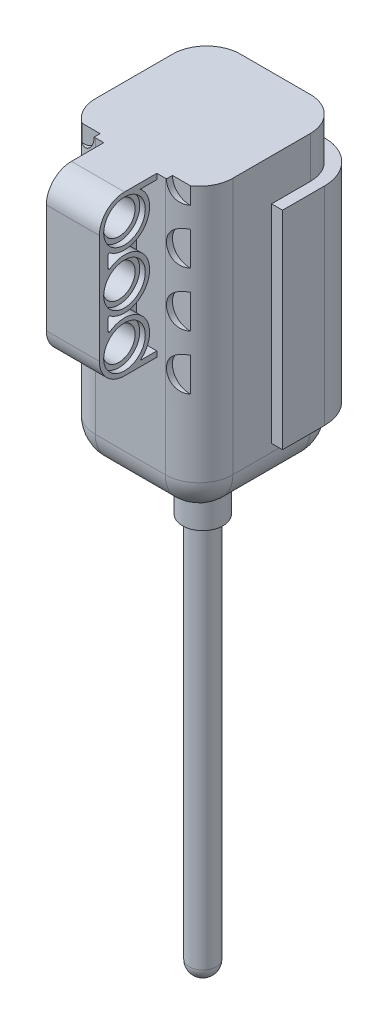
ISO-10303-21;
HEADER;
FILE_DESCRIPTION(('STEP AP214'),'2;1');
FILE_NAME('part.step','',(''),(''),'','','');
FILE_SCHEMA(('AUTOMOTIVE_DESIGN { 1 0 10303 214 1 1 1 1 }'));
ENDSEC;
DATA;
#1=APPLICATION_CONTEXT('core data for automotive mechanical design processes');
#2=APPLICATION_PROTOCOL_DEFINITION('international standard','automotive_design',2000,#1);
#3=PRODUCT_CONTEXT('',#1,'mechanical');
#4=PRODUCT('Part','Part','',(#3));
#5=PRODUCT_RELATED_PRODUCT_CATEGORY('part','',(#4));
#6=PRODUCT_DEFINITION_FORMATION('','',#4);
#7=PRODUCT_DEFINITION_CONTEXT('part definition',#1,'design');
#8=PRODUCT_DEFINITION('design','',#6,#7);
#9=PRODUCT_DEFINITION_SHAPE('','',#8);
#10=(LENGTH_UNIT() NAMED_UNIT(*) SI_UNIT(.MILLI.,.METRE.));
#11=(NAMED_UNIT(*) PLANE_ANGLE_UNIT() SI_UNIT($,.RADIAN.));
#12=(NAMED_UNIT(*) SI_UNIT($,.STERADIAN.) SOLID_ANGLE_UNIT());
#13=UNCERTAINTY_MEASURE_WITH_UNIT(LENGTH_MEASURE(1.E-05),#10,'distance_accuracy_value','');
#14=(GEOMETRIC_REPRESENTATION_CONTEXT(3) GLOBAL_UNCERTAINTY_ASSIGNED_CONTEXT((#13)) GLOBAL_UNIT_ASSIGNED_CONTEXT((#10,
#11,#12)) REPRESENTATION_CONTEXT('',''));
#15=CARTESIAN_POINT('',(0.,0.,0.));
#16=DIRECTION('',(0.,0.,1.));
#17=DIRECTION('',(1.,0.,0.));
#18=AXIS2_PLACEMENT_3D('',#15,#16,#17);
#19=CARTESIAN_POINT('',(-1.,-37.0846077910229,5.50999092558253));
#20=DIRECTION('',(-2.05131051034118E-13,0.,-1.));
#21=DIRECTION('',(-1.,0.,2.05131051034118E-13));
#22=AXIS2_PLACEMENT_3D('',#19,#20,#21);
#23=PLANE('',#22);
#24=DIRECTION('',(-1.,0.,0.));
#25=VECTOR('',#24,1.);
#26=CARTESIAN_POINT('',(5.17999999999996,-21.4951572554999,5.50999092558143));
#27=LINE('',#26,#25);
#28=CARTESIAN_POINT('',(1.00000000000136,-21.4951572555,5.50999092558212));
#29=VERTEX_POINT('',#28);
#30=CARTESIAN_POINT('',(-1.,-21.4951572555,5.50999092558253));
#31=VERTEX_POINT('',#30);
#32=EDGE_CURVE('E506',#29,#31,#27,.T.);
#33=ORIENTED_EDGE('',*,*,#32,.T.);
#34=DIRECTION('',(0.,1.,0.));
#35=VECTOR('',#34,1.);
#36=CARTESIAN_POINT('',(-1.,-37.0846077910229,5.50999092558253));
#37=LINE('',#36,#35);
#38=CARTESIAN_POINT('',(-1.,-21.5,5.50999092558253));
#39=VERTEX_POINT('',#38);
#40=EDGE_CURVE('E907',#39,#31,#37,.T.);
#41=ORIENTED_EDGE('',*,*,#40,.F.);
#42=DIRECTION('',(1.,0.,-2.05131051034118E-13));
#43=VECTOR('',#42,1.);
#44=CARTESIAN_POINT('',(-1.,-21.5,5.50999092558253));
#45=LINE('',#44,#43);
#46=CARTESIAN_POINT('',(1.00000000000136,-21.5,5.50999092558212));
#47=VERTEX_POINT('',#46);
#48=EDGE_CURVE('E1089',#39,#47,#45,.T.);
#49=ORIENTED_EDGE('',*,*,#48,.T.);
#50=DIRECTION('',(0.,1.,0.));
#51=VECTOR('',#50,1.);
#52=CARTESIAN_POINT('',(1.00000000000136,-37.0846077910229,5.50999092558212));
#53=LINE('',#52,#51);
#54=EDGE_CURVE('E58',#47,#29,#53,.T.);
#55=ORIENTED_EDGE('',*,*,#54,.T.);
#56=EDGE_LOOP('',(#33,#41,#49,#55));
#57=FACE_BOUND('',#56,.T.);
#58=ADVANCED_FACE('F35',(#57),#23,.F.);
#59=CARTESIAN_POINT('',(0.,-37.0846077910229,0.));
#60=DIRECTION('',(0.,1.,0.));
#61=DIRECTION('',(0.,0.,1.));
#62=AXIS2_PLACEMENT_3D('',#59,#60,#61);
#63=CYLINDRICAL_SURFACE('',#62,5.6);
#64=CARTESIAN_POINT('',(5.50999092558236,-21.4890987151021,1.00000000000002));
#65=CARTESIAN_POINT('',(5.49245040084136,-21.4902518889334,1.09666081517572));
#66=CARTESIAN_POINT('',(5.47236212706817,-21.4914946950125,1.19285783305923));
#67=CARTESIAN_POINT('',(5.42721768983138,-21.4939373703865,1.38379890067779));
#68=CARTESIAN_POINT('',(5.40217540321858,-21.495137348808,1.47854623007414));
#69=CARTESIAN_POINT('',(5.34715279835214,-21.4972809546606,1.6665997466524));
#70=CARTESIAN_POINT('',(5.31717246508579,-21.4982245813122,1.75990592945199));
#71=CARTESIAN_POINT('',(5.2522693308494,-21.4995818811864,1.94507723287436));
#72=CARTESIAN_POINT('',(5.21733306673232,-21.4999940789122,2.03693764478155));
#73=CARTESIAN_POINT('',(5.18000000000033,-21.5,2.12781578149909));
#74=B_SPLINE_CURVE_WITH_KNOTS('',3,(#64,#65,#66,#67,#68,#69,#70,#71,#72,#73),.UNSPECIFIED.,.F.,
.F.,(4,2,2,2,4),(0.,0.294703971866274,0.588593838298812,0.88248459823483,1.17718959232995),.UNSPECIFIED.);
#75=CARTESIAN_POINT('',(5.50999092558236,-21.489098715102,1.00000000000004));
#76=VERTEX_POINT('',#75);
#77=CARTESIAN_POINT('',(5.17999999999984,-21.5,2.12781578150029));
#78=VERTEX_POINT('',#77);
#79=EDGE_CURVE('E50',#76,#78,#74,.T.);
#80=ORIENTED_EDGE('',*,*,#79,.T.);
#81=CARTESIAN_POINT('',(0.,-21.5,0.));
#82=DIRECTION('',(0.,1.,0.));
#83=DIRECTION('',(0.,0.,1.));
#84=AXIS2_PLACEMENT_3D('',#81,#82,#83);
#85=CIRCLE('',#84,5.6);
#86=CARTESIAN_POINT('',(5.50999092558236,-21.5,1.00000000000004));
#87=VERTEX_POINT('',#86);
#88=EDGE_CURVE('E1091',#78,#87,#85,.T.);
#89=ORIENTED_EDGE('',*,*,#88,.T.);
#90=DIRECTION('',(0.,1.,0.));
#91=VECTOR('',#90,1.);
#92=CARTESIAN_POINT('',(5.50999092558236,-37.0846077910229,1.00000000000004));
#93=LINE('',#92,#91);
#94=EDGE_CURVE('E1106',#87,#76,#93,.T.);
#95=ORIENTED_EDGE('',*,*,#94,.T.);
#96=EDGE_LOOP('',(#80,#89,#95));
#97=FACE_BOUND('',#96,.T.);
#98=ADVANCED_FACE('F1025',(#97),#63,.T.);
#99=CARTESIAN_POINT('',(5.50999092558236,-37.0846077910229,1.00000000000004));
#100=DIRECTION('',(-1.,0.,-1.04950770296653E-13));
#101=DIRECTION('',(-1.04950770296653E-13,0.,1.));
#102=AXIS2_PLACEMENT_3D('',#99,#100,#101);
#103=PLANE('',#102);
#104=DIRECTION('',(0.,0.,1.));
#105=VECTOR('',#104,1.);
#106=CARTESIAN_POINT('',(5.50999092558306,-21.489098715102,-5.72999999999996));
#107=LINE('',#106,#105);
#108=CARTESIAN_POINT('',(5.50999092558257,-21.4890987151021,-0.999999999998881));
#109=VERTEX_POINT('',#108);
#110=EDGE_CURVE('E1487',#109,#76,#107,.T.);
#111=ORIENTED_EDGE('',*,*,#110,.T.);
#112=ORIENTED_EDGE('',*,*,#94,.F.);
#113=DIRECTION('',(1.04950770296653E-13,0.,-1.));
#114=VECTOR('',#113,1.);
#115=CARTESIAN_POINT('',(5.50999092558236,-21.5,1.00000000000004));
#116=LINE('',#115,#114);
#117=CARTESIAN_POINT('',(5.50999092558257,-21.5,-0.999999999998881));
#118=VERTEX_POINT('',#117);
#119=EDGE_CURVE('E1121',#87,#118,#116,.T.);
#120=ORIENTED_EDGE('',*,*,#119,.T.);
#121=DIRECTION('',(0.,1.,0.));
#122=VECTOR('',#121,1.);
#123=CARTESIAN_POINT('',(5.50999092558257,-37.0846077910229,-0.999999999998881));
#124=LINE('',#123,#122);
#125=EDGE_CURVE('E1103',#118,#109,#124,.T.);
#126=ORIENTED_EDGE('',*,*,#125,.T.);
#127=EDGE_LOOP('',(#111,#112,#120,#126));
#128=FACE_BOUND('',#127,.T.);
#129=ADVANCED_FACE('F1031',(#128),#103,.F.);
#130=CARTESIAN_POINT('',(0.,-37.0846077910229,0.));
#131=DIRECTION('',(0.,1.,0.));
#132=DIRECTION('',(0.,0.,1.));
#133=AXIS2_PLACEMENT_3D('',#130,#131,#132);
#134=CYLINDRICAL_SURFACE('',#133,5.60000000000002);
#135=CARTESIAN_POINT('',(5.17999999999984,-21.5,-2.12781578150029));
#136=CARTESIAN_POINT('',(5.2173330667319,-21.4999940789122,-2.03693764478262));
#137=CARTESIAN_POINT('',(5.25226933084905,-21.4995818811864,-1.9450772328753));
#138=CARTESIAN_POINT('',(5.31717246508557,-21.4982245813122,-1.75990592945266));
#139=CARTESIAN_POINT('',(5.34715279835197,-21.4972809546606,-1.66659974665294));
#140=CARTESIAN_POINT('',(5.40217540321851,-21.495137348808,-1.4785462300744));
#141=CARTESIAN_POINT('',(5.42721768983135,-21.4939373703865,-1.38379890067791));
#142=CARTESIAN_POINT('',(5.47236212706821,-21.4914946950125,-1.19285783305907));
#143=CARTESIAN_POINT('',(5.49245040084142,-21.4902518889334,-1.09666081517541));
#144=CARTESIAN_POINT('',(5.50999092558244,-21.4890987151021,-0.999999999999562));
#145=B_SPLINE_CURVE_WITH_KNOTS('',3,(#135,#136,#137,#138,#139,#140,#141,#142,#143,#144),
.UNSPECIFIED.,.F.,.F.,(4,2,2,2,4),(0.,0.294704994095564,0.588595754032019,0.882485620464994,
1.17718959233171),.UNSPECIFIED.);
#146=CARTESIAN_POINT('',(5.18,-21.5,-2.12781578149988));
#147=VERTEX_POINT('',#146);
#148=EDGE_CURVE('E866',#147,#109,#145,.T.);
#149=ORIENTED_EDGE('',*,*,#148,.T.);
#150=ORIENTED_EDGE('',*,*,#125,.F.);
#151=CARTESIAN_POINT('',(0.,-21.5,0.));
#152=DIRECTION('',(0.,1.,0.));
#153=DIRECTION('',(0.,0.,1.));
#154=AXIS2_PLACEMENT_3D('',#151,#152,#153);
#155=CIRCLE('',#154,5.60000000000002);
#156=EDGE_CURVE('E1119',#118,#147,#155,.T.);
#157=ORIENTED_EDGE('',*,*,#156,.T.);
#158=EDGE_LOOP('',(#149,#150,#157));
#159=FACE_BOUND('',#158,.T.);
#160=ADVANCED_FACE('F1038',(#159),#134,.T.);
#161=CARTESIAN_POINT('',(-1.,-37.0846077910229,-5.50999092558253));
#162=DIRECTION('',(0.,0.,1.));
#163=DIRECTION('',(1.,0.,0.));
#164=AXIS2_PLACEMENT_3D('',#161,#162,#163);
#165=PLANE('',#164);
#166=DIRECTION('',(1.,0.,0.));
#167=VECTOR('',#166,1.);
#168=CARTESIAN_POINT('',(-5.18000000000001,-21.4951572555,-5.50999092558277));
#169=LINE('',#168,#167);
#170=CARTESIAN_POINT('',(-1.,-21.4951572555,-5.50999092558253));
#171=VERTEX_POINT('',#170);
#172=CARTESIAN_POINT('',(0.999999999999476,-21.4951572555,-5.50999092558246));
#173=VERTEX_POINT('',#172);
#174=EDGE_CURVE('E1492',#171,#173,#169,.T.);
#175=ORIENTED_EDGE('',*,*,#174,.T.);
#176=DIRECTION('',(0.,1.,0.));
#177=VECTOR('',#176,1.);
#178=CARTESIAN_POINT('',(0.999999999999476,-37.0846077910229,-5.50999092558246));
#179=LINE('',#178,#177);
#180=CARTESIAN_POINT('',(0.999999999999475,-21.5,-5.50999092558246));
#181=VERTEX_POINT('',#180);
#182=EDGE_CURVE('E1100',#181,#173,#179,.T.);
#183=ORIENTED_EDGE('',*,*,#182,.F.);
#184=DIRECTION('',(-1.,0.,0.));
#185=VECTOR('',#184,1.);
#186=CARTESIAN_POINT('',(-1.,-21.5,-5.50999092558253));
#187=LINE('',#186,#185);
#188=CARTESIAN_POINT('',(-1.,-21.5,-5.50999092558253));
#189=VERTEX_POINT('',#188);
#190=EDGE_CURVE('E1117',#181,#189,#187,.T.);
#191=ORIENTED_EDGE('',*,*,#190,.T.);
#192=DIRECTION('',(0.,1.,0.));
#193=VECTOR('',#192,1.);
#194=CARTESIAN_POINT('',(-1.,-37.0846077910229,-5.50999092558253));
#195=LINE('',#194,#193);
#196=EDGE_CURVE('E1098',#189,#171,#195,.T.);
#197=ORIENTED_EDGE('',*,*,#196,.T.);
#198=EDGE_LOOP('',(#175,#183,#191,#197));
#199=FACE_BOUND('',#198,.T.);
#200=ADVANCED_FACE('F1042',(#199),#165,.F.);
#201=CARTESIAN_POINT('',(0.,-37.0846077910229,-1.38777878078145E-13));
#202=DIRECTION('',(0.,1.,0.));
#203=DIRECTION('',(0.,0.,1.));
#204=AXIS2_PLACEMENT_3D('',#201,#202,#203);
#205=CYLINDRICAL_SURFACE('',#204,5.60000000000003);
#206=CARTESIAN_POINT('',(-5.50999092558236,-21.4890987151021,-1.00000000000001));
#207=CARTESIAN_POINT('',(-5.49245040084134,-21.4902518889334,-1.09666081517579));
#208=CARTESIAN_POINT('',(-5.47236212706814,-21.4914946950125,-1.19285783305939));
#209=CARTESIAN_POINT('',(-5.4272176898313,-21.4939373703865,-1.3837989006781));
#210=CARTESIAN_POINT('',(-5.40217540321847,-21.495137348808,-1.47854623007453));
#211=CARTESIAN_POINT('',(-5.34715279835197,-21.4972809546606,-1.66659974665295));
#212=CARTESIAN_POINT('',(-5.31717246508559,-21.4982245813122,-1.75990592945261));
#213=CARTESIAN_POINT('',(-5.25226933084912,-21.4995818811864,-1.94507723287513));
#214=CARTESIAN_POINT('',(-5.21733306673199,-21.4999940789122,-2.0369376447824));
#215=CARTESIAN_POINT('',(-5.17999999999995,-21.5,-2.12781578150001));
#216=B_SPLINE_CURVE_WITH_KNOTS('',3,(#206,#207,#208,#209,#210,#211,#212,#213,#214,#215),
.UNSPECIFIED.,.F.,.F.,(4,2,2,2,4),(0.,0.294703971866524,0.588593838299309,0.882484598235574,
1.17718959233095),.UNSPECIFIED.);
#217=CARTESIAN_POINT('',(-5.50999092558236,-21.4890987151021,-1.00000000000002));
#218=VERTEX_POINT('',#217);
#219=CARTESIAN_POINT('',(-5.18,-21.5,-2.12781578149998));
#220=VERTEX_POINT('',#219);
#221=EDGE_CURVE('E524',#218,#220,#216,.T.);
#222=ORIENTED_EDGE('',*,*,#221,.T.);
#223=CARTESIAN_POINT('',(0.,-21.5,-1.38777878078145E-13));
#224=DIRECTION('',(0.,1.,0.));
#225=DIRECTION('',(0.,0.,1.));
#226=AXIS2_PLACEMENT_3D('',#223,#224,#225);
#227=CIRCLE('',#226,5.60000000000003);
#228=CARTESIAN_POINT('',(-5.50999092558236,-21.5,-1.00000000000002));
#229=VERTEX_POINT('',#228);
#230=EDGE_CURVE('E1115',#220,#229,#227,.T.);
#231=ORIENTED_EDGE('',*,*,#230,.T.);
#232=DIRECTION('',(0.,1.,0.));
#233=VECTOR('',#232,1.);
#234=CARTESIAN_POINT('',(-5.50999092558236,-37.0846077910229,-1.00000000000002));
#235=LINE('',#234,#233);
#236=EDGE_CURVE('E1095',#229,#218,#235,.T.);
#237=ORIENTED_EDGE('',*,*,#236,.T.);
#238=EDGE_LOOP('',(#222,#231,#237));
#239=FACE_BOUND('',#238,.T.);
#240=ADVANCED_FACE('F1046',(#239),#205,.T.);
#241=CARTESIAN_POINT('',(-5.50999092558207,-37.0846077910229,1.00000000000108));
#242=DIRECTION('',(1.,0.,-1.4441572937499E-13));
#243=DIRECTION('',(-1.4441572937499E-13,0.,-1.));
#244=AXIS2_PLACEMENT_3D('',#241,#242,#243);
#245=PLANE('',#244);
#246=DIRECTION('',(0.,0.,-1.));
#247=VECTOR('',#246,1.);
#248=CARTESIAN_POINT('',(-5.50999092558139,-21.4890987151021,5.73000000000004));
#249=LINE('',#248,#247);
#250=CARTESIAN_POINT('',(-5.50999092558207,-21.4890987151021,1.00000000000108));
#251=VERTEX_POINT('',#250);
#252=EDGE_CURVE('E1491',#251,#218,#249,.T.);
#253=ORIENTED_EDGE('',*,*,#252,.T.);
#254=ORIENTED_EDGE('',*,*,#236,.F.);
#255=DIRECTION('',(1.4441572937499E-13,0.,1.));
#256=VECTOR('',#255,1.);
#257=CARTESIAN_POINT('',(-5.50999092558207,-21.5,1.00000000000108));
#258=LINE('',#257,#256);
#259=CARTESIAN_POINT('',(-5.50999092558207,-21.5,1.00000000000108));
#260=VERTEX_POINT('',#259);
#261=EDGE_CURVE('E1112',#229,#260,#258,.T.);
#262=ORIENTED_EDGE('',*,*,#261,.T.);
#263=DIRECTION('',(0.,1.,0.));
#264=VECTOR('',#263,1.);
#265=CARTESIAN_POINT('',(-5.50999092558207,-37.0846077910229,1.00000000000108));
#266=LINE('',#265,#264);
#267=EDGE_CURVE('E1092',#260,#251,#266,.T.);
#268=ORIENTED_EDGE('',*,*,#267,.T.);
#269=EDGE_LOOP('',(#253,#254,#262,#268));
#270=FACE_BOUND('',#269,.T.);
#271=ADVANCED_FACE('F1050',(#270),#245,.F.);
#272=CARTESIAN_POINT('',(1.30104260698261E-13,-37.0846077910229,1.85181731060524E-13));
#273=DIRECTION('',(0.,1.,0.));
#274=DIRECTION('',(0.,0.,1.));
#275=AXIS2_PLACEMENT_3D('',#272,#273,#274);
#276=CYLINDRICAL_SURFACE('',#275,5.6);
#277=CARTESIAN_POINT('',(-5.17999999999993,-21.5,2.12781578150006));
#278=CARTESIAN_POINT('',(-5.21733306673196,-21.4999940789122,2.03693764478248));
#279=CARTESIAN_POINT('',(-5.25226933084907,-21.4995818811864,1.94507723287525));
#280=CARTESIAN_POINT('',(-5.31717246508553,-21.4982245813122,1.75990592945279));
#281=CARTESIAN_POINT('',(-5.3471527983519,-21.4972809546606,1.66659974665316));
#282=CARTESIAN_POINT('',(-5.4021754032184,-21.495137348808,1.4785462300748));
#283=CARTESIAN_POINT('',(-5.42721768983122,-21.4939373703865,1.3837989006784));
#284=CARTESIAN_POINT('',(-5.47236212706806,-21.4914946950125,1.19285783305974));
#285=CARTESIAN_POINT('',(-5.49245040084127,-21.4902518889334,1.09666081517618));
#286=CARTESIAN_POINT('',(-5.50999092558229,-21.4890987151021,1.00000000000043));
#287=B_SPLINE_CURVE_WITH_KNOTS('',3,(#277,#278,#279,#280,#281,#282,#283,#284,#285,#286),
.UNSPECIFIED.,.F.,.F.,(4,2,2,2,4),(0.,0.294704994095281,0.588595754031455,0.882485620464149,
1.17718959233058),.UNSPECIFIED.);
#288=CARTESIAN_POINT('',(-5.17999999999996,-21.4999999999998,2.12781578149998));
#289=VERTEX_POINT('',#288);
#290=EDGE_CURVE('E528',#289,#251,#287,.T.);
#291=ORIENTED_EDGE('',*,*,#290,.T.);
#292=ORIENTED_EDGE('',*,*,#267,.F.);
#293=CARTESIAN_POINT('',(1.30104260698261E-13,-21.5,1.85181731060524E-13));
#294=DIRECTION('',(0.,1.,0.));
#295=DIRECTION('',(0.,0.,1.));
#296=AXIS2_PLACEMENT_3D('',#293,#294,#295);
#297=CIRCLE('',#296,5.6);
#298=EDGE_CURVE('E1086',#260,#289,#297,.T.);
#299=ORIENTED_EDGE('',*,*,#298,.T.);
#300=EDGE_LOOP('',(#291,#292,#299));
#301=FACE_BOUND('',#300,.T.);
#302=ADVANCED_FACE('F1054',(#301),#276,.T.);
#303=CARTESIAN_POINT('',(0.,-86.5,0.));
#304=DIRECTION('',(0.,1.,0.));
#305=DIRECTION('',(0.,0.,1.));
#306=AXIS2_PLACEMENT_3D('',#303,#304,#305);
#307=CYLINDRICAL_SURFACE('',#306,2.);
#308=CARTESIAN_POINT('',(0.,-29.5,0.));
#309=DIRECTION('',(0.,-1.,0.));
#310=DIRECTION('',(0.,0.,-1.));
#311=AXIS2_PLACEMENT_3D('',#308,#309,#310);
#312=CIRCLE('',#311,2.);
#313=CARTESIAN_POINT('',(0.,-29.5,-2.));
#314=VERTEX_POINT('',#313);
#315=EDGE_CURVE('E39',#314,#314,#312,.T.);
#316=ORIENTED_EDGE('',*,*,#315,.T.);
#317=EDGE_LOOP('',(#316));
#318=FACE_BOUND('',#317,.T.);
#319=CARTESIAN_POINT('',(0.,-86.5,0.));
#320=DIRECTION('',(0.,-1.,0.));
#321=DIRECTION('',(0.,0.,-1.));
#322=AXIS2_PLACEMENT_3D('',#319,#320,#321);
#323=CIRCLE('',#322,2.);
#324=CARTESIAN_POINT('',(0.,-86.5,-2.));
#325=VERTEX_POINT('',#324);
#326=EDGE_CURVE('E11',#325,#325,#323,.T.);
#327=ORIENTED_EDGE('',*,*,#326,.F.);
#328=EDGE_LOOP('',(#327));
#329=FACE_BOUND('',#328,.T.);
#330=ADVANCED_FACE('F37',(#318,#329),#307,.T.);
#331=CARTESIAN_POINT('',(0.,-86.5,0.));
#332=DIRECTION('',(0.,0.,1.));
#333=DIRECTION('',(-1.,0.,0.));
#334=AXIS2_PLACEMENT_3D('',#331,#332,#333);
#335=SPHERICAL_SURFACE('',#334,2.);
#336=CARTESIAN_POINT('',(0.,-86.5,0.));
#337=DIRECTION('',(0.,-1.,0.));
#338=DIRECTION('',(0.,0.,-1.));
#339=AXIS2_PLACEMENT_3D('',#336,#337,#338);
#340=SPHERICAL_SURFACE('',#339,2.);
#341=ORIENTED_EDGE('',*,*,#326,.T.);
#342=EDGE_LOOP('',(#341));
#343=FACE_BOUND('',#342,.T.);
#344=ADVANCED_FACE('F1063',(#343),#340,.T.);
#345=CARTESIAN_POINT('',(0.,-29.5,0.));
#346=DIRECTION('',(0.,-1.,0.));
#347=DIRECTION('',(0.,0.,-1.));
#348=AXIS2_PLACEMENT_3D('',#345,#346,#347);
#349=PLANE('',#348);
#350=CARTESIAN_POINT('',(0.,-29.5,0.));
#351=DIRECTION('',(0.,-1.,0.));
#352=DIRECTION('',(0.,0.,-1.));
#353=AXIS2_PLACEMENT_3D('',#350,#351,#352);
#354=CIRCLE('',#353,3.);
#355=CARTESIAN_POINT('',(0.,-29.5,-3.));
#356=VERTEX_POINT('',#355);
#357=EDGE_CURVE('E1080',#356,#356,#354,.T.);
#358=ORIENTED_EDGE('',*,*,#357,.T.);
#359=EDGE_LOOP('',(#358));
#360=FACE_BOUND('',#359,.T.);
#361=ORIENTED_EDGE('',*,*,#315,.F.);
#362=EDGE_LOOP('',(#361));
#363=FACE_BOUND('',#362,.T.);
#364=ADVANCED_FACE('F1059',(#360,#363),#349,.T.);
#365=CARTESIAN_POINT('',(0.,-29.5,0.));
#366=DIRECTION('',(0.,1.,0.));
#367=DIRECTION('',(0.,0.,1.));
#368=AXIS2_PLACEMENT_3D('',#365,#366,#367);
#369=CYLINDRICAL_SURFACE('',#368,3.);
#370=ORIENTED_EDGE('',*,*,#357,.F.);
#371=EDGE_LOOP('',(#370));
#372=FACE_BOUND('',#371,.T.);
#373=CARTESIAN_POINT('',(0.,-21.5,0.));
#374=DIRECTION('',(0.,1.,0.));
#375=DIRECTION('',(0.,0.,1.));
#376=AXIS2_PLACEMENT_3D('',#373,#374,#375);
#377=CIRCLE('',#376,3.);
#378=CARTESIAN_POINT('',(0.,-21.5,3.));
#379=VERTEX_POINT('',#378);
#380=EDGE_CURVE('E1082',#379,#379,#377,.T.);
#381=ORIENTED_EDGE('',*,*,#380,.F.);
#382=EDGE_LOOP('',(#381));
#383=FACE_BOUND('',#382,.T.);
#384=ADVANCED_FACE('F1062',(#372,#383),#369,.T.);
#385=CARTESIAN_POINT('',(-5.3872,-21.5,5.9592));
#386=DIRECTION('',(0.,1.,0.));
#387=DIRECTION('',(1.,0.,0.));
#388=AXIS2_PLACEMENT_3D('',#385,#386,#387);
#389=PLANE('',#388);
#390=ORIENTED_EDGE('',*,*,#261,.F.);
#391=ORIENTED_EDGE('',*,*,#230,.F.);
#392=DIRECTION('',(0.,0.,1.));
#393=VECTOR('',#392,1.);
#394=CARTESIAN_POINT('',(-5.18,-21.5,0.));
#395=LINE('',#394,#393);
#396=CARTESIAN_POINT('',(-5.18,-21.5,-5.72999999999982));
#397=VERTEX_POINT('',#396);
#398=EDGE_CURVE('E893',#397,#220,#395,.T.);
#399=ORIENTED_EDGE('',*,*,#398,.F.);
#400=DIRECTION('',(1.,0.,0.));
#401=VECTOR('',#400,1.);
#402=CARTESIAN_POINT('',(0.,-21.5,-5.73));
#403=LINE('',#402,#401);
#404=CARTESIAN_POINT('',(-1.00000000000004,-21.5,-5.73));
#405=VERTEX_POINT('',#404);
#406=EDGE_CURVE('E904',#397,#405,#403,.T.);
#407=ORIENTED_EDGE('',*,*,#406,.T.);
#408=DIRECTION('',(0.,0.,1.));
#409=VECTOR('',#408,1.);
#410=CARTESIAN_POINT('',(-1.,-21.5,-6.5900000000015));
#411=LINE('',#410,#409);
#412=EDGE_CURVE('E896',#405,#189,#411,.T.);
#413=ORIENTED_EDGE('',*,*,#412,.T.);
#414=ORIENTED_EDGE('',*,*,#190,.F.);
#415=DIRECTION('',(0.,0.,-1.));
#416=VECTOR('',#415,1.);
#417=CARTESIAN_POINT('',(1.,-21.5,-6.5900000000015));
#418=LINE('',#417,#416);
#419=CARTESIAN_POINT('',(1.00000000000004,-21.5,-5.73));
#420=VERTEX_POINT('',#419);
#421=EDGE_CURVE('E921',#181,#420,#418,.T.);
#422=ORIENTED_EDGE('',*,*,#421,.T.);
#423=DIRECTION('',(-1.,0.,0.));
#424=VECTOR('',#423,1.);
#425=CARTESIAN_POINT('',(0.,-21.5,-5.73));
#426=LINE('',#425,#424);
#427=CARTESIAN_POINT('',(5.17999999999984,-21.5,-5.73));
#428=VERTEX_POINT('',#427);
#429=EDGE_CURVE('E903',#428,#420,#426,.T.);
#430=ORIENTED_EDGE('',*,*,#429,.F.);
#431=DIRECTION('',(0.,0.,-1.));
#432=VECTOR('',#431,1.);
#433=CARTESIAN_POINT('',(5.18,-21.5,0.));
#434=LINE('',#433,#432);
#435=EDGE_CURVE('E900',#147,#428,#434,.T.);
#436=ORIENTED_EDGE('',*,*,#435,.F.);
#437=ORIENTED_EDGE('',*,*,#156,.F.);
#438=ORIENTED_EDGE('',*,*,#119,.F.);
#439=ORIENTED_EDGE('',*,*,#88,.F.);
#440=DIRECTION('',(0.,0.,1.));
#441=VECTOR('',#440,1.);
#442=CARTESIAN_POINT('',(5.18,-21.5,0.));
#443=LINE('',#442,#441);
#444=CARTESIAN_POINT('',(5.18,-21.5,5.72999999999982));
#445=VERTEX_POINT('',#444);
#446=EDGE_CURVE('E522',#78,#445,#443,.T.);
#447=ORIENTED_EDGE('',*,*,#446,.T.);
#448=DIRECTION('',(1.,0.,0.));
#449=VECTOR('',#448,1.);
#450=CARTESIAN_POINT('',(0.,-21.5,5.73));
#451=LINE('',#450,#449);
#452=CARTESIAN_POINT('',(1.00000000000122,-21.5,5.73));
#453=VERTEX_POINT('',#452);
#454=EDGE_CURVE('E503',#453,#445,#451,.T.);
#455=ORIENTED_EDGE('',*,*,#454,.F.);
#456=DIRECTION('',(0.,0.,1.));
#457=VECTOR('',#456,1.);
#458=CARTESIAN_POINT('',(1.,-21.5,6.5900000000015));
#459=LINE('',#458,#457);
#460=EDGE_CURVE('E511',#47,#453,#459,.T.);
#461=ORIENTED_EDGE('',*,*,#460,.F.);
#462=ORIENTED_EDGE('',*,*,#48,.F.);
#463=DIRECTION('',(0.,0.,-1.));
#464=VECTOR('',#463,1.);
#465=CARTESIAN_POINT('',(-1.,-21.5,6.5900000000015));
#466=LINE('',#465,#464);
#467=CARTESIAN_POINT('',(-1.,-21.5,5.73));
#468=VERTEX_POINT('',#467);
#469=EDGE_CURVE('E514',#468,#39,#466,.T.);
#470=ORIENTED_EDGE('',*,*,#469,.F.);
#471=DIRECTION('',(-1.,0.,0.));
#472=VECTOR('',#471,1.);
#473=CARTESIAN_POINT('',(0.,-21.5,5.73));
#474=LINE('',#473,#472);
#475=CARTESIAN_POINT('',(-5.17999999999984,-21.5,5.73));
#476=VERTEX_POINT('',#475);
#477=EDGE_CURVE('E678',#468,#476,#474,.T.);
#478=ORIENTED_EDGE('',*,*,#477,.T.);
#479=DIRECTION('',(0.,0.,-1.));
#480=VECTOR('',#479,1.);
#481=CARTESIAN_POINT('',(-5.18,-21.5,0.));
#482=LINE('',#481,#480);
#483=EDGE_CURVE('E592',#476,#289,#482,.T.);
#484=ORIENTED_EDGE('',*,*,#483,.T.);
#485=ORIENTED_EDGE('',*,*,#298,.F.);
#486=EDGE_LOOP('',(#390,#391,#399,#407,#413,#414,#422,#430,#436,#437,#438,#439,#447,#455,#461,
#462,#470,#478,#484,#485));
#487=FACE_BOUND('',#486,.T.);
#488=ORIENTED_EDGE('',*,*,#380,.T.);
#489=EDGE_LOOP('',(#488));
#490=FACE_BOUND('',#489,.T.);
#491=ADVANCED_FACE('F519',(#487,#490),#389,.F.);
#492=CARTESIAN_POINT('',(1.,-11.3,-7.742157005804));
#493=DIRECTION('',(1.,0.,0.));
#494=DIRECTION('',(0.,0.,1.));
#495=AXIS2_PLACEMENT_3D('',#492,#493,#494);
#496=PLANE('',#495);
#497=CARTESIAN_POINT('',(0.999999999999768,-16.5,-5.73));
#498=DIRECTION('',(-1.,0.,-1.39037721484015E-13));
#499=DIRECTION('',(-1.39037721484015E-13,0.,1.));
#500=AXIS2_PLACEMENT_3D('',#497,#498,#499);
#501=CIRCLE('',#500,5.);
#502=EDGE_CURVE('E1498',#173,#420,#501,.F.);
#503=ORIENTED_EDGE('',*,*,#502,.T.);
#504=ORIENTED_EDGE('',*,*,#421,.F.);
#505=ORIENTED_EDGE('',*,*,#182,.T.);
#506=EDGE_LOOP('',(#503,#504,#505));
#507=FACE_BOUND('',#506,.T.);
#508=ADVANCED_FACE('F1649',(#507),#496,.F.);
#509=CARTESIAN_POINT('',(-1.,-11.3,-5.437842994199));
#510=DIRECTION('',(-1.,0.,0.));
#511=DIRECTION('',(0.,0.,-1.));
#512=AXIS2_PLACEMENT_3D('',#509,#510,#511);
#513=PLANE('',#512);
#514=CARTESIAN_POINT('',(-1.,-16.5,-5.73));
#515=DIRECTION('',(1.,0.,0.));
#516=DIRECTION('',(0.,0.,-1.));
#517=AXIS2_PLACEMENT_3D('',#514,#515,#516);
#518=CIRCLE('',#517,5.);
#519=EDGE_CURVE('E1495',#405,#171,#518,.F.);
#520=ORIENTED_EDGE('',*,*,#519,.T.);
#521=ORIENTED_EDGE('',*,*,#196,.F.);
#522=ORIENTED_EDGE('',*,*,#412,.F.);
#523=EDGE_LOOP('',(#520,#521,#522));
#524=FACE_BOUND('',#523,.T.);
#525=ADVANCED_FACE('F1636',(#524),#513,.F.);
#526=CARTESIAN_POINT('',(1.,-11.3,7.742157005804));
#527=DIRECTION('',(-1.,0.,0.));
#528=DIRECTION('',(0.,0.,-1.));
#529=AXIS2_PLACEMENT_3D('',#526,#527,#528);
#530=PLANE('',#529);
#531=ORIENTED_EDGE('',*,*,#460,.T.);
#532=CARTESIAN_POINT('',(1.00000000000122,-16.5,5.73));
#533=DIRECTION('',(-1.,0.,-6.27526929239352E-13));
#534=DIRECTION('',(-6.27526929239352E-13,0.,1.));
#535=AXIS2_PLACEMENT_3D('',#532,#533,#534);
#536=CIRCLE('',#535,5.);
#537=EDGE_CURVE('E497',#453,#29,#536,.F.);
#538=ORIENTED_EDGE('',*,*,#537,.T.);
#539=ORIENTED_EDGE('',*,*,#54,.F.);
#540=EDGE_LOOP('',(#531,#538,#539));
#541=FACE_BOUND('',#540,.T.);
#542=ADVANCED_FACE('F512',(#541),#530,.T.);
#543=CARTESIAN_POINT('',(-1.,-11.3,5.437842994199));
#544=DIRECTION('',(1.,0.,0.));
#545=DIRECTION('',(0.,0.,1.));
#546=AXIS2_PLACEMENT_3D('',#543,#544,#545);
#547=PLANE('',#546);
#548=ORIENTED_EDGE('',*,*,#40,.T.);
#549=CARTESIAN_POINT('',(-1.,-16.5,5.73));
#550=DIRECTION('',(1.,0.,0.));
#551=DIRECTION('',(0.,0.,-1.));
#552=AXIS2_PLACEMENT_3D('',#549,#550,#551);
#553=CIRCLE('',#552,5.);
#554=EDGE_CURVE('E508',#31,#468,#553,.F.);
#555=ORIENTED_EDGE('',*,*,#554,.T.);
#556=ORIENTED_EDGE('',*,*,#469,.T.);
#557=EDGE_LOOP('',(#548,#555,#556));
#558=FACE_BOUND('',#557,.T.);
#559=ADVANCED_FACE('F1635',(#558),#547,.T.);
#560=CARTESIAN_POINT('',(-0.8528520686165,14.60964793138,17.96982889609));
#561=DIRECTION('',(0.,0.,-1.));
#562=DIRECTION('',(0.,-1.,0.));
#563=AXIS2_PLACEMENT_3D('',#560,#561,#562);
#564=PLANE('',#563);
#565=DIRECTION('',(0.,-1.,0.));
#566=VECTOR('',#565,1.);
#567=CARTESIAN_POINT('',(-0.925000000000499,13.7475,17.96982889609));
#568=LINE('',#567,#566);
#569=CARTESIAN_POINT('',(-0.925000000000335,14.5375,17.96982889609));
#570=VERTEX_POINT('',#569);
#571=CARTESIAN_POINT('',(-0.925000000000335,12.9575,17.96982889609));
#572=VERTEX_POINT('',#571);
#573=EDGE_CURVE('E844',#570,#572,#568,.T.);
#574=ORIENTED_EDGE('',*,*,#573,.T.);
#575=DIRECTION('',(1.,0.,0.));
#576=VECTOR('',#575,1.);
#577=CARTESIAN_POINT('',(-2.42500000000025,12.9574999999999,17.96982889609));
#578=LINE('',#577,#576);
#579=CARTESIAN_POINT('',(-3.92500000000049,12.9575,17.96982889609));
#580=VERTEX_POINT('',#579);
#581=EDGE_CURVE('E845',#580,#572,#578,.T.);
#582=ORIENTED_EDGE('',*,*,#581,.F.);
#583=DIRECTION('',(0.,1.,0.));
#584=VECTOR('',#583,1.);
#585=CARTESIAN_POINT('',(-3.92500000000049,13.7475,17.96982889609));
#586=LINE('',#585,#584);
#587=CARTESIAN_POINT('',(-3.92500000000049,14.5375,17.96982889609));
#588=VERTEX_POINT('',#587);
#589=EDGE_CURVE('E851',#580,#588,#586,.T.);
#590=ORIENTED_EDGE('',*,*,#589,.T.);
#591=DIRECTION('',(-1.,0.,0.));
#592=VECTOR('',#591,1.);
#593=CARTESIAN_POINT('',(-2.42500000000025,14.5374999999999,17.96982889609));
#594=LINE('',#593,#592);
#595=EDGE_CURVE('E857',#570,#588,#594,.T.);
#596=ORIENTED_EDGE('',*,*,#595,.F.);
#597=EDGE_LOOP('',(#574,#582,#590,#596));
#598=FACE_BOUND('',#597,.T.);
#599=ADVANCED_FACE('F1639',(#598),#564,.T.);
#600=CARTESIAN_POINT('',(-0.8528520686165,6.544647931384,17.96982889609));
#601=DIRECTION('',(0.,0.,-1.));
#602=DIRECTION('',(0.,-1.,0.));
#603=AXIS2_PLACEMENT_3D('',#600,#601,#602);
#604=PLANE('',#603);
#605=DIRECTION('',(0.,-1.,0.));
#606=VECTOR('',#605,1.);
#607=CARTESIAN_POINT('',(-0.925000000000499,5.6825,17.96982889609));
#608=LINE('',#607,#606);
#609=CARTESIAN_POINT('',(-0.925000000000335,6.47249999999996,17.96982889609));
#610=VERTEX_POINT('',#609);
#611=CARTESIAN_POINT('',(-0.925000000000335,4.89249999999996,17.96982889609));
#612=VERTEX_POINT('',#611);
#613=EDGE_CURVE('E826',#610,#612,#608,.T.);
#614=ORIENTED_EDGE('',*,*,#613,.T.);
#615=DIRECTION('',(1.,0.,0.));
#616=VECTOR('',#615,1.);
#617=CARTESIAN_POINT('',(-2.42500000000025,4.89249999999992,17.96982889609));
#618=LINE('',#617,#616);
#619=CARTESIAN_POINT('',(-3.92500000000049,4.89249999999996,17.96982889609));
#620=VERTEX_POINT('',#619);
#621=EDGE_CURVE('E836',#620,#612,#618,.T.);
#622=ORIENTED_EDGE('',*,*,#621,.F.);
#623=DIRECTION('',(0.,1.,0.));
#624=VECTOR('',#623,1.);
#625=CARTESIAN_POINT('',(-3.92500000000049,5.6825,17.96982889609));
#626=LINE('',#625,#624);
#627=CARTESIAN_POINT('',(-3.92500000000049,6.47249999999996,17.96982889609));
#628=VERTEX_POINT('',#627);
#629=EDGE_CURVE('E842',#620,#628,#626,.T.);
#630=ORIENTED_EDGE('',*,*,#629,.T.);
#631=DIRECTION('',(-1.,0.,0.));
#632=VECTOR('',#631,1.);
#633=CARTESIAN_POINT('',(-2.42500000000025,6.47249999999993,17.96982889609));
#634=LINE('',#633,#632);
#635=EDGE_CURVE('E853',#610,#628,#634,.T.);
#636=ORIENTED_EDGE('',*,*,#635,.F.);
#637=EDGE_LOOP('',(#614,#622,#630,#636));
#638=FACE_BOUND('',#637,.T.);
#639=ADVANCED_FACE('F1690',(#638),#604,.T.);
#640=CARTESIAN_POINT('',(0.8528520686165,6.544647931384,17.96982889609));
#641=DIRECTION('',(0.,0.,1.));
#642=DIRECTION('',(0.,-1.,0.));
#643=AXIS2_PLACEMENT_3D('',#640,#641,#642);
#644=PLANE('',#643);
#645=DIRECTION('',(0.,-1.,0.));
#646=VECTOR('',#645,1.);
#647=CARTESIAN_POINT('',(0.925000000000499,5.6825,17.96982889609));
#648=LINE('',#647,#646);
#649=CARTESIAN_POINT('',(0.925000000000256,6.47249999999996,17.96982889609));
#650=VERTEX_POINT('',#649);
#651=CARTESIAN_POINT('',(0.925000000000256,4.89249999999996,17.96982889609));
#652=VERTEX_POINT('',#651);
#653=EDGE_CURVE('E815',#650,#652,#648,.T.);
#654=ORIENTED_EDGE('',*,*,#653,.F.);
#655=DIRECTION('',(-1.,0.,0.));
#656=VECTOR('',#655,1.);
#657=CARTESIAN_POINT('',(2.42500000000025,6.47249999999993,17.96982889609));
#658=LINE('',#657,#656);
#659=CARTESIAN_POINT('',(3.92500000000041,6.47249999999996,17.96982889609));
#660=VERTEX_POINT('',#659);
#661=EDGE_CURVE('E816',#660,#650,#658,.T.);
#662=ORIENTED_EDGE('',*,*,#661,.F.);
#663=DIRECTION('',(0.,1.,0.));
#664=VECTOR('',#663,1.);
#665=CARTESIAN_POINT('',(3.92500000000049,5.6825,17.96982889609));
#666=LINE('',#665,#664);
#667=CARTESIAN_POINT('',(3.92500000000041,4.89249999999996,17.96982889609));
#668=VERTEX_POINT('',#667);
#669=EDGE_CURVE('E823',#668,#660,#666,.T.);
#670=ORIENTED_EDGE('',*,*,#669,.F.);
#671=DIRECTION('',(1.,0.,0.));
#672=VECTOR('',#671,1.);
#673=CARTESIAN_POINT('',(2.42500000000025,4.89249999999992,17.96982889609));
#674=LINE('',#673,#672);
#675=EDGE_CURVE('E831',#652,#668,#674,.T.);
#676=ORIENTED_EDGE('',*,*,#675,.F.);
#677=EDGE_LOOP('',(#654,#662,#670,#676));
#678=FACE_BOUND('',#677,.T.);
#679=ADVANCED_FACE('F1699',(#678),#644,.F.);
#680=CARTESIAN_POINT('',(0.8528520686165,14.60964793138,17.96982889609));
#681=DIRECTION('',(0.,0.,1.));
#682=DIRECTION('',(0.,-1.,0.));
#683=AXIS2_PLACEMENT_3D('',#680,#681,#682);
#684=PLANE('',#683);
#685=DIRECTION('',(0.,-1.,0.));
#686=VECTOR('',#685,1.);
#687=CARTESIAN_POINT('',(0.925000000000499,13.7475,17.96982889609));
#688=LINE('',#687,#686);
#689=CARTESIAN_POINT('',(0.925000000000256,14.5375,17.96982889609));
#690=VERTEX_POINT('',#689);
#691=CARTESIAN_POINT('',(0.925000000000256,12.9575,17.96982889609));
#692=VERTEX_POINT('',#691);
#693=EDGE_CURVE('E808',#690,#692,#688,.T.);
#694=ORIENTED_EDGE('',*,*,#693,.F.);
#695=DIRECTION('',(-1.,0.,0.));
#696=VECTOR('',#695,1.);
#697=CARTESIAN_POINT('',(2.42500000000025,14.5374999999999,17.96982889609));
#698=LINE('',#697,#696);
#699=CARTESIAN_POINT('',(3.92500000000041,14.5375,17.96982889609));
#700=VERTEX_POINT('',#699);
#701=EDGE_CURVE('E803',#700,#690,#698,.T.);
#702=ORIENTED_EDGE('',*,*,#701,.F.);
#703=DIRECTION('',(0.,1.,0.));
#704=VECTOR('',#703,1.);
#705=CARTESIAN_POINT('',(3.92500000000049,13.7475,17.96982889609));
#706=LINE('',#705,#704);
#707=CARTESIAN_POINT('',(3.92500000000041,12.9575,17.96982889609));
#708=VERTEX_POINT('',#707);
#709=EDGE_CURVE('E812',#708,#700,#706,.T.);
#710=ORIENTED_EDGE('',*,*,#709,.F.);
#711=DIRECTION('',(1.,0.,0.));
#712=VECTOR('',#711,1.);
#713=CARTESIAN_POINT('',(2.42500000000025,12.9574999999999,17.96982889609));
#714=LINE('',#713,#712);
#715=EDGE_CURVE('E827',#692,#708,#714,.T.);
#716=ORIENTED_EDGE('',*,*,#715,.F.);
#717=EDGE_LOOP('',(#694,#702,#710,#716));
#718=FACE_BOUND('',#717,.T.);
#719=ADVANCED_FACE('F1708',(#718),#684,.F.);
#720=CARTESIAN_POINT('',(-3.10999999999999,1.65,15.51));
#721=DIRECTION('',(1.,0.,0.));
#722=DIRECTION('',(0.,0.,-1.));
#723=AXIS2_PLACEMENT_3D('',#720,#721,#722);
#724=CYLINDRICAL_SURFACE('',#723,2.39);
#725=CARTESIAN_POINT('',(-3.10999999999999,1.65,15.51));
#726=DIRECTION('',(1.,0.,0.));
#727=DIRECTION('',(0.,0.,-1.));
#728=AXIS2_PLACEMENT_3D('',#725,#726,#727);
#729=CIRCLE('',#728,2.39);
#730=CARTESIAN_POINT('',(-3.10999999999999,1.65,13.12));
#731=VERTEX_POINT('',#730);
#732=EDGE_CURVE('E1133',#731,#731,#729,.F.);
#733=ORIENTED_EDGE('',*,*,#732,.T.);
#734=EDGE_LOOP('',(#733));
#735=FACE_BOUND('',#734,.T.);
#736=CARTESIAN_POINT('',(3.1099999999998,1.65,15.51));
#737=DIRECTION('',(1.,0.,0.));
#738=DIRECTION('',(0.,0.,-1.));
#739=AXIS2_PLACEMENT_3D('',#736,#737,#738);
#740=CIRCLE('',#739,2.39);
#741=CARTESIAN_POINT('',(3.1099999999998,1.65,13.12));
#742=VERTEX_POINT('',#741);
#743=EDGE_CURVE('E1151',#742,#742,#740,.F.);
#744=ORIENTED_EDGE('',*,*,#743,.F.);
#745=EDGE_LOOP('',(#744));
#746=FACE_BOUND('',#745,.T.);
#747=ADVANCED_FACE('F1717',(#735,#746),#724,.F.);
#748=CARTESIAN_POINT('',(-3.10999999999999,9.715,15.51));
#749=DIRECTION('',(1.,0.,0.));
#750=DIRECTION('',(0.,0.,-1.));
#751=AXIS2_PLACEMENT_3D('',#748,#749,#750);
#752=CYLINDRICAL_SURFACE('',#751,2.39);
#753=CARTESIAN_POINT('',(-3.10999999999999,9.715,15.51));
#754=DIRECTION('',(1.,0.,0.));
#755=DIRECTION('',(0.,0.,-1.));
#756=AXIS2_PLACEMENT_3D('',#753,#754,#755);
#757=CIRCLE('',#756,2.39);
#758=CARTESIAN_POINT('',(-3.10999999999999,9.715,13.12));
#759=VERTEX_POINT('',#758);
#760=EDGE_CURVE('E1136',#759,#759,#757,.F.);
#761=ORIENTED_EDGE('',*,*,#760,.T.);
#762=EDGE_LOOP('',(#761));
#763=FACE_BOUND('',#762,.T.);
#764=CARTESIAN_POINT('',(3.1099999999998,9.715,15.51));
#765=DIRECTION('',(1.,0.,0.));
#766=DIRECTION('',(0.,0.,-1.));
#767=AXIS2_PLACEMENT_3D('',#764,#765,#766);
#768=CIRCLE('',#767,2.39);
#769=CARTESIAN_POINT('',(3.1099999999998,9.715,13.12));
#770=VERTEX_POINT('',#769);
#771=EDGE_CURVE('E1154',#770,#770,#768,.F.);
#772=ORIENTED_EDGE('',*,*,#771,.F.);
#773=EDGE_LOOP('',(#772));
#774=FACE_BOUND('',#773,.T.);
#775=ADVANCED_FACE('F1726',(#763,#774),#752,.F.);
#776=CARTESIAN_POINT('',(-3.10999999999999,17.78,15.51));
#777=DIRECTION('',(1.,0.,0.));
#778=DIRECTION('',(0.,0.,-1.));
#779=AXIS2_PLACEMENT_3D('',#776,#777,#778);
#780=CYLINDRICAL_SURFACE('',#779,2.39000000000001);
#781=CARTESIAN_POINT('',(-3.10999999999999,17.78,15.51));
#782=DIRECTION('',(1.,0.,0.));
#783=DIRECTION('',(0.,0.,-1.));
#784=AXIS2_PLACEMENT_3D('',#781,#782,#783);
#785=CIRCLE('',#784,2.39000000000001);
#786=CARTESIAN_POINT('',(-3.10999999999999,17.78,13.12));
#787=VERTEX_POINT('',#786);
#788=EDGE_CURVE('E1139',#787,#787,#785,.F.);
#789=ORIENTED_EDGE('',*,*,#788,.T.);
#790=EDGE_LOOP('',(#789));
#791=FACE_BOUND('',#790,.T.);
#792=CARTESIAN_POINT('',(3.1099999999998,17.78,15.51));
#793=DIRECTION('',(1.,0.,0.));
#794=DIRECTION('',(0.,0.,-1.));
#795=AXIS2_PLACEMENT_3D('',#792,#793,#794);
#796=CIRCLE('',#795,2.39000000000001);
#797=CARTESIAN_POINT('',(3.1099999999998,17.78,13.12));
#798=VERTEX_POINT('',#797);
#799=EDGE_CURVE('E801',#798,#798,#796,.F.);
#800=ORIENTED_EDGE('',*,*,#799,.F.);
#801=EDGE_LOOP('',(#800));
#802=FACE_BOUND('',#801,.T.);
#803=ADVANCED_FACE('F1735',(#791,#802),#780,.F.);
#804=CARTESIAN_POINT('',(-3.92500000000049,14.5375,17.71982889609));
#805=DIRECTION('',(1.,0.,0.));
#806=DIRECTION('',(0.,0.,-1.));
#807=AXIS2_PLACEMENT_3D('',#804,#805,#806);
#808=CYLINDRICAL_SURFACE('',#807,0.249999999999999);
#809=CARTESIAN_POINT('',(-0.92500000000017,14.5375,17.71982889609));
#810=DIRECTION('',(1.,0.,0.));
#811=DIRECTION('',(0.,0.,-1.));
#812=AXIS2_PLACEMENT_3D('',#809,#810,#811);
#813=CIRCLE('',#812,0.249999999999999);
#814=CARTESIAN_POINT('',(-0.92500000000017,14.7874999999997,17.7198288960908));
#815=VERTEX_POINT('',#814);
#816=EDGE_CURVE('E861',#815,#570,#813,.T.);
#817=ORIENTED_EDGE('',*,*,#816,.T.);
#818=ORIENTED_EDGE('',*,*,#595,.T.);
#819=CARTESIAN_POINT('',(-3.92500000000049,14.5375,17.71982889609));
#820=DIRECTION('',(1.,0.,0.));
#821=DIRECTION('',(0.,0.,-1.));
#822=AXIS2_PLACEMENT_3D('',#819,#820,#821);
#823=CIRCLE('',#822,0.249999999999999);
#824=CARTESIAN_POINT('',(-3.92500000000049,14.7874999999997,17.7198288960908));
#825=VERTEX_POINT('',#824);
#826=EDGE_CURVE('E811',#588,#825,#823,.F.);
#827=ORIENTED_EDGE('',*,*,#826,.T.);
#828=DIRECTION('',(1.,0.,0.));
#829=VECTOR('',#828,1.);
#830=CARTESIAN_POINT('',(-2.42500000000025,14.7874999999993,17.7198288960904));
#831=LINE('',#830,#829);
#832=EDGE_CURVE('E798',#825,#815,#831,.T.);
#833=ORIENTED_EDGE('',*,*,#832,.T.);
#834=EDGE_LOOP('',(#817,#818,#827,#833));
#835=FACE_BOUND('',#834,.T.);
#836=ADVANCED_FACE('F1744',(#835),#808,.F.);
#837=CARTESIAN_POINT('',(-3.92500000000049,6.4725,17.71982889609));
#838=DIRECTION('',(1.,0.,0.));
#839=DIRECTION('',(0.,0.,-1.));
#840=AXIS2_PLACEMENT_3D('',#837,#838,#839);
#841=CYLINDRICAL_SURFACE('',#840,0.250000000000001);
#842=CARTESIAN_POINT('',(-0.92500000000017,6.4725,17.71982889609));
#843=DIRECTION('',(1.,0.,0.));
#844=DIRECTION('',(0.,0.,-1.));
#845=AXIS2_PLACEMENT_3D('',#842,#843,#844);
#846=CIRCLE('',#845,0.250000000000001);
#847=CARTESIAN_POINT('',(-0.92500000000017,6.72249999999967,17.7198288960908));
#848=VERTEX_POINT('',#847);
#849=EDGE_CURVE('E856',#848,#610,#846,.T.);
#850=ORIENTED_EDGE('',*,*,#849,.T.);
#851=ORIENTED_EDGE('',*,*,#635,.T.);
#852=CARTESIAN_POINT('',(-3.92500000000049,6.4725,17.71982889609));
#853=DIRECTION('',(1.,0.,0.));
#854=DIRECTION('',(0.,0.,-1.));
#855=AXIS2_PLACEMENT_3D('',#852,#853,#854);
#856=CIRCLE('',#855,0.250000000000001);
#857=CARTESIAN_POINT('',(-3.92500000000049,6.72249999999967,17.7198288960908));
#858=VERTEX_POINT('',#857);
#859=EDGE_CURVE('E860',#628,#858,#856,.F.);
#860=ORIENTED_EDGE('',*,*,#859,.T.);
#861=DIRECTION('',(1.,0.,0.));
#862=VECTOR('',#861,1.);
#863=CARTESIAN_POINT('',(-2.42500000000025,6.72249999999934,17.7198288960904));
#864=LINE('',#863,#862);
#865=EDGE_CURVE('E795',#858,#848,#864,.T.);
#866=ORIENTED_EDGE('',*,*,#865,.T.);
#867=EDGE_LOOP('',(#850,#851,#860,#866));
#868=FACE_BOUND('',#867,.T.);
#869=ADVANCED_FACE('F1753',(#868),#841,.F.);
#870=CARTESIAN_POINT('',(-3.92500000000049,12.9575,17.71982889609));
#871=DIRECTION('',(1.,0.,0.));
#872=DIRECTION('',(0.,0.,-1.));
#873=AXIS2_PLACEMENT_3D('',#870,#871,#872);
#874=CYLINDRICAL_SURFACE('',#873,0.25);
#875=CARTESIAN_POINT('',(-0.92500000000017,12.9575,17.71982889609));
#876=DIRECTION('',(1.,0.,0.));
#877=DIRECTION('',(0.,0.,-1.));
#878=AXIS2_PLACEMENT_3D('',#875,#876,#877);
#879=CIRCLE('',#878,0.25);
#880=CARTESIAN_POINT('',(-0.92500000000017,12.7075000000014,17.7198288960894));
#881=VERTEX_POINT('',#880);
#882=EDGE_CURVE('E848',#572,#881,#879,.T.);
#883=ORIENTED_EDGE('',*,*,#882,.T.);
#884=DIRECTION('',(-1.,0.,0.));
#885=VECTOR('',#884,1.);
#886=CARTESIAN_POINT('',(-2.42500000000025,12.7075000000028,17.7198288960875));
#887=LINE('',#886,#885);
#888=CARTESIAN_POINT('',(-3.92500000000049,12.7075000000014,17.7198288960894));
#889=VERTEX_POINT('',#888);
#890=EDGE_CURVE('E792',#881,#889,#887,.T.);
#891=ORIENTED_EDGE('',*,*,#890,.T.);
#892=CARTESIAN_POINT('',(-3.92500000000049,12.9575,17.71982889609));
#893=DIRECTION('',(1.,0.,0.));
#894=DIRECTION('',(0.,0.,-1.));
#895=AXIS2_PLACEMENT_3D('',#892,#893,#894);
#896=CIRCLE('',#895,0.25);
#897=EDGE_CURVE('E849',#889,#580,#896,.F.);
#898=ORIENTED_EDGE('',*,*,#897,.T.);
#899=ORIENTED_EDGE('',*,*,#581,.T.);
#900=EDGE_LOOP('',(#883,#891,#898,#899));
#901=FACE_BOUND('',#900,.T.);
#902=ADVANCED_FACE('F1762',(#901),#874,.F.);
#903=CARTESIAN_POINT('',(-3.92500000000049,4.8925,17.71982889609));
#904=DIRECTION('',(1.,0.,0.));
#905=DIRECTION('',(0.,0.,-1.));
#906=AXIS2_PLACEMENT_3D('',#903,#904,#905);
#907=CYLINDRICAL_SURFACE('',#906,0.25);
#908=CARTESIAN_POINT('',(-0.92500000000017,4.8925,17.71982889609));
#909=DIRECTION('',(1.,0.,0.));
#910=DIRECTION('',(0.,0.,-1.));
#911=AXIS2_PLACEMENT_3D('',#908,#909,#910);
#912=CIRCLE('',#911,0.25);
#913=CARTESIAN_POINT('',(-0.92500000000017,4.64249999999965,17.7198288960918));
#914=VERTEX_POINT('',#913);
#915=EDGE_CURVE('E839',#612,#914,#912,.T.);
#916=ORIENTED_EDGE('',*,*,#915,.T.);
#917=DIRECTION('',(-1.,0.,0.));
#918=VECTOR('',#917,1.);
#919=CARTESIAN_POINT('',(-2.42500000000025,4.64249999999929,17.7198288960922));
#920=LINE('',#919,#918);
#921=CARTESIAN_POINT('',(-3.92500000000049,4.64249999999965,17.7198288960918));
#922=VERTEX_POINT('',#921);
#923=EDGE_CURVE('E788',#914,#922,#920,.T.);
#924=ORIENTED_EDGE('',*,*,#923,.T.);
#925=CARTESIAN_POINT('',(-3.92500000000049,4.8925,17.71982889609));
#926=DIRECTION('',(1.,0.,0.));
#927=DIRECTION('',(0.,0.,-1.));
#928=AXIS2_PLACEMENT_3D('',#925,#926,#927);
#929=CIRCLE('',#928,0.25);
#930=EDGE_CURVE('E840',#922,#620,#929,.F.);
#931=ORIENTED_EDGE('',*,*,#930,.T.);
#932=ORIENTED_EDGE('',*,*,#621,.T.);
#933=EDGE_LOOP('',(#916,#924,#931,#932));
#934=FACE_BOUND('',#933,.T.);
#935=ADVANCED_FACE('F1771',(#934),#907,.F.);
#936=CARTESIAN_POINT('',(-3.11,21.3006,18.708));
#937=DIRECTION('',(1.,0.,0.));
#938=DIRECTION('',(0.,-1.,0.));
#939=AXIS2_PLACEMENT_3D('',#936,#937,#938);
#940=PLANE('',#939);
#941=ORIENTED_EDGE('',*,*,#732,.F.);
#942=EDGE_LOOP('',(#941));
#943=FACE_BOUND('',#942,.T.);
#944=CARTESIAN_POINT('',(-3.10999999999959,1.65,15.51));
#945=DIRECTION('',(1.,0.,0.));
#946=DIRECTION('',(0.,0.,-1.));
#947=AXIS2_PLACEMENT_3D('',#944,#945,#946);
#948=CIRCLE('',#947,3.075);
#949=CARTESIAN_POINT('',(-3.10999999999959,1.65,12.435));
#950=VERTEX_POINT('',#949);
#951=EDGE_CURVE('E791',#950,#950,#948,.T.);
#952=ORIENTED_EDGE('',*,*,#951,.F.);
#953=EDGE_LOOP('',(#952));
#954=FACE_BOUND('',#953,.T.);
#955=ADVANCED_FACE('F1780',(#943,#954),#940,.F.);
#956=CARTESIAN_POINT('',(-3.11,21.3006,18.708));
#957=DIRECTION('',(1.,0.,0.));
#958=DIRECTION('',(0.,-1.,0.));
#959=AXIS2_PLACEMENT_3D('',#956,#957,#958);
#960=PLANE('',#959);
#961=ORIENTED_EDGE('',*,*,#760,.F.);
#962=EDGE_LOOP('',(#961));
#963=FACE_BOUND('',#962,.T.);
#964=CARTESIAN_POINT('',(-3.10999999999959,9.715,15.51));
#965=DIRECTION('',(1.,0.,0.));
#966=DIRECTION('',(0.,0.,-1.));
#967=AXIS2_PLACEMENT_3D('',#964,#965,#966);
#968=CIRCLE('',#967,3.075);
#969=CARTESIAN_POINT('',(-3.10999999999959,9.715,12.435));
#970=VERTEX_POINT('',#969);
#971=EDGE_CURVE('E1161',#970,#970,#968,.T.);
#972=ORIENTED_EDGE('',*,*,#971,.F.);
#973=EDGE_LOOP('',(#972));
#974=FACE_BOUND('',#973,.T.);
#975=ADVANCED_FACE('F1789',(#963,#974),#960,.F.);
#976=CARTESIAN_POINT('',(-3.11,21.3006,18.708));
#977=DIRECTION('',(1.,0.,0.));
#978=DIRECTION('',(0.,-1.,0.));
#979=AXIS2_PLACEMENT_3D('',#976,#977,#978);
#980=PLANE('',#979);
#981=ORIENTED_EDGE('',*,*,#788,.F.);
#982=EDGE_LOOP('',(#981));
#983=FACE_BOUND('',#982,.T.);
#984=CARTESIAN_POINT('',(-3.10999999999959,17.78,15.51));
#985=DIRECTION('',(1.,0.,0.));
#986=DIRECTION('',(0.,0.,-1.));
#987=AXIS2_PLACEMENT_3D('',#984,#985,#986);
#988=CIRCLE('',#987,3.075);
#989=CARTESIAN_POINT('',(-3.10999999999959,17.78,12.435));
#990=VERTEX_POINT('',#989);
#991=EDGE_CURVE('E780',#990,#990,#988,.T.);
#992=ORIENTED_EDGE('',*,*,#991,.F.);
#993=EDGE_LOOP('',(#992));
#994=FACE_BOUND('',#993,.T.);
#995=ADVANCED_FACE('F1798',(#983,#994),#980,.F.);
#996=CARTESIAN_POINT('',(0.925000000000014,4.8925,17.71982889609));
#997=DIRECTION('',(1.,0.,0.));
#998=DIRECTION('',(0.,0.,-1.));
#999=AXIS2_PLACEMENT_3D('',#996,#997,#998);
#1000=CYLINDRICAL_SURFACE('',#999,0.25);
#1001=CARTESIAN_POINT('',(0.925000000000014,4.8925,17.71982889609));
#1002=DIRECTION('',(1.,0.,0.));
#1003=DIRECTION('',(0.,0.,-1.));
#1004=AXIS2_PLACEMENT_3D('',#1001,#1002,#1003);
#1005=CIRCLE('',#1004,0.25);
#1006=CARTESIAN_POINT('',(0.925000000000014,4.64249999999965,17.7198288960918));
#1007=VERTEX_POINT('',#1006);
#1008=EDGE_CURVE('E835',#1007,#652,#1005,.F.);
#1009=ORIENTED_EDGE('',*,*,#1008,.T.);
#1010=ORIENTED_EDGE('',*,*,#675,.T.);
#1011=CARTESIAN_POINT('',(3.92500000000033,4.8925,17.71982889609));
#1012=DIRECTION('',(1.,0.,0.));
#1013=DIRECTION('',(0.,0.,-1.));
#1014=AXIS2_PLACEMENT_3D('',#1011,#1012,#1013);
#1015=CIRCLE('',#1014,0.25);
#1016=CARTESIAN_POINT('',(3.92500000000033,4.64249999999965,17.7198288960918));
#1017=VERTEX_POINT('',#1016);
#1018=EDGE_CURVE('E1142',#668,#1017,#1015,.T.);
#1019=ORIENTED_EDGE('',*,*,#1018,.T.);
#1020=DIRECTION('',(-1.,0.,0.));
#1021=VECTOR('',#1020,1.);
#1022=CARTESIAN_POINT('',(2.42500000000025,4.64249999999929,17.7198288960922));
#1023=LINE('',#1022,#1021);
#1024=EDGE_CURVE('E777',#1017,#1007,#1023,.T.);
#1025=ORIENTED_EDGE('',*,*,#1024,.T.);
#1026=EDGE_LOOP('',(#1009,#1010,#1019,#1025));
#1027=FACE_BOUND('',#1026,.T.);
#1028=ADVANCED_FACE('F1807',(#1027),#1000,.F.);
#1029=CARTESIAN_POINT('',(0.925000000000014,12.9575,17.71982889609));
#1030=DIRECTION('',(1.,0.,0.));
#1031=DIRECTION('',(0.,0.,-1.));
#1032=AXIS2_PLACEMENT_3D('',#1029,#1030,#1031);
#1033=CYLINDRICAL_SURFACE('',#1032,0.25);
#1034=CARTESIAN_POINT('',(0.925000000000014,12.9575,17.71982889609));
#1035=DIRECTION('',(1.,0.,0.));
#1036=DIRECTION('',(0.,0.,-1.));
#1037=AXIS2_PLACEMENT_3D('',#1034,#1035,#1036);
#1038=CIRCLE('',#1037,0.25);
#1039=CARTESIAN_POINT('',(0.925000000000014,12.7075000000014,17.7198288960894));
#1040=VERTEX_POINT('',#1039);
#1041=EDGE_CURVE('E830',#1040,#692,#1038,.F.);
#1042=ORIENTED_EDGE('',*,*,#1041,.T.);
#1043=ORIENTED_EDGE('',*,*,#715,.T.);
#1044=CARTESIAN_POINT('',(3.92500000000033,12.9575,17.71982889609));
#1045=DIRECTION('',(1.,0.,0.));
#1046=DIRECTION('',(0.,0.,-1.));
#1047=AXIS2_PLACEMENT_3D('',#1044,#1045,#1046);
#1048=CIRCLE('',#1047,0.25);
#1049=CARTESIAN_POINT('',(3.92500000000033,12.7075000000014,17.7198288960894));
#1050=VERTEX_POINT('',#1049);
#1051=EDGE_CURVE('E834',#708,#1050,#1048,.T.);
#1052=ORIENTED_EDGE('',*,*,#1051,.T.);
#1053=DIRECTION('',(-1.,0.,0.));
#1054=VECTOR('',#1053,1.);
#1055=CARTESIAN_POINT('',(2.42500000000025,12.7075000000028,17.7198288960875));
#1056=LINE('',#1055,#1054);
#1057=EDGE_CURVE('E774',#1050,#1040,#1056,.T.);
#1058=ORIENTED_EDGE('',*,*,#1057,.T.);
#1059=EDGE_LOOP('',(#1042,#1043,#1052,#1058));
#1060=FACE_BOUND('',#1059,.T.);
#1061=ADVANCED_FACE('F1816',(#1060),#1033,.F.);
#1062=CARTESIAN_POINT('',(0.925000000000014,6.4725,17.71982889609));
#1063=DIRECTION('',(1.,0.,0.));
#1064=DIRECTION('',(0.,0.,-1.));
#1065=AXIS2_PLACEMENT_3D('',#1062,#1063,#1064);
#1066=CYLINDRICAL_SURFACE('',#1065,0.250000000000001);
#1067=CARTESIAN_POINT('',(0.925000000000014,6.4725,17.71982889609));
#1068=DIRECTION('',(1.,0.,0.));
#1069=DIRECTION('',(0.,0.,-1.));
#1070=AXIS2_PLACEMENT_3D('',#1067,#1068,#1069);
#1071=CIRCLE('',#1070,0.250000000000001);
#1072=CARTESIAN_POINT('',(0.925000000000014,6.72249999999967,17.7198288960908));
#1073=VERTEX_POINT('',#1072);
#1074=EDGE_CURVE('E819',#650,#1073,#1071,.F.);
#1075=ORIENTED_EDGE('',*,*,#1074,.T.);
#1076=DIRECTION('',(1.,0.,0.));
#1077=VECTOR('',#1076,1.);
#1078=CARTESIAN_POINT('',(2.42500000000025,6.72249999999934,17.7198288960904));
#1079=LINE('',#1078,#1077);
#1080=CARTESIAN_POINT('',(3.92500000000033,6.72249999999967,17.7198288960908));
#1081=VERTEX_POINT('',#1080);
#1082=EDGE_CURVE('E771',#1073,#1081,#1079,.T.);
#1083=ORIENTED_EDGE('',*,*,#1082,.T.);
#1084=CARTESIAN_POINT('',(3.92500000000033,6.4725,17.71982889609));
#1085=DIRECTION('',(1.,0.,0.));
#1086=DIRECTION('',(0.,0.,-1.));
#1087=AXIS2_PLACEMENT_3D('',#1084,#1085,#1086);
#1088=CIRCLE('',#1087,0.250000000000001);
#1089=EDGE_CURVE('E820',#1081,#660,#1088,.T.);
#1090=ORIENTED_EDGE('',*,*,#1089,.T.);
#1091=ORIENTED_EDGE('',*,*,#661,.T.);
#1092=EDGE_LOOP('',(#1075,#1083,#1090,#1091));
#1093=FACE_BOUND('',#1092,.T.);
#1094=ADVANCED_FACE('F1825',(#1093),#1066,.F.);
#1095=CARTESIAN_POINT('',(0.925000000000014,14.5375,17.71982889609));
#1096=DIRECTION('',(1.,0.,0.));
#1097=DIRECTION('',(0.,0.,-1.));
#1098=AXIS2_PLACEMENT_3D('',#1095,#1096,#1097);
#1099=CYLINDRICAL_SURFACE('',#1098,0.249999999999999);
#1100=CARTESIAN_POINT('',(0.925000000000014,14.5375,17.71982889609));
#1101=DIRECTION('',(1.,0.,0.));
#1102=DIRECTION('',(0.,0.,-1.));
#1103=AXIS2_PLACEMENT_3D('',#1100,#1101,#1102);
#1104=CIRCLE('',#1103,0.249999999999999);
#1105=CARTESIAN_POINT('',(0.925000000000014,14.7874999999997,17.7198288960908));
#1106=VERTEX_POINT('',#1105);
#1107=EDGE_CURVE('E806',#690,#1106,#1104,.F.);
#1108=ORIENTED_EDGE('',*,*,#1107,.T.);
#1109=DIRECTION('',(1.,0.,0.));
#1110=VECTOR('',#1109,1.);
#1111=CARTESIAN_POINT('',(2.42500000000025,14.7874999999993,17.7198288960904));
#1112=LINE('',#1111,#1110);
#1113=CARTESIAN_POINT('',(3.92500000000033,14.7874999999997,17.7198288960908));
#1114=VERTEX_POINT('',#1113);
#1115=EDGE_CURVE('E758',#1106,#1114,#1112,.T.);
#1116=ORIENTED_EDGE('',*,*,#1115,.T.);
#1117=CARTESIAN_POINT('',(3.92500000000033,14.5375,17.71982889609));
#1118=DIRECTION('',(1.,0.,0.));
#1119=DIRECTION('',(0.,0.,-1.));
#1120=AXIS2_PLACEMENT_3D('',#1117,#1118,#1119);
#1121=CIRCLE('',#1120,0.249999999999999);
#1122=EDGE_CURVE('E807',#1114,#700,#1121,.T.);
#1123=ORIENTED_EDGE('',*,*,#1122,.T.);
#1124=ORIENTED_EDGE('',*,*,#701,.T.);
#1125=EDGE_LOOP('',(#1108,#1116,#1123,#1124));
#1126=FACE_BOUND('',#1125,.T.);
#1127=ADVANCED_FACE('F1834',(#1126),#1099,.F.);
#1128=CARTESIAN_POINT('',(3.11,21.3006,18.708));
#1129=DIRECTION('',(1.,0.,0.));
#1130=DIRECTION('',(0.,-1.,0.));
#1131=AXIS2_PLACEMENT_3D('',#1128,#1129,#1130);
#1132=PLANE('',#1131);
#1133=ORIENTED_EDGE('',*,*,#743,.T.);
#1134=EDGE_LOOP('',(#1133));
#1135=FACE_BOUND('',#1134,.T.);
#1136=CARTESIAN_POINT('',(3.10999999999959,1.65,15.51));
#1137=DIRECTION('',(1.,0.,0.));
#1138=DIRECTION('',(0.,0.,-1.));
#1139=AXIS2_PLACEMENT_3D('',#1136,#1137,#1138);
#1140=CIRCLE('',#1139,3.075);
#1141=CARTESIAN_POINT('',(3.10999999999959,1.65,12.435));
#1142=VERTEX_POINT('',#1141);
#1143=EDGE_CURVE('E757',#1142,#1142,#1140,.F.);
#1144=ORIENTED_EDGE('',*,*,#1143,.F.);
#1145=EDGE_LOOP('',(#1144));
#1146=FACE_BOUND('',#1145,.T.);
#1147=ADVANCED_FACE('F1843',(#1135,#1146),#1132,.T.);
#1148=CARTESIAN_POINT('',(3.11,21.3006,18.708));
#1149=DIRECTION('',(1.,0.,0.));
#1150=DIRECTION('',(0.,-1.,0.));
#1151=AXIS2_PLACEMENT_3D('',#1148,#1149,#1150);
#1152=PLANE('',#1151);
#1153=ORIENTED_EDGE('',*,*,#771,.T.);
#1154=EDGE_LOOP('',(#1153));
#1155=FACE_BOUND('',#1154,.T.);
#1156=CARTESIAN_POINT('',(3.10999999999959,9.715,15.51));
#1157=DIRECTION('',(1.,0.,0.));
#1158=DIRECTION('',(0.,0.,-1.));
#1159=AXIS2_PLACEMENT_3D('',#1156,#1157,#1158);
#1160=CIRCLE('',#1159,3.075);
#1161=CARTESIAN_POINT('',(3.10999999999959,9.715,12.435));
#1162=VERTEX_POINT('',#1161);
#1163=EDGE_CURVE('E1168',#1162,#1162,#1160,.F.);
#1164=ORIENTED_EDGE('',*,*,#1163,.F.);
#1165=EDGE_LOOP('',(#1164));
#1166=FACE_BOUND('',#1165,.T.);
#1167=ADVANCED_FACE('F1852',(#1155,#1166),#1152,.T.);
#1168=CARTESIAN_POINT('',(3.11,21.3006,18.708));
#1169=DIRECTION('',(1.,0.,0.));
#1170=DIRECTION('',(0.,-1.,0.));
#1171=AXIS2_PLACEMENT_3D('',#1168,#1169,#1170);
#1172=PLANE('',#1171);
#1173=ORIENTED_EDGE('',*,*,#799,.T.);
#1174=EDGE_LOOP('',(#1173));
#1175=FACE_BOUND('',#1174,.T.);
#1176=CARTESIAN_POINT('',(3.10999999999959,17.78,15.51));
#1177=DIRECTION('',(1.,0.,0.));
#1178=DIRECTION('',(0.,0.,-1.));
#1179=AXIS2_PLACEMENT_3D('',#1176,#1177,#1178);
#1180=CIRCLE('',#1179,3.075);
#1181=CARTESIAN_POINT('',(3.10999999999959,17.78,12.435));
#1182=VERTEX_POINT('',#1181);
#1183=EDGE_CURVE('E754',#1182,#1182,#1180,.F.);
#1184=ORIENTED_EDGE('',*,*,#1183,.F.);
#1185=EDGE_LOOP('',(#1184));
#1186=FACE_BOUND('',#1185,.T.);
#1187=ADVANCED_FACE('F1861',(#1175,#1186),#1172,.T.);
#1188=CARTESIAN_POINT('',(-3.92500000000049,17.78,15.51));
#1189=DIRECTION('',(1.,0.,0.));
#1190=DIRECTION('',(0.,0.,-1.));
#1191=AXIS2_PLACEMENT_3D('',#1188,#1189,#1190);
#1192=CYLINDRICAL_SURFACE('',#1191,3.72);
#1193=CARTESIAN_POINT('',(-0.92500000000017,17.78,15.51));
#1194=DIRECTION('',(1.,0.,0.));
#1195=DIRECTION('',(0.,0.,-1.));
#1196=AXIS2_PLACEMENT_3D('',#1193,#1194,#1195);
#1197=CIRCLE('',#1196,3.72);
#1198=CARTESIAN_POINT('',(-0.925000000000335,20.685,13.1863444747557));
#1199=VERTEX_POINT('',#1198);
#1200=EDGE_CURVE('E787',#1199,#815,#1197,.F.);
#1201=ORIENTED_EDGE('',*,*,#1200,.T.);
#1202=ORIENTED_EDGE('',*,*,#832,.F.);
#1203=CARTESIAN_POINT('',(-3.92500000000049,17.78,15.51));
#1204=DIRECTION('',(1.,0.,0.));
#1205=DIRECTION('',(0.,0.,-1.));
#1206=AXIS2_PLACEMENT_3D('',#1203,#1204,#1205);
#1207=CIRCLE('',#1206,3.72);
#1208=CARTESIAN_POINT('',(-3.92500000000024,20.685,13.1863444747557));
#1209=VERTEX_POINT('',#1208);
#1210=EDGE_CURVE('E1197',#1209,#825,#1207,.F.);
#1211=ORIENTED_EDGE('',*,*,#1210,.F.);
#1212=DIRECTION('',(-1.,0.,0.));
#1213=VECTOR('',#1212,1.);
#1214=CARTESIAN_POINT('',(-2.42500000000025,20.685,13.1863444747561));
#1215=LINE('',#1214,#1213);
#1216=EDGE_CURVE('E684',#1199,#1209,#1215,.T.);
#1217=ORIENTED_EDGE('',*,*,#1216,.F.);
#1218=EDGE_LOOP('',(#1201,#1202,#1211,#1217));
#1219=FACE_BOUND('',#1218,.T.);
#1220=ADVANCED_FACE('F1870',(#1219),#1192,.T.);
#1221=CARTESIAN_POINT('',(-3.92500000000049,9.715,15.51));
#1222=DIRECTION('',(1.,0.,0.));
#1223=DIRECTION('',(0.,0.,-1.));
#1224=AXIS2_PLACEMENT_3D('',#1221,#1222,#1223);
#1225=CYLINDRICAL_SURFACE('',#1224,3.72);
#1226=CARTESIAN_POINT('',(-0.92500000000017,9.715,15.51));
#1227=DIRECTION('',(1.,0.,0.));
#1228=DIRECTION('',(0.,0.,-1.));
#1229=AXIS2_PLACEMENT_3D('',#1226,#1227,#1228);
#1230=CIRCLE('',#1229,3.72);
#1231=EDGE_CURVE('E1186',#881,#848,#1230,.F.);
#1232=ORIENTED_EDGE('',*,*,#1231,.T.);
#1233=ORIENTED_EDGE('',*,*,#865,.F.);
#1234=CARTESIAN_POINT('',(-3.92500000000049,9.715,15.51));
#1235=DIRECTION('',(1.,0.,0.));
#1236=DIRECTION('',(0.,0.,-1.));
#1237=AXIS2_PLACEMENT_3D('',#1234,#1235,#1236);
#1238=CIRCLE('',#1237,3.72);
#1239=EDGE_CURVE('E1200',#889,#858,#1238,.F.);
#1240=ORIENTED_EDGE('',*,*,#1239,.F.);
#1241=ORIENTED_EDGE('',*,*,#890,.F.);
#1242=EDGE_LOOP('',(#1232,#1233,#1240,#1241));
#1243=FACE_BOUND('',#1242,.T.);
#1244=ADVANCED_FACE('F1879',(#1243),#1225,.T.);
#1245=CARTESIAN_POINT('',(-3.92500000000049,1.65,15.51));
#1246=DIRECTION('',(1.,0.,0.));
#1247=DIRECTION('',(0.,0.,-1.));
#1248=AXIS2_PLACEMENT_3D('',#1245,#1246,#1247);
#1249=CYLINDRICAL_SURFACE('',#1248,3.72);
#1250=CARTESIAN_POINT('',(-0.92500000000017,1.65,15.51));
#1251=DIRECTION('',(1.,0.,0.));
#1252=DIRECTION('',(0.,0.,-1.));
#1253=AXIS2_PLACEMENT_3D('',#1250,#1251,#1252);
#1254=CIRCLE('',#1253,3.72);
#1255=CARTESIAN_POINT('',(-0.925000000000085,-1.255,13.186344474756));
#1256=VERTEX_POINT('',#1255);
#1257=EDGE_CURVE('E1189',#914,#1256,#1254,.F.);
#1258=ORIENTED_EDGE('',*,*,#1257,.T.);
#1259=DIRECTION('',(1.,0.,0.));
#1260=VECTOR('',#1259,1.);
#1261=CARTESIAN_POINT('',(-2.42500000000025,-1.255,13.1863444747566));
#1262=LINE('',#1261,#1260);
#1263=CARTESIAN_POINT('',(-3.92500000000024,-1.255,13.186344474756));
#1264=VERTEX_POINT('',#1263);
#1265=EDGE_CURVE('E785',#1264,#1256,#1262,.T.);
#1266=ORIENTED_EDGE('',*,*,#1265,.F.);
#1267=CARTESIAN_POINT('',(-3.92500000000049,1.65,15.51));
#1268=DIRECTION('',(1.,0.,0.));
#1269=DIRECTION('',(0.,0.,-1.));
#1270=AXIS2_PLACEMENT_3D('',#1267,#1268,#1269);
#1271=CIRCLE('',#1270,3.72);
#1272=EDGE_CURVE('E1204',#922,#1264,#1271,.F.);
#1273=ORIENTED_EDGE('',*,*,#1272,.F.);
#1274=ORIENTED_EDGE('',*,*,#923,.F.);
#1275=EDGE_LOOP('',(#1258,#1266,#1273,#1274));
#1276=FACE_BOUND('',#1275,.T.);
#1277=ADVANCED_FACE('F1888',(#1276),#1249,.T.);
#1278=CARTESIAN_POINT('',(-3.92500000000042,1.65,15.51));
#1279=DIRECTION('',(1.,0.,0.));
#1280=DIRECTION('',(0.,0.,-1.));
#1281=AXIS2_PLACEMENT_3D('',#1278,#1279,#1280);
#1282=CYLINDRICAL_SURFACE('',#1281,3.075);
#1283=ORIENTED_EDGE('',*,*,#951,.T.);
#1284=EDGE_LOOP('',(#1283));
#1285=FACE_BOUND('',#1284,.T.);
#1286=CARTESIAN_POINT('',(-3.92500000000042,1.65,15.51));
#1287=DIRECTION('',(1.,0.,0.));
#1288=DIRECTION('',(0.,0.,-1.));
#1289=AXIS2_PLACEMENT_3D('',#1286,#1287,#1288);
#1290=CIRCLE('',#1289,3.075);
#1291=CARTESIAN_POINT('',(-3.92500000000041,1.65,12.435));
#1292=VERTEX_POINT('',#1291);
#1293=EDGE_CURVE('E1207',#1292,#1292,#1290,.T.);
#1294=ORIENTED_EDGE('',*,*,#1293,.F.);
#1295=EDGE_LOOP('',(#1294));
#1296=FACE_BOUND('',#1295,.T.);
#1297=ADVANCED_FACE('F1897',(#1285,#1296),#1282,.F.);
#1298=CARTESIAN_POINT('',(-3.92500000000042,9.715,15.51));
#1299=DIRECTION('',(1.,0.,0.));
#1300=DIRECTION('',(0.,0.,-1.));
#1301=AXIS2_PLACEMENT_3D('',#1298,#1299,#1300);
#1302=CYLINDRICAL_SURFACE('',#1301,3.075);
#1303=ORIENTED_EDGE('',*,*,#971,.T.);
#1304=EDGE_LOOP('',(#1303));
#1305=FACE_BOUND('',#1304,.T.);
#1306=CARTESIAN_POINT('',(-3.92500000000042,9.715,15.51));
#1307=DIRECTION('',(1.,0.,0.));
#1308=DIRECTION('',(0.,0.,-1.));
#1309=AXIS2_PLACEMENT_3D('',#1306,#1307,#1308);
#1310=CIRCLE('',#1309,3.075);
#1311=CARTESIAN_POINT('',(-3.92500000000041,9.715,12.435));
#1312=VERTEX_POINT('',#1311);
#1313=EDGE_CURVE('E1210',#1312,#1312,#1310,.T.);
#1314=ORIENTED_EDGE('',*,*,#1313,.F.);
#1315=EDGE_LOOP('',(#1314));
#1316=FACE_BOUND('',#1315,.T.);
#1317=ADVANCED_FACE('F1906',(#1305,#1316),#1302,.F.);
#1318=CARTESIAN_POINT('',(-3.92500000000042,17.78,15.51));
#1319=DIRECTION('',(1.,0.,0.));
#1320=DIRECTION('',(0.,0.,-1.));
#1321=AXIS2_PLACEMENT_3D('',#1318,#1319,#1320);
#1322=CYLINDRICAL_SURFACE('',#1321,3.075);
#1323=ORIENTED_EDGE('',*,*,#991,.T.);
#1324=EDGE_LOOP('',(#1323));
#1325=FACE_BOUND('',#1324,.T.);
#1326=CARTESIAN_POINT('',(-3.92500000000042,17.78,15.51));
#1327=DIRECTION('',(1.,0.,0.));
#1328=DIRECTION('',(0.,0.,-1.));
#1329=AXIS2_PLACEMENT_3D('',#1326,#1327,#1328);
#1330=CIRCLE('',#1329,3.075);
#1331=CARTESIAN_POINT('',(-3.92500000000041,17.78,12.435));
#1332=VERTEX_POINT('',#1331);
#1333=EDGE_CURVE('E1214',#1332,#1332,#1330,.T.);
#1334=ORIENTED_EDGE('',*,*,#1333,.F.);
#1335=EDGE_LOOP('',(#1334));
#1336=FACE_BOUND('',#1335,.T.);
#1337=ADVANCED_FACE('F1915',(#1325,#1336),#1322,.F.);
#1338=CARTESIAN_POINT('',(-3.92499999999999,1.65,15.51));
#1339=DIRECTION('',(1.,0.,0.));
#1340=DIRECTION('',(0.,0.,-1.));
#1341=AXIS2_PLACEMENT_3D('',#1338,#1339,#1340);
#1342=CYLINDRICAL_SURFACE('',#1341,3.72);
#1343=CARTESIAN_POINT('',(-3.92499999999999,1.65,15.51));
#1344=DIRECTION('',(1.,0.,0.));
#1345=DIRECTION('',(0.,0.,-1.));
#1346=AXIS2_PLACEMENT_3D('',#1343,#1344,#1345);
#1347=CIRCLE('',#1346,3.72);
#1348=CARTESIAN_POINT('',(-3.925,-2.07,15.51));
#1349=VERTEX_POINT('',#1348);
#1350=CARTESIAN_POINT('',(-3.925,1.65,19.23));
#1351=VERTEX_POINT('',#1350);
#1352=EDGE_CURVE('E1194',#1349,#1351,#1347,.F.);
#1353=ORIENTED_EDGE('',*,*,#1352,.F.);
#1354=DIRECTION('',(-1.,0.,0.));
#1355=VECTOR('',#1354,1.);
#1356=CARTESIAN_POINT('',(0.,-2.07,15.51));
#1357=LINE('',#1356,#1355);
#1358=CARTESIAN_POINT('',(3.92499999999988,-2.07,15.51));
#1359=VERTEX_POINT('',#1358);
#1360=EDGE_CURVE('E730',#1359,#1349,#1357,.T.);
#1361=ORIENTED_EDGE('',*,*,#1360,.F.);
#1362=CARTESIAN_POINT('',(3.92499999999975,1.65,15.51));
#1363=DIRECTION('',(1.,0.,0.));
#1364=DIRECTION('',(0.,0.,-1.));
#1365=AXIS2_PLACEMENT_3D('',#1362,#1363,#1364);
#1366=CIRCLE('',#1365,3.72);
#1367=CARTESIAN_POINT('',(3.92499999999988,1.65,19.23));
#1368=VERTEX_POINT('',#1367);
#1369=EDGE_CURVE('E762',#1368,#1359,#1366,.T.);
#1370=ORIENTED_EDGE('',*,*,#1369,.F.);
#1371=DIRECTION('',(1.,0.,0.));
#1372=VECTOR('',#1371,1.);
#1373=CARTESIAN_POINT('',(0.,1.65,19.23));
#1374=LINE('',#1373,#1372);
#1375=EDGE_CURVE('E755',#1351,#1368,#1374,.T.);
#1376=ORIENTED_EDGE('',*,*,#1375,.F.);
#1377=EDGE_LOOP('',(#1353,#1361,#1370,#1376));
#1378=FACE_BOUND('',#1377,.T.);
#1379=ADVANCED_FACE('F1924',(#1378),#1342,.T.);
#1380=CARTESIAN_POINT('',(0.925000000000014,1.65,15.51));
#1381=DIRECTION('',(1.,0.,0.));
#1382=DIRECTION('',(0.,0.,-1.));
#1383=AXIS2_PLACEMENT_3D('',#1380,#1381,#1382);
#1384=CYLINDRICAL_SURFACE('',#1383,3.72);
#1385=CARTESIAN_POINT('',(0.925000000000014,1.65,15.51));
#1386=DIRECTION('',(1.,0.,0.));
#1387=DIRECTION('',(0.,0.,-1.));
#1388=AXIS2_PLACEMENT_3D('',#1385,#1386,#1387);
#1389=CIRCLE('',#1388,3.72);
#1390=CARTESIAN_POINT('',(0.925000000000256,-1.255,13.186344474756));
#1391=VERTEX_POINT('',#1390);
#1392=EDGE_CURVE('E783',#1007,#1391,#1389,.F.);
#1393=ORIENTED_EDGE('',*,*,#1392,.F.);
#1394=ORIENTED_EDGE('',*,*,#1024,.F.);
#1395=CARTESIAN_POINT('',(3.92500000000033,1.65,15.51));
#1396=DIRECTION('',(1.,0.,0.));
#1397=DIRECTION('',(0.,0.,-1.));
#1398=AXIS2_PLACEMENT_3D('',#1395,#1396,#1397);
#1399=CIRCLE('',#1398,3.72);
#1400=CARTESIAN_POINT('',(3.92500000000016,-1.255,13.186344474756));
#1401=VERTEX_POINT('',#1400);
#1402=EDGE_CURVE('E1221',#1401,#1017,#1399,.T.);
#1403=ORIENTED_EDGE('',*,*,#1402,.F.);
#1404=DIRECTION('',(-1.,0.,0.));
#1405=VECTOR('',#1404,1.);
#1406=CARTESIAN_POINT('',(2.42500000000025,-1.255,13.1863444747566));
#1407=LINE('',#1406,#1405);
#1408=EDGE_CURVE('E731',#1401,#1391,#1407,.T.);
#1409=ORIENTED_EDGE('',*,*,#1408,.T.);
#1410=EDGE_LOOP('',(#1393,#1394,#1403,#1409));
#1411=FACE_BOUND('',#1410,.T.);
#1412=ADVANCED_FACE('F1933',(#1411),#1384,.T.);
#1413=CARTESIAN_POINT('',(0.925000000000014,9.715,15.51));
#1414=DIRECTION('',(1.,0.,0.));
#1415=DIRECTION('',(0.,0.,-1.));
#1416=AXIS2_PLACEMENT_3D('',#1413,#1414,#1415);
#1417=CYLINDRICAL_SURFACE('',#1416,3.72);
#1418=CARTESIAN_POINT('',(0.925000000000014,9.715,15.51));
#1419=DIRECTION('',(1.,0.,0.));
#1420=DIRECTION('',(0.,0.,-1.));
#1421=AXIS2_PLACEMENT_3D('',#1418,#1419,#1420);
#1422=CIRCLE('',#1421,3.72);
#1423=EDGE_CURVE('E1180',#1040,#1073,#1422,.F.);
#1424=ORIENTED_EDGE('',*,*,#1423,.F.);
#1425=ORIENTED_EDGE('',*,*,#1057,.F.);
#1426=CARTESIAN_POINT('',(3.92500000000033,9.715,15.51));
#1427=DIRECTION('',(1.,0.,0.));
#1428=DIRECTION('',(0.,0.,-1.));
#1429=AXIS2_PLACEMENT_3D('',#1426,#1427,#1428);
#1430=CIRCLE('',#1429,3.72);
#1431=EDGE_CURVE('E1224',#1081,#1050,#1430,.T.);
#1432=ORIENTED_EDGE('',*,*,#1431,.F.);
#1433=ORIENTED_EDGE('',*,*,#1082,.F.);
#1434=EDGE_LOOP('',(#1424,#1425,#1432,#1433));
#1435=FACE_BOUND('',#1434,.T.);
#1436=ADVANCED_FACE('F1942',(#1435),#1417,.T.);
#1437=CARTESIAN_POINT('',(0.925000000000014,17.78,15.51));
#1438=DIRECTION('',(1.,0.,0.));
#1439=DIRECTION('',(0.,0.,-1.));
#1440=AXIS2_PLACEMENT_3D('',#1437,#1438,#1439);
#1441=CYLINDRICAL_SURFACE('',#1440,3.72);
#1442=CARTESIAN_POINT('',(0.925000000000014,17.78,15.51));
#1443=DIRECTION('',(1.,0.,0.));
#1444=DIRECTION('',(0.,0.,-1.));
#1445=AXIS2_PLACEMENT_3D('',#1442,#1443,#1444);
#1446=CIRCLE('',#1445,3.72);
#1447=CARTESIAN_POINT('',(0.925000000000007,20.685,13.1863444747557));
#1448=VERTEX_POINT('',#1447);
#1449=EDGE_CURVE('E1177',#1448,#1106,#1446,.F.);
#1450=ORIENTED_EDGE('',*,*,#1449,.F.);
#1451=DIRECTION('',(1.,0.,0.));
#1452=VECTOR('',#1451,1.);
#1453=CARTESIAN_POINT('',(2.42500000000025,20.685,13.1863444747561));
#1454=LINE('',#1453,#1452);
#1455=CARTESIAN_POINT('',(3.92500000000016,20.685,13.1863444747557));
#1456=VERTEX_POINT('',#1455);
#1457=EDGE_CURVE('E764',#1448,#1456,#1454,.T.);
#1458=ORIENTED_EDGE('',*,*,#1457,.T.);
#1459=CARTESIAN_POINT('',(3.92500000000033,17.78,15.51));
#1460=DIRECTION('',(1.,0.,0.));
#1461=DIRECTION('',(0.,0.,-1.));
#1462=AXIS2_PLACEMENT_3D('',#1459,#1460,#1461);
#1463=CIRCLE('',#1462,3.72);
#1464=EDGE_CURVE('E1228',#1114,#1456,#1463,.T.);
#1465=ORIENTED_EDGE('',*,*,#1464,.F.);
#1466=ORIENTED_EDGE('',*,*,#1115,.F.);
#1467=EDGE_LOOP('',(#1450,#1458,#1465,#1466));
#1468=FACE_BOUND('',#1467,.T.);
#1469=ADVANCED_FACE('F1951',(#1468),#1441,.T.);
#1470=CARTESIAN_POINT('',(-4.082,1.3274,19.23));
#1471=DIRECTION('',(0.,0.,1.));
#1472=DIRECTION('',(1.,0.,0.));
#1473=AXIS2_PLACEMENT_3D('',#1470,#1471,#1472);
#1474=PLANE('',#1473);
#1475=DIRECTION('',(-1.,0.,0.));
#1476=VECTOR('',#1475,1.);
#1477=CARTESIAN_POINT('',(0.,17.78,19.23));
#1478=LINE('',#1477,#1476);
#1479=CARTESIAN_POINT('',(3.925,17.78,19.23));
#1480=VERTEX_POINT('',#1479);
#1481=CARTESIAN_POINT('',(-3.92499999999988,17.78,19.23));
#1482=VERTEX_POINT('',#1481);
#1483=EDGE_CURVE('E759',#1480,#1482,#1478,.T.);
#1484=ORIENTED_EDGE('',*,*,#1483,.T.);
#1485=DIRECTION('',(0.,1.,0.));
#1486=VECTOR('',#1485,1.);
#1487=CARTESIAN_POINT('',(-3.925,9.715,19.23));
#1488=LINE('',#1487,#1486);
#1489=EDGE_CURVE('E1196',#1351,#1482,#1488,.T.);
#1490=ORIENTED_EDGE('',*,*,#1489,.F.);
#1491=ORIENTED_EDGE('',*,*,#1375,.T.);
#1492=DIRECTION('',(0.,-1.,0.));
#1493=VECTOR('',#1492,1.);
#1494=CARTESIAN_POINT('',(3.925,9.715,19.23));
#1495=LINE('',#1494,#1493);
#1496=EDGE_CURVE('E1234',#1480,#1368,#1495,.T.);
#1497=ORIENTED_EDGE('',*,*,#1496,.F.);
#1498=EDGE_LOOP('',(#1484,#1490,#1491,#1497));
#1499=FACE_BOUND('',#1498,.T.);
#1500=ADVANCED_FACE('F1960',(#1499),#1474,.T.);
#1501=CARTESIAN_POINT('',(3.10999999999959,1.65,15.51));
#1502=DIRECTION('',(1.,0.,0.));
#1503=DIRECTION('',(0.,0.,-1.));
#1504=AXIS2_PLACEMENT_3D('',#1501,#1502,#1503);
#1505=CYLINDRICAL_SURFACE('',#1504,3.075);
#1506=ORIENTED_EDGE('',*,*,#1143,.T.);
#1507=EDGE_LOOP('',(#1506));
#1508=FACE_BOUND('',#1507,.T.);
#1509=CARTESIAN_POINT('',(3.92500000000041,1.65,15.51));
#1510=DIRECTION('',(1.,0.,0.));
#1511=DIRECTION('',(0.,0.,-1.));
#1512=AXIS2_PLACEMENT_3D('',#1509,#1510,#1511);
#1513=CIRCLE('',#1512,3.075);
#1514=CARTESIAN_POINT('',(3.92500000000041,1.65,12.435));
#1515=VERTEX_POINT('',#1514);
#1516=EDGE_CURVE('E1235',#1515,#1515,#1513,.F.);
#1517=ORIENTED_EDGE('',*,*,#1516,.F.);
#1518=EDGE_LOOP('',(#1517));
#1519=FACE_BOUND('',#1518,.T.);
#1520=ADVANCED_FACE('F1969',(#1508,#1519),#1505,.F.);
#1521=CARTESIAN_POINT('',(3.10999999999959,9.715,15.51));
#1522=DIRECTION('',(1.,0.,0.));
#1523=DIRECTION('',(0.,0.,-1.));
#1524=AXIS2_PLACEMENT_3D('',#1521,#1522,#1523);
#1525=CYLINDRICAL_SURFACE('',#1524,3.075);
#1526=ORIENTED_EDGE('',*,*,#1163,.T.);
#1527=EDGE_LOOP('',(#1526));
#1528=FACE_BOUND('',#1527,.T.);
#1529=CARTESIAN_POINT('',(3.92500000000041,9.715,15.51));
#1530=DIRECTION('',(1.,0.,0.));
#1531=DIRECTION('',(0.,0.,-1.));
#1532=AXIS2_PLACEMENT_3D('',#1529,#1530,#1531);
#1533=CIRCLE('',#1532,3.075);
#1534=CARTESIAN_POINT('',(3.92500000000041,9.715,12.435));
#1535=VERTEX_POINT('',#1534);
#1536=EDGE_CURVE('E1238',#1535,#1535,#1533,.F.);
#1537=ORIENTED_EDGE('',*,*,#1536,.F.);
#1538=EDGE_LOOP('',(#1537));
#1539=FACE_BOUND('',#1538,.T.);
#1540=ADVANCED_FACE('F1978',(#1528,#1539),#1525,.F.);
#1541=CARTESIAN_POINT('',(3.10999999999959,17.78,15.51));
#1542=DIRECTION('',(1.,0.,0.));
#1543=DIRECTION('',(0.,0.,-1.));
#1544=AXIS2_PLACEMENT_3D('',#1541,#1542,#1543);
#1545=CYLINDRICAL_SURFACE('',#1544,3.075);
#1546=ORIENTED_EDGE('',*,*,#1183,.T.);
#1547=EDGE_LOOP('',(#1546));
#1548=FACE_BOUND('',#1547,.T.);
#1549=CARTESIAN_POINT('',(3.92500000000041,17.78,15.51));
#1550=DIRECTION('',(1.,0.,0.));
#1551=DIRECTION('',(0.,0.,-1.));
#1552=AXIS2_PLACEMENT_3D('',#1549,#1550,#1551);
#1553=CIRCLE('',#1552,3.075);
#1554=CARTESIAN_POINT('',(3.92500000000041,17.78,12.435));
#1555=VERTEX_POINT('',#1554);
#1556=EDGE_CURVE('E646',#1555,#1555,#1553,.F.);
#1557=ORIENTED_EDGE('',*,*,#1556,.F.);
#1558=EDGE_LOOP('',(#1557));
#1559=FACE_BOUND('',#1558,.T.);
#1560=ADVANCED_FACE('F1256',(#1548,#1559),#1545,.F.);
#1561=CARTESIAN_POINT('',(-7.85,21.5,9.83999999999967));
#1562=DIRECTION('',(0.,0.,1.));
#1563=DIRECTION('',(0.,-1.,0.));
#1564=AXIS2_PLACEMENT_3D('',#1561,#1562,#1563);
#1565=CYLINDRICAL_SURFACE('',#1564,2.5);
#1566=CARTESIAN_POINT('',(-7.85,21.5,9.83999999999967));
#1567=DIRECTION('',(0.,0.,1.));
#1568=DIRECTION('',(0.,-1.,0.));
#1569=AXIS2_PLACEMENT_3D('',#1566,#1567,#1568);
#1570=CIRCLE('',#1569,2.5);
#1571=CARTESIAN_POINT('',(-8.02743744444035,19.006304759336,9.83999999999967));
#1572=VERTEX_POINT('',#1571);
#1573=CARTESIAN_POINT('',(-5.35,21.5000000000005,9.83999999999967));
#1574=VERTEX_POINT('',#1573);
#1575=EDGE_CURVE('E688',#1572,#1574,#1570,.T.);
#1576=ORIENTED_EDGE('',*,*,#1575,.F.);
#1577=CARTESIAN_POINT('',(-8.02743744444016,19.0063047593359,9.84000000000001));
#1578=CARTESIAN_POINT('',(-7.96714735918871,19.0020108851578,9.88178175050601));
#1579=CARTESIAN_POINT('',(-7.90580530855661,18.9998484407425,9.92230390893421));
#1580=CARTESIAN_POINT('',(-7.78135667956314,19.0001680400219,10.0006355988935));
#1581=CARTESIAN_POINT('',(-7.71824864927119,19.0026540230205,10.0384428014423));
#1582=CARTESIAN_POINT('',(-7.59048297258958,19.0126785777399,10.1112094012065));
#1583=CARTESIAN_POINT('',(-7.52582059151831,19.0202351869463,10.1461581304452));
#1584=CARTESIAN_POINT('',(-7.39573999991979,19.0407333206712,10.2128398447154));
#1585=CARTESIAN_POINT('',(-7.33032200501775,19.0536733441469,10.2445737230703));
#1586=CARTESIAN_POINT('',(-7.13306116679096,19.1011906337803,10.3350437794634));
#1587=CARTESIAN_POINT('',(-7.00080220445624,19.144425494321,10.3887143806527));
#1588=CARTESIAN_POINT('',(-6.74172337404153,19.2546730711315,10.4818392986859));
#1589=CARTESIAN_POINT('',(-6.61489075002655,19.3216261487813,10.5213287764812));
#1590=CARTESIAN_POINT('',(-6.38404752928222,19.4707078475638,10.5841956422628));
#1591=CARTESIAN_POINT('',(-6.27901476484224,19.5507652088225,10.6087550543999));
#1592=CARTESIAN_POINT('',(-6.08197963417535,19.727536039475,10.6490008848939));
#1593=CARTESIAN_POINT('',(-5.98998541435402,19.8242598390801,10.6646817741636));
#1594=CARTESIAN_POINT('',(-5.82315699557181,20.0305311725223,10.6891737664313));
#1595=CARTESIAN_POINT('',(-5.74815378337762,20.1399343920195,10.6980548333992));
#1596=CARTESIAN_POINT('',(-5.61628364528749,20.3695039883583,10.7113725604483));
#1597=CARTESIAN_POINT('',(-5.55942193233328,20.4896734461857,10.7158079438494));
#1598=CARTESIAN_POINT('',(-5.48568943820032,20.6840654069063,10.72071724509));
#1599=CARTESIAN_POINT('',(-5.46213851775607,20.7558114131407,10.7220745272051));
#1600=CARTESIAN_POINT('',(-5.42160633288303,20.9011746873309,10.7242006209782));
#1601=CARTESIAN_POINT('',(-5.40462608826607,20.9747922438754,10.7249693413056));
#1602=CARTESIAN_POINT('',(-5.37737830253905,21.1233656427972,10.7261223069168));
#1603=CARTESIAN_POINT('',(-5.36712034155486,21.1983232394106,10.726506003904));
#1604=CARTESIAN_POINT('',(-5.35342682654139,21.3488528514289,10.7269921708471));
#1605=CARTESIAN_POINT('',(-5.34999064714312,21.424424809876,10.7270946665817));
#1606=CARTESIAN_POINT('',(-5.35,21.5000000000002,10.7271091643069));
#1607=B_SPLINE_CURVE_WITH_KNOTS('',3,(#1577,#1578,#1579,#1580,#1581,#1582,#1583,#1584,#1585,
#1586,#1587,#1588,#1589,#1590,#1591,#1592,#1593,#1594,#1595,#1596,#1597,#1598,#1599,#1600,#1601,
#1602,#1603,#1604,#1605,#1606),.UNSPECIFIED.,.F.,.F.,(4,2,2,2,2,2,2,2,2,2,2,2,2,2,4),(0.,
0.220417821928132,0.441022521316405,0.66241615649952,0.88374810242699,1.32842333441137,
1.77198829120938,2.17301266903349,2.57428651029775,2.97137396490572,3.36857541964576,
3.59488096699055,3.82122162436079,4.04788414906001,4.27452589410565),.UNSPECIFIED.);
#1608=CARTESIAN_POINT('',(-5.35,21.5000000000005,10.7271091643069));
#1609=VERTEX_POINT('',#1608);
#1610=EDGE_CURVE('E641',#1572,#1609,#1607,.T.);
#1611=ORIENTED_EDGE('',*,*,#1610,.T.);
#1612=DIRECTION('',(0.,0.,-1.));
#1613=VECTOR('',#1612,1.);
#1614=CARTESIAN_POINT('',(-5.35,21.500000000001,10.283639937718));
#1615=LINE('',#1614,#1613);
#1616=EDGE_CURVE('E751',#1609,#1574,#1615,.T.);
#1617=ORIENTED_EDGE('',*,*,#1616,.T.);
#1618=EDGE_LOOP('',(#1576,#1611,#1617));
#1619=FACE_BOUND('',#1618,.T.);
#1620=ADVANCED_FACE('F1251',(#1619),#1565,.F.);
#1621=CARTESIAN_POINT('',(-8.099585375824,10.83334954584,9.84));
#1622=DIRECTION('',(0.,0.,1.));
#1623=DIRECTION('',(1.,0.,0.));
#1624=AXIS2_PLACEMENT_3D('',#1621,#1622,#1623);
#1625=PLANE('',#1624);
#1626=DIRECTION('',(0.,-1.,0.));
#1627=VECTOR('',#1626,1.);
#1628=CARTESIAN_POINT('',(-8.02743744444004,2.5,9.8400000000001));
#1629=LINE('',#1628,#1627);
#1630=CARTESIAN_POINT('',(-8.02743744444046,15.928695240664,9.8399999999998));
#1631=VERTEX_POINT('',#1630);
#1632=CARTESIAN_POINT('',(-8.02743744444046,10.941304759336,9.8399999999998));
#1633=VERTEX_POINT('',#1632);
#1634=EDGE_CURVE('E748',#1631,#1633,#1629,.T.);
#1635=ORIENTED_EDGE('',*,*,#1634,.T.);
#1636=CARTESIAN_POINT('',(-7.85,13.435,9.83999999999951));
#1637=DIRECTION('',(0.,0.,1.));
#1638=DIRECTION('',(1.,0.,0.));
#1639=AXIS2_PLACEMENT_3D('',#1636,#1637,#1638);
#1640=CIRCLE('',#1639,2.5);
#1641=EDGE_CURVE('E753',#1631,#1633,#1640,.F.);
#1642=ORIENTED_EDGE('',*,*,#1641,.F.);
#1643=EDGE_LOOP('',(#1635,#1642));
#1644=FACE_BOUND('',#1643,.T.);
#1645=ADVANCED_FACE('F1255',(#1644),#1625,.T.);
#1646=CARTESIAN_POINT('',(-7.85,13.435,9.83999999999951));
#1647=DIRECTION('',(0.,0.,1.));
#1648=DIRECTION('',(1.,0.,0.));
#1649=AXIS2_PLACEMENT_3D('',#1646,#1647,#1648);
#1650=CYLINDRICAL_SURFACE('',#1649,2.5);
#1651=CARTESIAN_POINT('',(-8.02743744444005,10.9413047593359,9.84000000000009));
#1652=CARTESIAN_POINT('',(-7.9671487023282,10.9370109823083,9.88178081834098));
#1653=CARTESIAN_POINT('',(-7.90580804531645,10.9348485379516,9.92230210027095));
#1654=CARTESIAN_POINT('',(-7.7813622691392,10.9351679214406,10.0006321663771));
#1655=CARTESIAN_POINT('',(-7.71825569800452,10.937653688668,10.038438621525));
#1656=CARTESIAN_POINT('',(-7.59049013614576,10.9476777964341,10.1112054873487));
#1657=CARTESIAN_POINT('',(-7.52582635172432,10.955234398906,10.1461550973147));
#1658=CARTESIAN_POINT('',(-7.39574290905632,10.9757327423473,10.2128384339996));
#1659=CARTESIAN_POINT('',(-7.33032346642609,10.9886729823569,10.2445730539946));
#1660=CARTESIAN_POINT('',(-7.13305726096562,11.0361915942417,10.3350455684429));
#1661=CARTESIAN_POINT('',(-7.00079432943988,11.0794281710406,10.3887175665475));
#1662=CARTESIAN_POINT('',(-6.74171584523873,11.1896769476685,10.4818416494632));
#1663=CARTESIAN_POINT('',(-6.61488723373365,11.2566280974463,10.5213297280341));
#1664=CARTESIAN_POINT('',(-6.38405637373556,11.4057024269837,10.5841932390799));
#1665=CARTESIAN_POINT('',(-6.27903157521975,11.4857533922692,10.6087511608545));
#1666=CARTESIAN_POINT('',(-6.08199498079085,11.6625190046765,10.6489982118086));
#1667=CARTESIAN_POINT('',(-5.98999346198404,11.7592466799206,10.6646803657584));
#1668=CARTESIAN_POINT('',(-5.82314021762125,11.9655550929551,10.6891764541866));
#1669=CARTESIAN_POINT('',(-5.74812118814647,12.0749927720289,10.6980596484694));
#1670=CARTESIAN_POINT('',(-5.61626663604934,12.3045319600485,10.711372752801));
#1671=CARTESIAN_POINT('',(-5.55942951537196,12.4246325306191,10.7158030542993));
#1672=CARTESIAN_POINT('',(-5.46364490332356,12.67720643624,10.722189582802));
#1673=CARTESIAN_POINT('',(-5.42547946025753,12.8099793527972,10.7240428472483));
#1674=CARTESIAN_POINT('',(-5.37150188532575,13.0800165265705,10.726404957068));
#1675=CARTESIAN_POINT('',(-5.35569336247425,13.2172815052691,10.7269135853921));
#1676=CARTESIAN_POINT('',(-5.34679173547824,13.4950763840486,10.7272199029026));
#1677=CARTESIAN_POINT('',(-5.35412026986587,13.6356200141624,10.72700439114));
#1678=CARTESIAN_POINT('',(-5.39221446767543,13.9134974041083,10.725530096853));
#1679=CARTESIAN_POINT('',(-5.42298177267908,14.0508309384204,10.7242712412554));
#1680=CARTESIAN_POINT('',(-5.50712741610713,14.318549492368,10.7194643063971));
#1681=CARTESIAN_POINT('',(-5.56053487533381,14.4489253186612,10.7159132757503));
#1682=CARTESIAN_POINT('',(-5.68837113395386,14.6987406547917,10.7045006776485));
#1683=CARTESIAN_POINT('',(-5.76279885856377,14.8181807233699,10.6966393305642));
#1684=CARTESIAN_POINT('',(-5.92919329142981,15.0411128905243,10.6742535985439));
#1685=CARTESIAN_POINT('',(-6.02092689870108,15.144787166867,10.659814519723));
#1686=CARTESIAN_POINT('',(-6.2192079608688,15.3348296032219,10.6218499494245));
#1687=CARTESIAN_POINT('',(-6.3257485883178,15.4212056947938,10.5983286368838));
#1688=CARTESIAN_POINT('',(-6.54510399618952,15.5714088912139,10.5413221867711));
#1689=CARTESIAN_POINT('',(-6.65752411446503,15.6359707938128,10.508251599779));
#1690=CARTESIAN_POINT('',(-6.88773986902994,15.7459149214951,10.4308883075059));
#1691=CARTESIAN_POINT('',(-7.0055357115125,15.7912964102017,10.3865951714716));
#1692=CARTESIAN_POINT('',(-7.24113831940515,15.8628277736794,10.2871861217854));
#1693=CARTESIAN_POINT('',(-7.35893789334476,15.8891242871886,10.2321569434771));
#1694=CARTESIAN_POINT('',(-7.5917828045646,15.9244149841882,10.1118333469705));
#1695=CARTESIAN_POINT('',(-7.70682899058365,15.9334145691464,10.0465421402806));
#1696=CARTESIAN_POINT('',(-7.85439250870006,15.9352473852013,9.95485187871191));
#1697=CARTESIAN_POINT('',(-7.88946946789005,15.9349312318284,9.93244129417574));
#1698=CARTESIAN_POINT('',(-7.95894778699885,15.9328655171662,9.8868215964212));
#1699=CARTESIAN_POINT('',(-7.9933504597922,15.9311191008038,9.8636143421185));
#1700=CARTESIAN_POINT('',(-8.02743744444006,15.9286952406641,9.84000000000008));
#1701=B_SPLINE_CURVE_WITH_KNOTS('',3,(#1651,#1652,#1653,#1654,#1655,#1656,#1657,#1658,#1659,
#1660,#1661,#1662,#1663,#1664,#1665,#1666,#1667,#1668,#1669,#1670,#1671,#1672,#1673,#1674,#1675,
#1676,#1677,#1678,#1679,#1680,#1681,#1682,#1683,#1684,#1685,#1686,#1687,#1688,#1689,#1690,#1691,
#1692,#1693,#1694,#1695,#1696,#1697,#1698,#1699,#1700),.UNSPECIFIED.,.F.,.F.,(4,2,2,2,2,2,2,2,2,
2,2,2,2,2,2,2,2,2,2,2,2,2,2,2,4),(0.,0.220412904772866,0.441012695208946,0.662411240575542,
0.88374810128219,1.32843648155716,1.77198829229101,2.17298005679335,2.57428651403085,
2.97144842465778,3.3685754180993,3.78115305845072,4.19379729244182,4.61400447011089,
5.03424108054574,5.45501986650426,5.87577714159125,6.29122651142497,6.70648495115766,
7.10589431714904,7.50531901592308,7.90164128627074,8.29783977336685,8.4226945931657,
8.54727561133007),.UNSPECIFIED.);
#1702=EDGE_CURVE('E747',#1633,#1631,#1701,.T.);
#1703=ORIENTED_EDGE('',*,*,#1702,.T.);
#1704=ORIENTED_EDGE('',*,*,#1641,.T.);
#1705=EDGE_LOOP('',(#1703,#1704));
#1706=FACE_BOUND('',#1705,.T.);
#1707=ADVANCED_FACE('F1259',(#1706),#1650,.F.);
#1708=CARTESIAN_POINT('',(-8.099585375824,2.768349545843,9.84));
#1709=DIRECTION('',(0.,0.,1.));
#1710=DIRECTION('',(1.,0.,0.));
#1711=AXIS2_PLACEMENT_3D('',#1708,#1709,#1710);
#1712=PLANE('',#1711);
#1713=DIRECTION('',(0.,-1.,0.));
#1714=VECTOR('',#1713,1.);
#1715=CARTESIAN_POINT('',(-8.02743744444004,2.5,9.8400000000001));
#1716=LINE('',#1715,#1714);
#1717=CARTESIAN_POINT('',(-8.02743744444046,7.86369524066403,9.8399999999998));
#1718=VERTEX_POINT('',#1717);
#1719=CARTESIAN_POINT('',(-8.02743744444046,2.87630475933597,9.8399999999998));
#1720=VERTEX_POINT('',#1719);
#1721=EDGE_CURVE('E744',#1718,#1720,#1716,.T.);
#1722=ORIENTED_EDGE('',*,*,#1721,.T.);
#1723=CARTESIAN_POINT('',(-7.85,5.37,9.83999999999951));
#1724=DIRECTION('',(0.,0.,1.));
#1725=DIRECTION('',(1.,0.,0.));
#1726=AXIS2_PLACEMENT_3D('',#1723,#1724,#1725);
#1727=CIRCLE('',#1726,2.5);
#1728=EDGE_CURVE('E1174',#1718,#1720,#1727,.F.);
#1729=ORIENTED_EDGE('',*,*,#1728,.F.);
#1730=EDGE_LOOP('',(#1722,#1729));
#1731=FACE_BOUND('',#1730,.T.);
#1732=ADVANCED_FACE('F1262',(#1731),#1712,.T.);
#1733=CARTESIAN_POINT('',(-7.85,5.37,9.83999999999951));
#1734=DIRECTION('',(0.,0.,1.));
#1735=DIRECTION('',(1.,0.,0.));
#1736=AXIS2_PLACEMENT_3D('',#1733,#1734,#1735);
#1737=CYLINDRICAL_SURFACE('',#1736,2.5);
#1738=CARTESIAN_POINT('',(-8.02743744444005,2.87630475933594,9.84000000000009));
#1739=CARTESIAN_POINT('',(-7.9671487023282,2.87201098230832,9.88178081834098));
#1740=CARTESIAN_POINT('',(-7.90580804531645,2.86984853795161,9.92230210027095));
#1741=CARTESIAN_POINT('',(-7.7813622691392,2.87016792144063,10.0006321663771));
#1742=CARTESIAN_POINT('',(-7.71825569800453,2.87265368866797,10.038438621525));
#1743=CARTESIAN_POINT('',(-7.59049013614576,2.88267779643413,10.1112054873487));
#1744=CARTESIAN_POINT('',(-7.52582635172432,2.89023439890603,10.1461550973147));
#1745=CARTESIAN_POINT('',(-7.39574290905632,2.91073274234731,10.2128384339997));
#1746=CARTESIAN_POINT('',(-7.33032346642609,2.92367298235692,10.2445730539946));
#1747=CARTESIAN_POINT('',(-7.13305726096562,2.97119159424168,10.3350455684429));
#1748=CARTESIAN_POINT('',(-7.00079432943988,3.01442817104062,10.3887175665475));
#1749=CARTESIAN_POINT('',(-6.74171584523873,3.1246769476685,10.4818416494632));
#1750=CARTESIAN_POINT('',(-6.61488723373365,3.1916280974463,10.5213297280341));
#1751=CARTESIAN_POINT('',(-6.38405637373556,3.34070242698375,10.5841932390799));
#1752=CARTESIAN_POINT('',(-6.27903157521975,3.42075339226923,10.6087511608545));
#1753=CARTESIAN_POINT('',(-6.08199498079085,3.59751900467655,10.6489982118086));
#1754=CARTESIAN_POINT('',(-5.98999346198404,3.6942466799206,10.6646803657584));
#1755=CARTESIAN_POINT('',(-5.82314021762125,3.9005550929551,10.6891764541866));
#1756=CARTESIAN_POINT('',(-5.74812118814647,4.00999277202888,10.6980596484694));
#1757=CARTESIAN_POINT('',(-5.61626663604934,4.23953196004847,10.711372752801));
#1758=CARTESIAN_POINT('',(-5.55942951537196,4.3596325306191,10.7158030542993));
#1759=CARTESIAN_POINT('',(-5.46364490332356,4.61220643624,10.722189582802));
#1760=CARTESIAN_POINT('',(-5.42547946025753,4.74497935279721,10.7240428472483));
#1761=CARTESIAN_POINT('',(-5.37150188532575,5.01501652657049,10.726404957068));
#1762=CARTESIAN_POINT('',(-5.35569336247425,5.15228150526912,10.7269135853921));
#1763=CARTESIAN_POINT('',(-5.34679173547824,5.4300763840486,10.7272199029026));
#1764=CARTESIAN_POINT('',(-5.35412026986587,5.57062001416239,10.72700439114));
#1765=CARTESIAN_POINT('',(-5.39221446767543,5.84849740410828,10.725530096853));
#1766=CARTESIAN_POINT('',(-5.42298177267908,5.98583093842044,10.7242712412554));
#1767=CARTESIAN_POINT('',(-5.50712741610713,6.25354949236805,10.7194643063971));
#1768=CARTESIAN_POINT('',(-5.56053487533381,6.38392531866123,10.7159132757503));
#1769=CARTESIAN_POINT('',(-5.68837113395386,6.6337406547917,10.7045006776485));
#1770=CARTESIAN_POINT('',(-5.76279885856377,6.75318072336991,10.6966393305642));
#1771=CARTESIAN_POINT('',(-5.92919329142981,6.97611289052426,10.6742535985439));
#1772=CARTESIAN_POINT('',(-6.02092689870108,7.07978716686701,10.659814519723));
#1773=CARTESIAN_POINT('',(-6.2192079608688,7.26982960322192,10.6218499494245));
#1774=CARTESIAN_POINT('',(-6.3257485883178,7.35620569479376,10.5983286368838));
#1775=CARTESIAN_POINT('',(-6.54510399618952,7.50640889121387,10.5413221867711));
#1776=CARTESIAN_POINT('',(-6.65752411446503,7.57097079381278,10.508251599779));
#1777=CARTESIAN_POINT('',(-6.88773986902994,7.68091492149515,10.4308883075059));
#1778=CARTESIAN_POINT('',(-7.0055357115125,7.72629641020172,10.3865951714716));
#1779=CARTESIAN_POINT('',(-7.24113831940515,7.79782777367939,10.2871861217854));
#1780=CARTESIAN_POINT('',(-7.35893789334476,7.82412428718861,10.2321569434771));
#1781=CARTESIAN_POINT('',(-7.59178280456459,7.85941498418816,10.1118333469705));
#1782=CARTESIAN_POINT('',(-7.70682899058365,7.86841456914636,10.0465421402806));
#1783=CARTESIAN_POINT('',(-7.85439250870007,7.8702473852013,9.9548518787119));
#1784=CARTESIAN_POINT('',(-7.88946946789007,7.86993123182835,9.93244129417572));
#1785=CARTESIAN_POINT('',(-7.95894778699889,7.86786551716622,9.88682159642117));
#1786=CARTESIAN_POINT('',(-7.99335045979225,7.86611910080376,9.86361434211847));
#1787=CARTESIAN_POINT('',(-8.02743744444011,7.86369524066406,9.84000000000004));
#1788=B_SPLINE_CURVE_WITH_KNOTS('',3,(#1738,#1739,#1740,#1741,#1742,#1743,#1744,#1745,#1746,
#1747,#1748,#1749,#1750,#1751,#1752,#1753,#1754,#1755,#1756,#1757,#1758,#1759,#1760,#1761,#1762,
#1763,#1764,#1765,#1766,#1767,#1768,#1769,#1770,#1771,#1772,#1773,#1774,#1775,#1776,#1777,#1778,
#1779,#1780,#1781,#1782,#1783,#1784,#1785,#1786,#1787),.UNSPECIFIED.,.F.,.F.,(4,2,2,2,2,2,2,2,2,
2,2,2,2,2,2,2,2,2,2,2,2,2,2,2,4),(0.,0.220412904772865,0.441012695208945,0.662411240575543,
0.883748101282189,1.32843648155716,1.77198829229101,2.17298005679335,2.57428651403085,
2.97144842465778,3.3685754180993,3.78115305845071,4.19379729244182,4.61400447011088,
5.03424108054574,5.45501986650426,5.87577714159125,6.29122651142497,6.70648495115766,
7.10589431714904,7.50531901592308,7.90164128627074,8.29783977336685,8.42269459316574,
8.54727561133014),.UNSPECIFIED.);
#1789=EDGE_CURVE('E743',#1720,#1718,#1788,.T.);
#1790=ORIENTED_EDGE('',*,*,#1789,.T.);
#1791=ORIENTED_EDGE('',*,*,#1728,.T.);
#1792=EDGE_LOOP('',(#1790,#1791));
#1793=FACE_BOUND('',#1792,.T.);
#1794=ADVANCED_FACE('F1003',(#1793),#1737,.F.);
#1795=CARTESIAN_POINT('',(-8.099585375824,-5.296650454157,9.84));
#1796=DIRECTION('',(0.,0.,1.));
#1797=DIRECTION('',(1.,0.,0.));
#1798=AXIS2_PLACEMENT_3D('',#1795,#1796,#1797);
#1799=PLANE('',#1798);
#1800=DIRECTION('',(0.,-1.,0.));
#1801=VECTOR('',#1800,1.);
#1802=CARTESIAN_POINT('',(-8.02743744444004,2.5,9.8400000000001));
#1803=LINE('',#1802,#1801);
#1804=CARTESIAN_POINT('',(-8.02743744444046,-0.201304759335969,9.8399999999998));
#1805=VERTEX_POINT('',#1804);
#1806=CARTESIAN_POINT('',(-8.02743744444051,-5.18869524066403,9.83999999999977));
#1807=VERTEX_POINT('',#1806);
#1808=EDGE_CURVE('E740',#1805,#1807,#1803,.T.);
#1809=ORIENTED_EDGE('',*,*,#1808,.T.);
#1810=CARTESIAN_POINT('',(-7.85,-2.695,9.83999999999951));
#1811=DIRECTION('',(0.,0.,1.));
#1812=DIRECTION('',(1.,0.,0.));
#1813=AXIS2_PLACEMENT_3D('',#1810,#1811,#1812);
#1814=CIRCLE('',#1813,2.5);
#1815=EDGE_CURVE('E768',#1805,#1807,#1814,.F.);
#1816=ORIENTED_EDGE('',*,*,#1815,.F.);
#1817=EDGE_LOOP('',(#1809,#1816));
#1818=FACE_BOUND('',#1817,.T.);
#1819=ADVANCED_FACE('F1001',(#1818),#1799,.T.);
#1820=CARTESIAN_POINT('',(-7.85,-2.695,9.83999999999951));
#1821=DIRECTION('',(0.,0.,1.));
#1822=DIRECTION('',(1.,0.,0.));
#1823=AXIS2_PLACEMENT_3D('',#1820,#1821,#1822);
#1824=CYLINDRICAL_SURFACE('',#1823,2.5);
#1825=CARTESIAN_POINT('',(-8.02743744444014,-5.18869524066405,9.84000000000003));
#1826=CARTESIAN_POINT('',(-7.96714870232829,-5.19298901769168,9.88178081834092));
#1827=CARTESIAN_POINT('',(-7.90580804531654,-5.19515146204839,9.92230210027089));
#1828=CARTESIAN_POINT('',(-7.78136226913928,-5.19483207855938,10.000632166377));
#1829=CARTESIAN_POINT('',(-7.71825569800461,-5.19234631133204,10.0384386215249));
#1830=CARTESIAN_POINT('',(-7.59049013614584,-5.18232220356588,10.1112054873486));
#1831=CARTESIAN_POINT('',(-7.52582635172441,-5.17476560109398,10.1461550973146));
#1832=CARTESIAN_POINT('',(-7.3957429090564,-5.15426725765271,10.2128384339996));
#1833=CARTESIAN_POINT('',(-7.33032346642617,-5.14132701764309,10.2445730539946));
#1834=CARTESIAN_POINT('',(-7.1330572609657,-5.09380840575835,10.3350455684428));
#1835=CARTESIAN_POINT('',(-7.00079432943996,-5.05057182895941,10.3887175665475));
#1836=CARTESIAN_POINT('',(-6.7417158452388,-4.94032305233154,10.4818416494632));
#1837=CARTESIAN_POINT('',(-6.61488723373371,-4.87337190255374,10.5213297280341));
#1838=CARTESIAN_POINT('',(-6.38405637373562,-4.72429757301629,10.5841932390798));
#1839=CARTESIAN_POINT('',(-6.27903157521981,-4.64424660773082,10.6087511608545));
#1840=CARTESIAN_POINT('',(-6.0819949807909,-4.4674809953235,10.6489982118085));
#1841=CARTESIAN_POINT('',(-5.98999346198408,-4.37075332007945,10.6646803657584));
#1842=CARTESIAN_POINT('',(-5.82314021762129,-4.16444490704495,10.6891764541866));
#1843=CARTESIAN_POINT('',(-5.7481211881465,-4.05500722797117,10.6980596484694));
#1844=CARTESIAN_POINT('',(-5.61626663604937,-3.82546803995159,10.711372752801));
#1845=CARTESIAN_POINT('',(-5.55942951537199,-3.70536746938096,10.7158030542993));
#1846=CARTESIAN_POINT('',(-5.46364490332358,-3.45279356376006,10.722189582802));
#1847=CARTESIAN_POINT('',(-5.42547946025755,-3.32002064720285,10.7240428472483));
#1848=CARTESIAN_POINT('',(-5.37150188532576,-3.04998347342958,10.726404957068));
#1849=CARTESIAN_POINT('',(-5.35569336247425,-2.91271849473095,10.7269135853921));
#1850=CARTESIAN_POINT('',(-5.34679173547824,-2.63492361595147,10.7272199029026));
#1851=CARTESIAN_POINT('',(-5.35412026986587,-2.49437998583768,10.72700439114));
#1852=CARTESIAN_POINT('',(-5.39221446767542,-2.21650259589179,10.725530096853));
#1853=CARTESIAN_POINT('',(-5.42298177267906,-2.07916906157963,10.7242712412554));
#1854=CARTESIAN_POINT('',(-5.5071274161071,-1.81145050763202,10.7194643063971));
#1855=CARTESIAN_POINT('',(-5.56053487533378,-1.68107468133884,10.7159132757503));
#1856=CARTESIAN_POINT('',(-5.68837113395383,-1.43125934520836,10.7045006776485));
#1857=CARTESIAN_POINT('',(-5.76279885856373,-1.31181927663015,10.6966393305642));
#1858=CARTESIAN_POINT('',(-5.92919329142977,-1.08888710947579,10.6742535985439));
#1859=CARTESIAN_POINT('',(-6.02092689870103,-0.985212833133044,10.659814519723));
#1860=CARTESIAN_POINT('',(-6.21920796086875,-0.795170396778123,10.6218499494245));
#1861=CARTESIAN_POINT('',(-6.32574858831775,-0.708794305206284,10.5983286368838));
#1862=CARTESIAN_POINT('',(-6.54510399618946,-0.558591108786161,10.5413221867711));
#1863=CARTESIAN_POINT('',(-6.65752411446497,-0.494029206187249,10.508251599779));
#1864=CARTESIAN_POINT('',(-6.88773986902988,-0.384085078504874,10.4308883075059));
#1865=CARTESIAN_POINT('',(-7.00553571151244,-0.338703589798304,10.3865951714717));
#1866=CARTESIAN_POINT('',(-7.24113831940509,-0.267172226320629,10.2871861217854));
#1867=CARTESIAN_POINT('',(-7.3589378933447,-0.240875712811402,10.2321569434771));
#1868=CARTESIAN_POINT('',(-7.59178280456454,-0.20558501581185,10.1118333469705));
#1869=CARTESIAN_POINT('',(-7.70682899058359,-0.196585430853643,10.0465421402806));
#1870=CARTESIAN_POINT('',(-7.85439250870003,-0.194752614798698,9.95485187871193));
#1871=CARTESIAN_POINT('',(-7.88946946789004,-0.195068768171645,9.93244129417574));
#1872=CARTESIAN_POINT('',(-7.95894778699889,-0.197134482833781,9.88682159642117));
#1873=CARTESIAN_POINT('',(-7.99335045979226,-0.198880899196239,9.86361434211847));
#1874=CARTESIAN_POINT('',(-8.02743744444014,-0.201304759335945,9.84000000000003));
#1875=B_SPLINE_CURVE_WITH_KNOTS('',3,(#1825,#1826,#1827,#1828,#1829,#1830,#1831,#1832,#1833,
#1834,#1835,#1836,#1837,#1838,#1839,#1840,#1841,#1842,#1843,#1844,#1845,#1846,#1847,#1848,#1849,
#1850,#1851,#1852,#1853,#1854,#1855,#1856,#1857,#1858,#1859,#1860,#1861,#1862,#1863,#1864,#1865,
#1866,#1867,#1868,#1869,#1870,#1871,#1872,#1873,#1874),.UNSPECIFIED.,.F.,.F.,(4,2,2,2,2,2,2,2,2,
2,2,2,2,2,2,2,2,2,2,2,2,2,2,2,4),(0.,0.220412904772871,0.441012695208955,0.662411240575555,
0.883748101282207,1.32843648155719,1.77198829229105,2.17298005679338,2.57428651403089,
2.97144842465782,3.36857541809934,3.78115305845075,4.19379729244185,4.61400447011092,
5.03424108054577,5.4550198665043,5.87577714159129,6.291226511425,6.7064849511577,
7.10589431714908,7.50531901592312,7.90164128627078,8.29783977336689,8.42269459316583,
8.54727561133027),.UNSPECIFIED.);
#1876=EDGE_CURVE('E655',#1807,#1805,#1875,.T.);
#1877=ORIENTED_EDGE('',*,*,#1876,.T.);
#1878=ORIENTED_EDGE('',*,*,#1815,.T.);
#1879=EDGE_LOOP('',(#1877,#1878));
#1880=FACE_BOUND('',#1879,.T.);
#1881=ADVANCED_FACE('F996',(#1880),#1824,.F.);
#1882=CARTESIAN_POINT('',(0.8528520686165,20.685,10.65785206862));
#1883=DIRECTION('',(0.,1.,0.));
#1884=DIRECTION('',(0.,0.,1.));
#1885=AXIS2_PLACEMENT_3D('',#1882,#1883,#1884);
#1886=PLANE('',#1885);
#1887=DIRECTION('',(0.,0.,1.));
#1888=VECTOR('',#1887,1.);
#1889=CARTESIAN_POINT('',(0.925,20.685,14.349914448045));
#1890=LINE('',#1889,#1888);
#1891=CARTESIAN_POINT('',(0.925000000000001,20.685,10.7300000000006));
#1892=VERTEX_POINT('',#1891);
#1893=EDGE_CURVE('E767',#1892,#1448,#1890,.T.);
#1894=ORIENTED_EDGE('',*,*,#1893,.F.);
#1895=DIRECTION('',(-1.,0.,0.));
#1896=VECTOR('',#1895,1.);
#1897=CARTESIAN_POINT('',(0.,20.685,10.73));
#1898=LINE('',#1897,#1896);
#1899=CARTESIAN_POINT('',(3.925,20.685,10.73));
#1900=VERTEX_POINT('',#1899);
#1901=EDGE_CURVE('E654',#1900,#1892,#1898,.T.);
#1902=ORIENTED_EDGE('',*,*,#1901,.F.);
#1903=DIRECTION('',(0.,0.,-1.));
#1904=VECTOR('',#1903,1.);
#1905=CARTESIAN_POINT('',(3.925,20.685,14.98));
#1906=LINE('',#1905,#1904);
#1907=EDGE_CURVE('E1230',#1456,#1900,#1906,.T.);
#1908=ORIENTED_EDGE('',*,*,#1907,.F.);
#1909=ORIENTED_EDGE('',*,*,#1457,.F.);
#1910=EDGE_LOOP('',(#1894,#1902,#1908,#1909));
#1911=FACE_BOUND('',#1910,.T.);
#1912=ADVANCED_FACE('F1000',(#1911),#1886,.F.);
#1913=CARTESIAN_POINT('',(0.925,21.1238,18.11462547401));
#1914=DIRECTION('',(1.,0.,0.));
#1915=DIRECTION('',(0.,-1.,0.));
#1916=AXIS2_PLACEMENT_3D('',#1913,#1914,#1915);
#1917=PLANE('',#1916);
#1918=DIRECTION('',(0.,0.,-1.));
#1919=VECTOR('',#1918,1.);
#1920=CARTESIAN_POINT('',(0.925000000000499,-1.255,11.95817223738));
#1921=LINE('',#1920,#1919);
#1922=CARTESIAN_POINT('',(0.925000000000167,-1.255,10.73));
#1923=VERTEX_POINT('',#1922);
#1924=EDGE_CURVE('E727',#1391,#1923,#1921,.T.);
#1925=ORIENTED_EDGE('',*,*,#1924,.T.);
#1926=DIRECTION('',(0.,-1.,0.));
#1927=VECTOR('',#1926,1.);
#1928=CARTESIAN_POINT('',(0.925000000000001,2.5,10.73));
#1929=LINE('',#1928,#1927);
#1930=EDGE_CURVE('E724',#1892,#1923,#1929,.T.);
#1931=ORIENTED_EDGE('',*,*,#1930,.F.);
#1932=ORIENTED_EDGE('',*,*,#1893,.T.);
#1933=ORIENTED_EDGE('',*,*,#1449,.T.);
#1934=ORIENTED_EDGE('',*,*,#1107,.F.);
#1935=ORIENTED_EDGE('',*,*,#693,.T.);
#1936=ORIENTED_EDGE('',*,*,#1041,.F.);
#1937=ORIENTED_EDGE('',*,*,#1423,.T.);
#1938=ORIENTED_EDGE('',*,*,#1074,.F.);
#1939=ORIENTED_EDGE('',*,*,#653,.T.);
#1940=ORIENTED_EDGE('',*,*,#1008,.F.);
#1941=ORIENTED_EDGE('',*,*,#1392,.T.);
#1942=EDGE_LOOP('',(#1925,#1931,#1932,#1933,#1934,#1935,#1936,#1937,#1938,#1939,#1940,#1941));
#1943=FACE_BOUND('',#1942,.T.);
#1944=ADVANCED_FACE('F2053',(#1943),#1917,.T.);
#1945=CARTESIAN_POINT('',(0.8528520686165,-1.255,13.25849240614));
#1946=DIRECTION('',(0.,-1.,0.));
#1947=DIRECTION('',(0.,0.,-1.));
#1948=AXIS2_PLACEMENT_3D('',#1945,#1946,#1947);
#1949=PLANE('',#1948);
#1950=ORIENTED_EDGE('',*,*,#1924,.F.);
#1951=ORIENTED_EDGE('',*,*,#1408,.F.);
#1952=DIRECTION('',(0.,0.,1.));
#1953=VECTOR('',#1952,1.);
#1954=CARTESIAN_POINT('',(3.925,-1.255,14.98));
#1955=LINE('',#1954,#1953);
#1956=CARTESIAN_POINT('',(3.925,-1.255,10.73));
#1957=VERTEX_POINT('',#1956);
#1958=EDGE_CURVE('E1225',#1957,#1401,#1955,.T.);
#1959=ORIENTED_EDGE('',*,*,#1958,.F.);
#1960=DIRECTION('',(1.,0.,0.));
#1961=VECTOR('',#1960,1.);
#1962=CARTESIAN_POINT('',(0.,-1.255,10.73));
#1963=LINE('',#1962,#1961);
#1964=EDGE_CURVE('E720',#1923,#1957,#1963,.T.);
#1965=ORIENTED_EDGE('',*,*,#1964,.F.);
#1966=EDGE_LOOP('',(#1950,#1951,#1959,#1965));
#1967=FACE_BOUND('',#1966,.T.);
#1968=ADVANCED_FACE('F2064',(#1967),#1949,.F.);
#1969=CARTESIAN_POINT('',(-4.082,-2.07,10.6344));
#1970=DIRECTION('',(0.,-1.,0.));
#1971=DIRECTION('',(1.,0.,0.));
#1972=AXIS2_PLACEMENT_3D('',#1969,#1970,#1971);
#1973=PLANE('',#1972);
#1974=DIRECTION('',(-1.,0.,0.));
#1975=VECTOR('',#1974,1.);
#1976=CARTESIAN_POINT('',(0.,-2.07000000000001,10.73));
#1977=LINE('',#1976,#1975);
#1978=CARTESIAN_POINT('',(3.925,-2.07,10.73));
#1979=VERTEX_POINT('',#1978);
#1980=CARTESIAN_POINT('',(-3.925,-2.07,10.73));
#1981=VERTEX_POINT('',#1980);
#1982=EDGE_CURVE('E711',#1979,#1981,#1977,.T.);
#1983=ORIENTED_EDGE('',*,*,#1982,.F.);
#1984=DIRECTION('',(0.,0.,-1.));
#1985=VECTOR('',#1984,1.);
#1986=CARTESIAN_POINT('',(3.925,-2.07,14.98));
#1987=LINE('',#1986,#1985);
#1988=EDGE_CURVE('E1220',#1359,#1979,#1987,.T.);
#1989=ORIENTED_EDGE('',*,*,#1988,.F.);
#1990=ORIENTED_EDGE('',*,*,#1360,.T.);
#1991=DIRECTION('',(0.,0.,1.));
#1992=VECTOR('',#1991,1.);
#1993=CARTESIAN_POINT('',(-3.925,-2.07,14.98));
#1994=LINE('',#1993,#1992);
#1995=EDGE_CURVE('E1211',#1981,#1349,#1994,.T.);
#1996=ORIENTED_EDGE('',*,*,#1995,.F.);
#1997=EDGE_LOOP('',(#1983,#1989,#1990,#1996));
#1998=FACE_BOUND('',#1997,.T.);
#1999=ADVANCED_FACE('F1542',(#1998),#1973,.T.);
#2000=CARTESIAN_POINT('',(-0.8528520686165,-1.255,13.25849240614));
#2001=DIRECTION('',(0.,1.,0.));
#2002=DIRECTION('',(0.,0.,-1.));
#2003=AXIS2_PLACEMENT_3D('',#2000,#2001,#2002);
#2004=PLANE('',#2003);
#2005=DIRECTION('',(0.,0.,-1.));
#2006=VECTOR('',#2005,1.);
#2007=CARTESIAN_POINT('',(-0.925,-1.255,14.349914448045));
#2008=LINE('',#2007,#2006);
#2009=CARTESIAN_POINT('',(-0.924999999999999,-1.255,10.7300000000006));
#2010=VERTEX_POINT('',#2009);
#2011=EDGE_CURVE('E698',#1256,#2010,#2008,.T.);
#2012=ORIENTED_EDGE('',*,*,#2011,.T.);
#2013=DIRECTION('',(1.,0.,0.));
#2014=VECTOR('',#2013,1.);
#2015=CARTESIAN_POINT('',(0.,-1.255,10.73));
#2016=LINE('',#2015,#2014);
#2017=CARTESIAN_POINT('',(-3.925,-1.255,10.73));
#2018=VERTEX_POINT('',#2017);
#2019=EDGE_CURVE('E702',#2018,#2010,#2016,.T.);
#2020=ORIENTED_EDGE('',*,*,#2019,.F.);
#2021=DIRECTION('',(0.,0.,-1.));
#2022=VECTOR('',#2021,1.);
#2023=CARTESIAN_POINT('',(-3.925,-1.255,14.98));
#2024=LINE('',#2023,#2022);
#2025=EDGE_CURVE('E1206',#1264,#2018,#2024,.T.);
#2026=ORIENTED_EDGE('',*,*,#2025,.F.);
#2027=ORIENTED_EDGE('',*,*,#1265,.T.);
#2028=EDGE_LOOP('',(#2012,#2020,#2026,#2027));
#2029=FACE_BOUND('',#2028,.T.);
#2030=ADVANCED_FACE('F1549',(#2029),#2004,.T.);
#2031=CARTESIAN_POINT('',(-0.925,21.1238,18.11462547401));
#2032=DIRECTION('',(1.,0.,0.));
#2033=DIRECTION('',(0.,-1.,0.));
#2034=AXIS2_PLACEMENT_3D('',#2031,#2032,#2033);
#2035=PLANE('',#2034);
#2036=ORIENTED_EDGE('',*,*,#2011,.F.);
#2037=ORIENTED_EDGE('',*,*,#1257,.F.);
#2038=ORIENTED_EDGE('',*,*,#915,.F.);
#2039=ORIENTED_EDGE('',*,*,#613,.F.);
#2040=ORIENTED_EDGE('',*,*,#849,.F.);
#2041=ORIENTED_EDGE('',*,*,#1231,.F.);
#2042=ORIENTED_EDGE('',*,*,#882,.F.);
#2043=ORIENTED_EDGE('',*,*,#573,.F.);
#2044=ORIENTED_EDGE('',*,*,#816,.F.);
#2045=ORIENTED_EDGE('',*,*,#1200,.F.);
#2046=DIRECTION('',(0.,0.,1.));
#2047=VECTOR('',#2046,1.);
#2048=CARTESIAN_POINT('',(-0.925000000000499,20.685,11.95817223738));
#2049=LINE('',#2048,#2047);
#2050=CARTESIAN_POINT('',(-0.925000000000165,20.685,10.73));
#2051=VERTEX_POINT('',#2050);
#2052=EDGE_CURVE('E695',#2051,#1199,#2049,.T.);
#2053=ORIENTED_EDGE('',*,*,#2052,.F.);
#2054=DIRECTION('',(0.,1.,0.));
#2055=VECTOR('',#2054,1.);
#2056=CARTESIAN_POINT('',(-0.924999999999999,2.5,10.73));
#2057=LINE('',#2056,#2055);
#2058=EDGE_CURVE('E692',#2010,#2051,#2057,.T.);
#2059=ORIENTED_EDGE('',*,*,#2058,.F.);
#2060=EDGE_LOOP('',(#2036,#2037,#2038,#2039,#2040,#2041,#2042,#2043,#2044,#2045,#2053,#2059));
#2061=FACE_BOUND('',#2060,.T.);
#2062=ADVANCED_FACE('F1556',(#2061),#2035,.F.);
#2063=CARTESIAN_POINT('',(-0.8528520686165,20.685,10.65785206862));
#2064=DIRECTION('',(0.,-1.,0.));
#2065=DIRECTION('',(0.,0.,1.));
#2066=AXIS2_PLACEMENT_3D('',#2063,#2064,#2065);
#2067=PLANE('',#2066);
#2068=ORIENTED_EDGE('',*,*,#2052,.T.);
#2069=ORIENTED_EDGE('',*,*,#1216,.T.);
#2070=DIRECTION('',(0.,0.,1.));
#2071=VECTOR('',#2070,1.);
#2072=CARTESIAN_POINT('',(-3.925,20.685,14.98));
#2073=LINE('',#2072,#2071);
#2074=CARTESIAN_POINT('',(-3.925,20.685,10.73));
#2075=VERTEX_POINT('',#2074);
#2076=EDGE_CURVE('E1201',#2075,#1209,#2073,.T.);
#2077=ORIENTED_EDGE('',*,*,#2076,.F.);
#2078=DIRECTION('',(-1.,0.,0.));
#2079=VECTOR('',#2078,1.);
#2080=CARTESIAN_POINT('',(0.,20.685,10.73));
#2081=LINE('',#2080,#2079);
#2082=EDGE_CURVE('E675',#2051,#2075,#2081,.T.);
#2083=ORIENTED_EDGE('',*,*,#2082,.F.);
#2084=EDGE_LOOP('',(#2068,#2069,#2077,#2083));
#2085=FACE_BOUND('',#2084,.T.);
#2086=ADVANCED_FACE('F1561',(#2085),#2067,.T.);
#2087=CARTESIAN_POINT('',(-12.272,15.964,0.));
#2088=DIRECTION('',(0.,0.,1.));
#2089=DIRECTION('',(0.,-1.,0.));
#2090=AXIS2_PLACEMENT_3D('',#2087,#2088,#2089);
#2091=PLANE('',#2090);
#2092=DIRECTION('',(0.,-1.,0.));
#2093=VECTOR('',#2092,1.);
#2094=CARTESIAN_POINT('',(-11.8,0.,0.));
#2095=LINE('',#2094,#2093);
#2096=CARTESIAN_POINT('',(-11.8,15.35,0.));
#2097=VERTEX_POINT('',#2096);
#2098=CARTESIAN_POINT('',(-11.8,-15.35,0.));
#2099=VERTEX_POINT('',#2098);
#2100=EDGE_CURVE('E605',#2097,#2099,#2095,.T.);
#2101=ORIENTED_EDGE('',*,*,#2100,.T.);
#2102=DIRECTION('',(1.,0.,0.));
#2103=VECTOR('',#2102,1.);
#2104=CARTESIAN_POINT('',(0.,-15.35,0.));
#2105=LINE('',#2104,#2103);
#2106=CARTESIAN_POINT('',(-10.18,-15.35,0.));
#2107=VERTEX_POINT('',#2106);
#2108=EDGE_CURVE('E683',#2099,#2107,#2105,.T.);
#2109=ORIENTED_EDGE('',*,*,#2108,.T.);
#2110=DIRECTION('',(0.,-1.,0.));
#2111=VECTOR('',#2110,1.);
#2112=CARTESIAN_POINT('',(-10.18,2.5,0.));
#2113=LINE('',#2112,#2111);
#2114=CARTESIAN_POINT('',(-10.18,15.35,0.));
#2115=VERTEX_POINT('',#2114);
#2116=EDGE_CURVE('E611',#2115,#2107,#2113,.T.);
#2117=ORIENTED_EDGE('',*,*,#2116,.F.);
#2118=DIRECTION('',(-1.,0.,0.));
#2119=VECTOR('',#2118,1.);
#2120=CARTESIAN_POINT('',(0.,15.35,0.));
#2121=LINE('',#2120,#2119);
#2122=EDGE_CURVE('E681',#2115,#2097,#2121,.T.);
#2123=ORIENTED_EDGE('',*,*,#2122,.T.);
#2124=EDGE_LOOP('',(#2101,#2109,#2117,#2123));
#2125=FACE_BOUND('',#2124,.T.);
#2126=ADVANCED_FACE('F2112',(#2125),#2091,.T.);
#2127=CARTESIAN_POINT('',(-8.099585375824,18.9262638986,9.84));
#2128=DIRECTION('',(0.,0.,1.));
#2129=DIRECTION('',(1.,0.,0.));
#2130=AXIS2_PLACEMENT_3D('',#2127,#2128,#2129);
#2131=PLANE('',#2130);
#2132=DIRECTION('',(0.,-1.,0.));
#2133=VECTOR('',#2132,1.);
#2134=CARTESIAN_POINT('',(-8.02743744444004,2.5,9.8400000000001));
#2135=LINE('',#2134,#2133);
#2136=CARTESIAN_POINT('',(-8.02743744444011,21.5,9.84000000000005));
#2137=VERTEX_POINT('',#2136);
#2138=EDGE_CURVE('E638',#2137,#1572,#2135,.T.);
#2139=ORIENTED_EDGE('',*,*,#2138,.T.);
#2140=ORIENTED_EDGE('',*,*,#1575,.T.);
#2141=DIRECTION('',(1.,0.,0.));
#2142=VECTOR('',#2141,1.);
#2143=CARTESIAN_POINT('',(0.,21.5,9.84));
#2144=LINE('',#2143,#2142);
#2145=EDGE_CURVE('E1341',#2137,#1574,#2144,.T.);
#2146=ORIENTED_EDGE('',*,*,#2145,.F.);
#2147=EDGE_LOOP('',(#2139,#2140,#2146));
#2148=FACE_BOUND('',#2147,.T.);
#2149=ADVANCED_FACE('F2123',(#2148),#2131,.T.);
#2150=CARTESIAN_POINT('',(-3.925,21.9714,10.56));
#2151=DIRECTION('',(-1.,0.,0.));
#2152=DIRECTION('',(0.,-1.,0.));
#2153=AXIS2_PLACEMENT_3D('',#2150,#2151,#2152);
#2154=PLANE('',#2153);
#2155=ORIENTED_EDGE('',*,*,#1333,.T.);
#2156=EDGE_LOOP('',(#2155));
#2157=FACE_BOUND('',#2156,.T.);
#2158=ORIENTED_EDGE('',*,*,#1313,.T.);
#2159=EDGE_LOOP('',(#2158));
#2160=FACE_BOUND('',#2159,.T.);
#2161=ORIENTED_EDGE('',*,*,#1293,.T.);
#2162=EDGE_LOOP('',(#2161));
#2163=FACE_BOUND('',#2162,.T.);
#2164=DIRECTION('',(0.,1.,0.));
#2165=VECTOR('',#2164,1.);
#2166=CARTESIAN_POINT('',(-3.925,2.5,10.73));
#2167=LINE('',#2166,#2165);
#2168=EDGE_CURVE('E706',#1981,#2018,#2167,.T.);
#2169=ORIENTED_EDGE('',*,*,#2168,.F.);
#2170=ORIENTED_EDGE('',*,*,#1995,.T.);
#2171=ORIENTED_EDGE('',*,*,#1352,.T.);
#2172=ORIENTED_EDGE('',*,*,#1489,.T.);
#2173=CARTESIAN_POINT('',(-3.92499999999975,17.78,15.51));
#2174=DIRECTION('',(-1.,0.,0.));
#2175=DIRECTION('',(0.,0.,1.));
#2176=AXIS2_PLACEMENT_3D('',#2173,#2174,#2175);
#2177=CIRCLE('',#2176,3.72);
#2178=CARTESIAN_POINT('',(-3.92499999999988,21.5,15.51));
#2179=VERTEX_POINT('',#2178);
#2180=EDGE_CURVE('E763',#1482,#2179,#2177,.T.);
#2181=ORIENTED_EDGE('',*,*,#2180,.T.);
#2182=DIRECTION('',(0.,0.,1.));
#2183=VECTOR('',#2182,1.);
#2184=CARTESIAN_POINT('',(-3.925,21.5,2.39));
#2185=LINE('',#2184,#2183);
#2186=CARTESIAN_POINT('',(-3.925,21.5,10.73));
#2187=VERTEX_POINT('',#2186);
#2188=EDGE_CURVE('E665',#2187,#2179,#2185,.T.);
#2189=ORIENTED_EDGE('',*,*,#2188,.F.);
#2190=DIRECTION('',(0.,1.,0.));
#2191=VECTOR('',#2190,1.);
#2192=CARTESIAN_POINT('',(-3.925,2.5,10.73));
#2193=LINE('',#2192,#2191);
#2194=EDGE_CURVE('E673',#2075,#2187,#2193,.T.);
#2195=ORIENTED_EDGE('',*,*,#2194,.F.);
#2196=ORIENTED_EDGE('',*,*,#2076,.T.);
#2197=ORIENTED_EDGE('',*,*,#1210,.T.);
#2198=ORIENTED_EDGE('',*,*,#826,.F.);
#2199=ORIENTED_EDGE('',*,*,#589,.F.);
#2200=ORIENTED_EDGE('',*,*,#897,.F.);
#2201=ORIENTED_EDGE('',*,*,#1239,.T.);
#2202=ORIENTED_EDGE('',*,*,#859,.F.);
#2203=ORIENTED_EDGE('',*,*,#629,.F.);
#2204=ORIENTED_EDGE('',*,*,#930,.F.);
#2205=ORIENTED_EDGE('',*,*,#1272,.T.);
#2206=ORIENTED_EDGE('',*,*,#2025,.T.);
#2207=EDGE_LOOP('',(#2169,#2170,#2171,#2172,#2181,#2189,#2195,#2196,#2197,#2198,#2199,#2200,
#2201,#2202,#2203,#2204,#2205,#2206));
#2208=FACE_BOUND('',#2207,.T.);
#2209=ADVANCED_FACE('F1009',(#2157,#2160,#2163,#2208),#2154,.T.);
#2210=CARTESIAN_POINT('',(3.92499999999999,17.78,15.51));
#2211=DIRECTION('',(-1.,0.,0.));
#2212=DIRECTION('',(0.,0.,1.));
#2213=AXIS2_PLACEMENT_3D('',#2210,#2211,#2212);
#2214=CYLINDRICAL_SURFACE('',#2213,3.72);
#2215=CARTESIAN_POINT('',(3.92499999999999,17.78,15.51));
#2216=DIRECTION('',(-1.,0.,0.));
#2217=DIRECTION('',(0.,0.,1.));
#2218=AXIS2_PLACEMENT_3D('',#2215,#2216,#2217);
#2219=CIRCLE('',#2218,3.72);
#2220=CARTESIAN_POINT('',(3.925,21.5,15.51));
#2221=VERTEX_POINT('',#2220);
#2222=EDGE_CURVE('E1231',#2221,#1480,#2219,.F.);
#2223=ORIENTED_EDGE('',*,*,#2222,.F.);
#2224=DIRECTION('',(1.,0.,0.));
#2225=VECTOR('',#2224,1.);
#2226=CARTESIAN_POINT('',(0.,21.5,15.51));
#2227=LINE('',#2226,#2225);
#2228=EDGE_CURVE('E661',#2179,#2221,#2227,.T.);
#2229=ORIENTED_EDGE('',*,*,#2228,.F.);
#2230=ORIENTED_EDGE('',*,*,#2180,.F.);
#2231=ORIENTED_EDGE('',*,*,#1483,.F.);
#2232=EDGE_LOOP('',(#2223,#2229,#2230,#2231));
#2233=FACE_BOUND('',#2232,.T.);
#2234=ADVANCED_FACE('F1006',(#2233),#2214,.T.);
#2235=CARTESIAN_POINT('',(3.925,-2.5414,10.56));
#2236=DIRECTION('',(1.,0.,0.));
#2237=DIRECTION('',(0.,1.,0.));
#2238=AXIS2_PLACEMENT_3D('',#2235,#2236,#2237);
#2239=PLANE('',#2238);
#2240=ORIENTED_EDGE('',*,*,#1556,.T.);
#2241=EDGE_LOOP('',(#2240));
#2242=FACE_BOUND('',#2241,.T.);
#2243=ORIENTED_EDGE('',*,*,#1536,.T.);
#2244=EDGE_LOOP('',(#2243));
#2245=FACE_BOUND('',#2244,.T.);
#2246=ORIENTED_EDGE('',*,*,#1516,.T.);
#2247=EDGE_LOOP('',(#2246));
#2248=FACE_BOUND('',#2247,.T.);
#2249=ORIENTED_EDGE('',*,*,#2222,.T.);
#2250=ORIENTED_EDGE('',*,*,#1496,.T.);
#2251=ORIENTED_EDGE('',*,*,#1369,.T.);
#2252=ORIENTED_EDGE('',*,*,#1988,.T.);
#2253=DIRECTION('',(0.,-1.,0.));
#2254=VECTOR('',#2253,1.);
#2255=CARTESIAN_POINT('',(3.925,2.5,10.73));
#2256=LINE('',#2255,#2254);
#2257=EDGE_CURVE('E715',#1957,#1979,#2256,.T.);
#2258=ORIENTED_EDGE('',*,*,#2257,.F.);
#2259=ORIENTED_EDGE('',*,*,#1958,.T.);
#2260=ORIENTED_EDGE('',*,*,#1402,.T.);
#2261=ORIENTED_EDGE('',*,*,#1018,.F.);
#2262=ORIENTED_EDGE('',*,*,#669,.T.);
#2263=ORIENTED_EDGE('',*,*,#1089,.F.);
#2264=ORIENTED_EDGE('',*,*,#1431,.T.);
#2265=ORIENTED_EDGE('',*,*,#1051,.F.);
#2266=ORIENTED_EDGE('',*,*,#709,.T.);
#2267=ORIENTED_EDGE('',*,*,#1122,.F.);
#2268=ORIENTED_EDGE('',*,*,#1464,.T.);
#2269=ORIENTED_EDGE('',*,*,#1907,.T.);
#2270=DIRECTION('',(0.,-1.,0.));
#2271=VECTOR('',#2270,1.);
#2272=CARTESIAN_POINT('',(3.925,2.5,10.73));
#2273=LINE('',#2272,#2271);
#2274=CARTESIAN_POINT('',(3.925,21.5,10.73));
#2275=VERTEX_POINT('',#2274);
#2276=EDGE_CURVE('E651',#2275,#1900,#2273,.T.);
#2277=ORIENTED_EDGE('',*,*,#2276,.F.);
#2278=DIRECTION('',(0.,0.,-1.));
#2279=VECTOR('',#2278,1.);
#2280=CARTESIAN_POINT('',(3.925,21.5,2.39));
#2281=LINE('',#2280,#2279);
#2282=EDGE_CURVE('E658',#2221,#2275,#2281,.T.);
#2283=ORIENTED_EDGE('',*,*,#2282,.F.);
#2284=EDGE_LOOP('',(#2249,#2250,#2251,#2252,#2258,#2259,#2260,#2261,#2262,#2263,#2264,#2265,
#2266,#2267,#2268,#2269,#2277,#2283));
#2285=FACE_BOUND('',#2284,.T.);
#2286=ADVANCED_FACE('F1008',(#2242,#2245,#2248,#2285),#2239,.T.);
#2287=CARTESIAN_POINT('',(5.3872,-17.26,-10.73));
#2288=DIRECTION('',(0.,0.,-1.));
#2289=DIRECTION('',(-1.,0.,0.));
#2290=AXIS2_PLACEMENT_3D('',#2287,#2288,#2289);
#2291=PLANE('',#2290);
#2292=DIRECTION('',(0.,1.,0.));
#2293=VECTOR('',#2292,1.);
#2294=CARTESIAN_POINT('',(-5.17999999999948,18.425,-10.73));
#2295=LINE('',#2294,#2293);
#2296=CARTESIAN_POINT('',(-5.17999999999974,15.3500000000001,-10.73));
#2297=VERTEX_POINT('',#2296);
#2298=CARTESIAN_POINT('',(-5.17999999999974,21.5,-10.73));
#2299=VERTEX_POINT('',#2298);
#2300=EDGE_CURVE('E642',#2297,#2299,#2295,.T.);
#2301=ORIENTED_EDGE('',*,*,#2300,.T.);
#2302=DIRECTION('',(-1.,0.,0.));
#2303=VECTOR('',#2302,1.);
#2304=CARTESIAN_POINT('',(0.,21.5,-10.73));
#2305=LINE('',#2304,#2303);
#2306=CARTESIAN_POINT('',(5.18,21.5,-10.73));
#2307=VERTEX_POINT('',#2306);
#2308=EDGE_CURVE('E1349',#2307,#2299,#2305,.T.);
#2309=ORIENTED_EDGE('',*,*,#2308,.F.);
#2310=DIRECTION('',(0.,-1.,0.));
#2311=VECTOR('',#2310,1.);
#2312=CARTESIAN_POINT('',(5.18,18.425,-10.73));
#2313=LINE('',#2312,#2311);
#2314=CARTESIAN_POINT('',(5.18,15.3500000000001,-10.73));
#2315=VERTEX_POINT('',#2314);
#2316=EDGE_CURVE('E647',#2307,#2315,#2313,.T.);
#2317=ORIENTED_EDGE('',*,*,#2316,.T.);
#2318=DIRECTION('',(1.,0.,0.));
#2319=VECTOR('',#2318,1.);
#2320=CARTESIAN_POINT('',(0.,15.35,-10.73));
#2321=LINE('',#2320,#2319);
#2322=EDGE_CURVE('E564',#2297,#2315,#2321,.T.);
#2323=ORIENTED_EDGE('',*,*,#2322,.F.);
#2324=EDGE_LOOP('',(#2301,#2309,#2317,#2323));
#2325=FACE_BOUND('',#2324,.T.);
#2326=ADVANCED_FACE('F1013',(#2325),#2291,.T.);
#2327=CARTESIAN_POINT('',(-5.18,21.5,-5.73));
#2328=DIRECTION('',(0.,-1.,0.));
#2329=DIRECTION('',(0.,0.,-1.));
#2330=AXIS2_PLACEMENT_3D('',#2327,#2328,#2329);
#2331=CYLINDRICAL_SURFACE('',#2330,5.);
#2332=DIRECTION('',(0.,-1.,0.));
#2333=VECTOR('',#2332,1.);
#2334=CARTESIAN_POINT('',(-10.18,2.5,-5.73));
#2335=LINE('',#2334,#2333);
#2336=CARTESIAN_POINT('',(-10.18,21.5,-5.73));
#2337=VERTEX_POINT('',#2336);
#2338=CARTESIAN_POINT('',(-10.18,15.3500000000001,-5.73));
#2339=VERTEX_POINT('',#2338);
#2340=EDGE_CURVE('E597',#2337,#2339,#2335,.T.);
#2341=ORIENTED_EDGE('',*,*,#2340,.F.);
#2342=CARTESIAN_POINT('',(-5.18,21.5,-5.73));
#2343=DIRECTION('',(0.,-1.,0.));
#2344=DIRECTION('',(0.,0.,-1.));
#2345=AXIS2_PLACEMENT_3D('',#2342,#2343,#2344);
#2346=CIRCLE('',#2345,5.);
#2347=EDGE_CURVE('E1395',#2299,#2337,#2346,.F.);
#2348=ORIENTED_EDGE('',*,*,#2347,.F.);
#2349=ORIENTED_EDGE('',*,*,#2300,.F.);
#2350=CARTESIAN_POINT('',(-5.18,15.3500000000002,-5.73));
#2351=DIRECTION('',(0.,-1.,0.));
#2352=DIRECTION('',(0.,0.,-1.));
#2353=AXIS2_PLACEMENT_3D('',#2350,#2351,#2352);
#2354=CIRCLE('',#2353,5.);
#2355=EDGE_CURVE('E1378',#2339,#2297,#2354,.T.);
#2356=ORIENTED_EDGE('',*,*,#2355,.F.);
#2357=EDGE_LOOP('',(#2341,#2348,#2349,#2356));
#2358=FACE_BOUND('',#2357,.T.);
#2359=ADVANCED_FACE('F1011',(#2358),#2331,.T.);
#2360=CARTESIAN_POINT('',(-5.18,21.5,5.73));
#2361=DIRECTION('',(0.,-1.,0.));
#2362=DIRECTION('',(0.,0.,-1.));
#2363=AXIS2_PLACEMENT_3D('',#2360,#2361,#2362);
#2364=CYLINDRICAL_SURFACE('',#2363,5.);
#2365=ORIENTED_EDGE('',*,*,#1808,.F.);
#2366=ORIENTED_EDGE('',*,*,#1876,.F.);
#2367=EDGE_LOOP('',(#2365,#2366));
#2368=FACE_BOUND('',#2367,.T.);
#2369=ORIENTED_EDGE('',*,*,#1721,.F.);
#2370=ORIENTED_EDGE('',*,*,#1789,.F.);
#2371=EDGE_LOOP('',(#2369,#2370));
#2372=FACE_BOUND('',#2371,.T.);
#2373=ORIENTED_EDGE('',*,*,#1634,.F.);
#2374=ORIENTED_EDGE('',*,*,#1702,.F.);
#2375=EDGE_LOOP('',(#2373,#2374));
#2376=FACE_BOUND('',#2375,.T.);
#2377=DIRECTION('',(0.,1.,0.));
#2378=VECTOR('',#2377,1.);
#2379=CARTESIAN_POINT('',(-10.18,2.5,5.73));
#2380=LINE('',#2379,#2378);
#2381=CARTESIAN_POINT('',(-10.18,-16.4999999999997,5.73));
#2382=VERTEX_POINT('',#2381);
#2383=CARTESIAN_POINT('',(-10.18,21.5,5.73));
#2384=VERTEX_POINT('',#2383);
#2385=EDGE_CURVE('E595',#2382,#2384,#2380,.T.);
#2386=ORIENTED_EDGE('',*,*,#2385,.F.);
#2387=CARTESIAN_POINT('',(-5.18,-16.5,5.73));
#2388=DIRECTION('',(0.,1.,0.));
#2389=DIRECTION('',(-0.999506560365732,0.,-0.031410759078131));
#2390=AXIS2_PLACEMENT_3D('',#2387,#2388,#2389);
#2391=CIRCLE('',#2390,5.);
#2392=CARTESIAN_POINT('',(-5.17999999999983,-16.4999999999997,10.73));
#2393=VERTEX_POINT('',#2392);
#2394=EDGE_CURVE('E515',#2382,#2393,#2391,.T.);
#2395=ORIENTED_EDGE('',*,*,#2394,.T.);
#2396=DIRECTION('',(0.,-1.,0.));
#2397=VECTOR('',#2396,1.);
#2398=CARTESIAN_POINT('',(-5.18,2.5,10.73));
#2399=LINE('',#2398,#2397);
#2400=CARTESIAN_POINT('',(-5.18,21.5,10.73));
#2401=VERTEX_POINT('',#2400);
#2402=EDGE_CURVE('E670',#2401,#2393,#2399,.T.);
#2403=ORIENTED_EDGE('',*,*,#2402,.F.);
#2404=CARTESIAN_POINT('',(-5.18,21.5,5.73));
#2405=DIRECTION('',(0.,-1.,0.));
#2406=DIRECTION('',(0.,0.,-1.));
#2407=AXIS2_PLACEMENT_3D('',#2404,#2405,#2406);
#2408=CIRCLE('',#2407,5.);
#2409=EDGE_CURVE('E1405',#1609,#2401,#2408,.F.);
#2410=ORIENTED_EDGE('',*,*,#2409,.F.);
#2411=ORIENTED_EDGE('',*,*,#1610,.F.);
#2412=ORIENTED_EDGE('',*,*,#2138,.F.);
#2413=CARTESIAN_POINT('',(-5.18,21.5,5.73));
#2414=DIRECTION('',(0.,-1.,0.));
#2415=DIRECTION('',(0.,0.,-1.));
#2416=AXIS2_PLACEMENT_3D('',#2413,#2414,#2415);
#2417=CIRCLE('',#2416,5.);
#2418=EDGE_CURVE('E637',#2384,#2137,#2417,.F.);
#2419=ORIENTED_EDGE('',*,*,#2418,.F.);
#2420=EDGE_LOOP('',(#2386,#2395,#2403,#2410,#2411,#2412,#2419));
#2421=FACE_BOUND('',#2420,.T.);
#2422=ADVANCED_FACE('F992',(#2368,#2372,#2376,#2421),#2364,.T.);
#2423=CARTESIAN_POINT('',(5.277852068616,18.9262638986,9.84));
#2424=DIRECTION('',(0.,0.,1.));
#2425=DIRECTION('',(1.,0.,0.));
#2426=AXIS2_PLACEMENT_3D('',#2423,#2424,#2425);
#2427=PLANE('',#2426);
#2428=CARTESIAN_POINT('',(7.85,21.5,9.8399999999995));
#2429=DIRECTION('',(0.,0.,1.));
#2430=DIRECTION('',(1.,0.,0.));
#2431=AXIS2_PLACEMENT_3D('',#2428,#2429,#2430);
#2432=CIRCLE('',#2431,2.5);
#2433=CARTESIAN_POINT('',(8.02743744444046,19.006304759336,9.8399999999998));
#2434=VERTEX_POINT('',#2433);
#2435=CARTESIAN_POINT('',(5.35,21.5,9.83999999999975));
#2436=VERTEX_POINT('',#2435);
#2437=EDGE_CURVE('E672',#2434,#2436,#2432,.F.);
#2438=ORIENTED_EDGE('',*,*,#2437,.F.);
#2439=DIRECTION('',(0.,1.,0.));
#2440=VECTOR('',#2439,1.);
#2441=CARTESIAN_POINT('',(8.02743744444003,2.5,9.84000000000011));
#2442=LINE('',#2441,#2440);
#2443=CARTESIAN_POINT('',(8.0274374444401,21.5,9.84000000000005));
#2444=VERTEX_POINT('',#2443);
#2445=EDGE_CURVE('E634',#2434,#2444,#2442,.T.);
#2446=ORIENTED_EDGE('',*,*,#2445,.T.);
#2447=DIRECTION('',(1.,0.,0.));
#2448=VECTOR('',#2447,1.);
#2449=CARTESIAN_POINT('',(0.,21.5,9.84));
#2450=LINE('',#2449,#2448);
#2451=EDGE_CURVE('E1350',#2436,#2444,#2450,.T.);
#2452=ORIENTED_EDGE('',*,*,#2451,.F.);
#2453=EDGE_LOOP('',(#2438,#2446,#2452));
#2454=FACE_BOUND('',#2453,.T.);
#2455=ADVANCED_FACE('F1019',(#2454),#2427,.T.);
#2456=CARTESIAN_POINT('',(-5.3872,-17.26,10.73));
#2457=DIRECTION('',(0.,0.,1.));
#2458=DIRECTION('',(1.,0.,0.));
#2459=AXIS2_PLACEMENT_3D('',#2456,#2457,#2458);
#2460=PLANE('',#2459);
#2461=ORIENTED_EDGE('',*,*,#2402,.T.);
#2462=DIRECTION('',(1.,0.,0.));
#2463=VECTOR('',#2462,1.);
#2464=CARTESIAN_POINT('',(0.,-16.4999999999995,10.73));
#2465=LINE('',#2464,#2463);
#2466=CARTESIAN_POINT('',(5.17999999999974,-16.4999999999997,10.73));
#2467=VERTEX_POINT('',#2466);
#2468=EDGE_CURVE('E587',#2393,#2467,#2465,.T.);
#2469=ORIENTED_EDGE('',*,*,#2468,.T.);
#2470=DIRECTION('',(0.,1.,0.));
#2471=VECTOR('',#2470,1.);
#2472=CARTESIAN_POINT('',(5.17999999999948,2.5,10.73));
#2473=LINE('',#2472,#2471);
#2474=CARTESIAN_POINT('',(5.17999999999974,21.5,10.73));
#2475=VERTEX_POINT('',#2474);
#2476=EDGE_CURVE('E582',#2467,#2475,#2473,.T.);
#2477=ORIENTED_EDGE('',*,*,#2476,.T.);
#2478=DIRECTION('',(1.,0.,0.));
#2479=VECTOR('',#2478,1.);
#2480=CARTESIAN_POINT('',(0.,21.5,10.73));
#2481=LINE('',#2480,#2479);
#2482=EDGE_CURVE('E660',#2275,#2475,#2481,.T.);
#2483=ORIENTED_EDGE('',*,*,#2482,.F.);
#2484=ORIENTED_EDGE('',*,*,#2276,.T.);
#2485=ORIENTED_EDGE('',*,*,#1901,.T.);
#2486=ORIENTED_EDGE('',*,*,#1930,.T.);
#2487=ORIENTED_EDGE('',*,*,#1964,.T.);
#2488=ORIENTED_EDGE('',*,*,#2257,.T.);
#2489=ORIENTED_EDGE('',*,*,#1982,.T.);
#2490=ORIENTED_EDGE('',*,*,#2168,.T.);
#2491=ORIENTED_EDGE('',*,*,#2019,.T.);
#2492=ORIENTED_EDGE('',*,*,#2058,.T.);
#2493=ORIENTED_EDGE('',*,*,#2082,.T.);
#2494=ORIENTED_EDGE('',*,*,#2194,.T.);
#2495=DIRECTION('',(1.,0.,0.));
#2496=VECTOR('',#2495,1.);
#2497=CARTESIAN_POINT('',(0.,21.5,10.73));
#2498=LINE('',#2497,#2496);
#2499=EDGE_CURVE('E667',#2401,#2187,#2498,.T.);
#2500=ORIENTED_EDGE('',*,*,#2499,.F.);
#2501=EDGE_LOOP('',(#2461,#2469,#2477,#2483,#2484,#2485,#2486,#2487,#2488,#2489,#2490,#2491,
#2492,#2493,#2494,#2500));
#2502=FACE_BOUND('',#2501,.T.);
#2503=ADVANCED_FACE('F1365',(#2502),#2460,.T.);
#2504=CARTESIAN_POINT('',(7.85,21.5,9.8399999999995));
#2505=DIRECTION('',(0.,0.,1.));
#2506=DIRECTION('',(1.,0.,0.));
#2507=AXIS2_PLACEMENT_3D('',#2504,#2505,#2506);
#2508=CYLINDRICAL_SURFACE('',#2507,2.5);
#2509=CARTESIAN_POINT('',(5.35,21.5,10.7271091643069));
#2510=CARTESIAN_POINT('',(5.34999336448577,21.4300237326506,10.7270985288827));
#2511=CARTESIAN_POINT('',(5.35293799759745,21.3600504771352,10.7270089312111));
#2512=CARTESIAN_POINT('',(5.36467853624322,21.2205988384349,10.726594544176));
#2513=CARTESIAN_POINT('',(5.37347430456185,21.1511204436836,10.7262697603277));
#2514=CARTESIAN_POINT('',(5.39686600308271,21.01314316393,10.7253077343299));
#2515=CARTESIAN_POINT('',(5.41146200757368,20.9446442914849,10.7246704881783));
#2516=CARTESIAN_POINT('',(5.44633454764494,20.8091351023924,10.7229317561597));
#2517=CARTESIAN_POINT('',(5.46661099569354,20.7421247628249,10.721830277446));
#2518=CARTESIAN_POINT('',(5.53580471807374,20.5439460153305,10.7175421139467));
#2519=CARTESIAN_POINT('',(5.59309096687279,20.4156029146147,10.7133716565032));
#2520=CARTESIAN_POINT('',(5.72815227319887,20.17058490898,10.7003217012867));
#2521=CARTESIAN_POINT('',(5.80591886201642,20.0539052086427,10.6914441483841));
#2522=CARTESIAN_POINT('',(5.97833788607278,19.8369215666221,10.6666109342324));
#2523=CARTESIAN_POINT('',(6.0727712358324,19.7364341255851,10.6507435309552));
#2524=CARTESIAN_POINT('',(6.27568537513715,19.5531539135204,10.6095646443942));
#2525=CARTESIAN_POINT('',(6.38416145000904,19.4703552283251,10.5842563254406));
#2526=CARTESIAN_POINT('',(6.60634154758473,19.3274247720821,10.5235660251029));
#2527=CARTESIAN_POINT('',(6.71967678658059,19.2665350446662,10.4886153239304));
#2528=CARTESIAN_POINT('',(6.95088751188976,19.1638489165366,10.4074942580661));
#2529=CARTESIAN_POINT('',(7.06876369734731,19.1220554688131,10.3613221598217));
#2530=CARTESIAN_POINT('',(7.304668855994,19.0571335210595,10.2579550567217));
#2531=CARTESIAN_POINT('',(7.42269775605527,19.0339980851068,10.200764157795));
#2532=CARTESIAN_POINT('',(7.65536245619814,19.004833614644,10.076259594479));
#2533=CARTESIAN_POINT('',(7.77000044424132,18.9987933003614,10.0089526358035));
#2534=CARTESIAN_POINT('',(7.90619823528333,19.0005097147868,9.92150437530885));
#2535=CARTESIAN_POINT('',(7.93068356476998,19.0011832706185,9.90547600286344));
#2536=CARTESIAN_POINT('',(7.97930965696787,19.0032283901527,9.87303199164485));
#2537=CARTESIAN_POINT('',(8.0034509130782,19.0045988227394,9.85661702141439));
#2538=CARTESIAN_POINT('',(8.02743744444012,19.0063047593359,9.84000000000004));
#2539=B_SPLINE_CURVE_WITH_KNOTS('',3,(#2509,#2510,#2511,#2512,#2513,#2514,#2515,#2516,#2517,
#2518,#2519,#2520,#2521,#2522,#2523,#2524,#2525,#2526,#2527,#2528,#2529,#2530,#2531,#2532,#2533,
#2534,#2535,#2536,#2537,#2538),.UNSPECIFIED.,.F.,.F.,(4,2,2,2,2,2,2,2,2,2,2,2,2,2,4),(0.,
0.209861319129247,0.419717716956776,0.629576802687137,0.83943265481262,1.25906333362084,
1.67852076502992,2.09282725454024,2.5069950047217,2.90501318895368,3.3030929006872,
3.70102456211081,4.09869359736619,4.1865071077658,4.27417853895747),.UNSPECIFIED.);
#2540=CARTESIAN_POINT('',(5.35,21.5,10.7271091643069));
#2541=VERTEX_POINT('',#2540);
#2542=EDGE_CURVE('E633',#2541,#2434,#2539,.T.);
#2543=ORIENTED_EDGE('',*,*,#2542,.T.);
#2544=ORIENTED_EDGE('',*,*,#2437,.T.);
#2545=DIRECTION('',(0.,0.,-1.));
#2546=VECTOR('',#2545,1.);
#2547=CARTESIAN_POINT('',(5.35,21.5,2.39));
#2548=LINE('',#2547,#2546);
#2549=EDGE_CURVE('E1398',#2541,#2436,#2548,.T.);
#2550=ORIENTED_EDGE('',*,*,#2549,.F.);
#2551=EDGE_LOOP('',(#2543,#2544,#2550));
#2552=FACE_BOUND('',#2551,.T.);
#2553=ADVANCED_FACE('F1582',(#2552),#2508,.F.);
#2554=CARTESIAN_POINT('',(5.277852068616,10.83334954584,9.84));
#2555=DIRECTION('',(0.,0.,1.));
#2556=DIRECTION('',(1.,0.,0.));
#2557=AXIS2_PLACEMENT_3D('',#2554,#2555,#2556);
#2558=PLANE('',#2557);
#2559=DIRECTION('',(0.,1.,0.));
#2560=VECTOR('',#2559,1.);
#2561=CARTESIAN_POINT('',(8.02743744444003,2.5,9.84000000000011));
#2562=LINE('',#2561,#2560);
#2563=CARTESIAN_POINT('',(8.02743744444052,10.941304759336,9.83999999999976));
#2564=VERTEX_POINT('',#2563);
#2565=CARTESIAN_POINT('',(8.02743744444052,15.928695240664,9.83999999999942));
#2566=VERTEX_POINT('',#2565);
#2567=EDGE_CURVE('E630',#2564,#2566,#2562,.T.);
#2568=ORIENTED_EDGE('',*,*,#2567,.T.);
#2569=CARTESIAN_POINT('',(7.85,13.435,9.83999999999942));
#2570=DIRECTION('',(0.,0.,1.));
#2571=DIRECTION('',(1.,0.,0.));
#2572=AXIS2_PLACEMENT_3D('',#2569,#2570,#2571);
#2573=CIRCLE('',#2572,2.5);
#2574=EDGE_CURVE('E977',#2564,#2566,#2573,.F.);
#2575=ORIENTED_EDGE('',*,*,#2574,.F.);
#2576=EDGE_LOOP('',(#2568,#2575));
#2577=FACE_BOUND('',#2576,.T.);
#2578=ADVANCED_FACE('F1585',(#2577),#2558,.T.);
#2579=CARTESIAN_POINT('',(7.85,13.435,9.83999999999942));
#2580=DIRECTION('',(0.,0.,1.));
#2581=DIRECTION('',(1.,0.,0.));
#2582=AXIS2_PLACEMENT_3D('',#2579,#2580,#2581);
#2583=CYLINDRICAL_SURFACE('',#2582,2.5);
#2584=ORIENTED_EDGE('',*,*,#2574,.T.);
#2585=CARTESIAN_POINT('',(8.0274374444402,15.928695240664,9.83999999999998));
#2586=CARTESIAN_POINT('',(7.96714870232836,15.9329890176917,9.88178081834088));
#2587=CARTESIAN_POINT('',(7.90580804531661,15.9351514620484,9.92230210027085));
#2588=CARTESIAN_POINT('',(7.78136226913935,15.9348320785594,10.000632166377));
#2589=CARTESIAN_POINT('',(7.71825569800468,15.932346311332,10.0384386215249));
#2590=CARTESIAN_POINT('',(7.59049013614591,15.9223222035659,10.1112054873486));
#2591=CARTESIAN_POINT('',(7.52582635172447,15.914765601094,10.1461550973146));
#2592=CARTESIAN_POINT('',(7.39574290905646,15.8942672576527,10.2128384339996));
#2593=CARTESIAN_POINT('',(7.33032346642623,15.8813270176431,10.2445730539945));
#2594=CARTESIAN_POINT('',(7.13305726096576,15.8338084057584,10.3350455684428));
#2595=CARTESIAN_POINT('',(7.00079432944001,15.7905718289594,10.3887175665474));
#2596=CARTESIAN_POINT('',(6.74171584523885,15.6803230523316,10.4818416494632));
#2597=CARTESIAN_POINT('',(6.61488723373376,15.6133719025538,10.5213297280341));
#2598=CARTESIAN_POINT('',(6.38405637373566,15.4642975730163,10.5841932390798));
#2599=CARTESIAN_POINT('',(6.27903157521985,15.3842466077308,10.6087511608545));
#2600=CARTESIAN_POINT('',(6.08199498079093,15.2074809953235,10.6489982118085));
#2601=CARTESIAN_POINT('',(5.98999346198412,15.1107533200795,10.6646803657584));
#2602=CARTESIAN_POINT('',(5.82314021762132,14.904444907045,10.6891764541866));
#2603=CARTESIAN_POINT('',(5.74812118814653,14.7950072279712,10.6980596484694));
#2604=CARTESIAN_POINT('',(5.61626663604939,14.5654680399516,10.711372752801));
#2605=CARTESIAN_POINT('',(5.55942951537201,14.445367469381,10.7158030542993));
#2606=CARTESIAN_POINT('',(5.4636449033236,14.1927935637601,10.722189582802));
#2607=CARTESIAN_POINT('',(5.42547946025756,14.0600206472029,10.7240428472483));
#2608=CARTESIAN_POINT('',(5.37150188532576,13.7899834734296,10.726404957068));
#2609=CARTESIAN_POINT('',(5.35569336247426,13.652718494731,10.7269135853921));
#2610=CARTESIAN_POINT('',(5.34679173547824,13.3749236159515,10.7272199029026));
#2611=CARTESIAN_POINT('',(5.35412026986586,13.2343799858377,10.72700439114));
#2612=CARTESIAN_POINT('',(5.39221446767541,12.9565025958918,10.725530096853));
#2613=CARTESIAN_POINT('',(5.42298177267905,12.8191690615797,10.7242712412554));
#2614=CARTESIAN_POINT('',(5.50712741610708,12.5514505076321,10.7194643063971));
#2615=CARTESIAN_POINT('',(5.56053487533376,12.4210746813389,10.7159132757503));
#2616=CARTESIAN_POINT('',(5.6883711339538,12.1712593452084,10.7045006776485));
#2617=CARTESIAN_POINT('',(5.7627988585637,12.0518192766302,10.6966393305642));
#2618=CARTESIAN_POINT('',(5.92919329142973,11.8288871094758,10.6742535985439));
#2619=CARTESIAN_POINT('',(6.02092689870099,11.7252128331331,10.659814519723));
#2620=CARTESIAN_POINT('',(6.21920796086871,11.5351703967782,10.6218499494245));
#2621=CARTESIAN_POINT('',(6.32574858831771,11.4487943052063,10.5983286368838));
#2622=CARTESIAN_POINT('',(6.54510399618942,11.2985911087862,10.5413221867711));
#2623=CARTESIAN_POINT('',(6.65752411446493,11.2340292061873,10.508251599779));
#2624=CARTESIAN_POINT('',(6.88773986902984,11.1240850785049,10.4308883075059));
#2625=CARTESIAN_POINT('',(7.0055357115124,11.0787035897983,10.3865951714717));
#2626=CARTESIAN_POINT('',(7.24113831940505,11.0071722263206,10.2871861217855));
#2627=CARTESIAN_POINT('',(7.35893789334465,10.9808757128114,10.2321569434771));
#2628=CARTESIAN_POINT('',(7.59178280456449,10.9455850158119,10.1118333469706));
#2629=CARTESIAN_POINT('',(7.70682899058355,10.9365854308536,10.0465421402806));
#2630=CARTESIAN_POINT('',(7.85439250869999,10.9347526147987,9.95485187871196));
#2631=CARTESIAN_POINT('',(7.88946946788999,10.9350687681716,9.93244129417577));
#2632=CARTESIAN_POINT('',(7.95894778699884,10.9371344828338,9.88682159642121));
#2633=CARTESIAN_POINT('',(7.99335045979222,10.9388808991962,9.8636143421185));
#2634=CARTESIAN_POINT('',(8.0274374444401,10.9413047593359,9.84000000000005));
#2635=B_SPLINE_CURVE_WITH_KNOTS('',3,(#2585,#2586,#2587,#2588,#2589,#2590,#2591,#2592,#2593,
#2594,#2595,#2596,#2597,#2598,#2599,#2600,#2601,#2602,#2603,#2604,#2605,#2606,#2607,#2608,#2609,
#2610,#2611,#2612,#2613,#2614,#2615,#2616,#2617,#2618,#2619,#2620,#2621,#2622,#2623,#2624,#2625,
#2626,#2627,#2628,#2629,#2630,#2631,#2632,#2633,#2634),.UNSPECIFIED.,.F.,.F.,(4,2,2,2,2,2,2,2,2,
2,2,2,2,2,2,2,2,2,2,2,2,2,2,2,4),(0.,0.220412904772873,0.441012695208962,0.662411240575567,
0.883748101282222,1.32843648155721,1.77198829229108,2.17298005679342,2.57428651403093,
2.97144842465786,3.36857541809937,3.78115305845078,4.19379729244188,4.61400447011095,
5.0342410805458,5.45501986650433,5.87577714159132,6.29122651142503,6.70648495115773,
7.10589431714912,7.50531901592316,7.90164128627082,8.29783977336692,8.42269459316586,
8.54727561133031),.UNSPECIFIED.);
#2636=EDGE_CURVE('E629',#2566,#2564,#2635,.T.);
#2637=ORIENTED_EDGE('',*,*,#2636,.T.);
#2638=EDGE_LOOP('',(#2584,#2637));
#2639=FACE_BOUND('',#2638,.T.);
#2640=ADVANCED_FACE('F1587',(#2639),#2583,.F.);
#2641=CARTESIAN_POINT('',(5.277852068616,2.768349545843,9.84));
#2642=DIRECTION('',(0.,0.,1.));
#2643=DIRECTION('',(1.,0.,0.));
#2644=AXIS2_PLACEMENT_3D('',#2641,#2642,#2643);
#2645=PLANE('',#2644);
#2646=DIRECTION('',(0.,1.,0.));
#2647=VECTOR('',#2646,1.);
#2648=CARTESIAN_POINT('',(8.02743744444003,2.5,9.84000000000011));
#2649=LINE('',#2648,#2647);
#2650=CARTESIAN_POINT('',(8.02743744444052,2.87630475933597,9.83999999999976));
#2651=VERTEX_POINT('',#2650);
#2652=CARTESIAN_POINT('',(8.02743744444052,7.86369524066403,9.83999999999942));
#2653=VERTEX_POINT('',#2652);
#2654=EDGE_CURVE('E626',#2651,#2653,#2649,.T.);
#2655=ORIENTED_EDGE('',*,*,#2654,.T.);
#2656=CARTESIAN_POINT('',(7.85,5.37,9.83999999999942));
#2657=DIRECTION('',(0.,0.,1.));
#2658=DIRECTION('',(1.,0.,0.));
#2659=AXIS2_PLACEMENT_3D('',#2656,#2657,#2658);
#2660=CIRCLE('',#2659,2.5);
#2661=EDGE_CURVE('E975',#2651,#2653,#2660,.F.);
#2662=ORIENTED_EDGE('',*,*,#2661,.F.);
#2663=EDGE_LOOP('',(#2655,#2662));
#2664=FACE_BOUND('',#2663,.T.);
#2665=ADVANCED_FACE('F1590',(#2664),#2645,.T.);
#2666=CARTESIAN_POINT('',(7.85,5.37,9.83999999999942));
#2667=DIRECTION('',(0.,0.,1.));
#2668=DIRECTION('',(1.,0.,0.));
#2669=AXIS2_PLACEMENT_3D('',#2666,#2667,#2668);
#2670=CYLINDRICAL_SURFACE('',#2669,2.5);
#2671=ORIENTED_EDGE('',*,*,#2661,.T.);
#2672=CARTESIAN_POINT('',(8.02743744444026,7.86369524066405,9.83999999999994));
#2673=CARTESIAN_POINT('',(7.96714870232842,7.86798901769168,9.88178081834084));
#2674=CARTESIAN_POINT('',(7.90580804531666,7.87015146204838,9.92230210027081));
#2675=CARTESIAN_POINT('',(7.78136226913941,7.86983207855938,10.0006321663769));
#2676=CARTESIAN_POINT('',(7.71825569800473,7.86734631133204,10.0384386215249));
#2677=CARTESIAN_POINT('',(7.59049013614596,7.85732220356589,10.1112054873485));
#2678=CARTESIAN_POINT('',(7.52582635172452,7.84976560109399,10.1461550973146));
#2679=CARTESIAN_POINT('',(7.39574290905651,7.82926725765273,10.2128384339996));
#2680=CARTESIAN_POINT('',(7.33032346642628,7.81632701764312,10.2445730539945));
#2681=CARTESIAN_POINT('',(7.1330572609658,7.76880840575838,10.3350455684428));
#2682=CARTESIAN_POINT('',(7.00079432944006,7.72557182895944,10.3887175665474));
#2683=CARTESIAN_POINT('',(6.74171584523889,7.61532305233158,10.4818416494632));
#2684=CARTESIAN_POINT('',(6.6148872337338,7.54837190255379,10.5213297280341));
#2685=CARTESIAN_POINT('',(6.3840563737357,7.39929757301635,10.5841932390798));
#2686=CARTESIAN_POINT('',(6.27903157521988,7.31924660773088,10.6087511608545));
#2687=CARTESIAN_POINT('',(6.08199498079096,7.14248099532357,10.6489982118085));
#2688=CARTESIAN_POINT('',(5.98999346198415,7.04575332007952,10.6646803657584));
#2689=CARTESIAN_POINT('',(5.82314021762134,6.83944490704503,10.6891764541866));
#2690=CARTESIAN_POINT('',(5.74812118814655,6.73000722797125,10.6980596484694));
#2691=CARTESIAN_POINT('',(5.61626663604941,6.50046803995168,10.7113727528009));
#2692=CARTESIAN_POINT('',(5.55942951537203,6.38036746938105,10.7158030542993));
#2693=CARTESIAN_POINT('',(5.46364490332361,6.12779356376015,10.722189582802));
#2694=CARTESIAN_POINT('',(5.42547946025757,5.99502064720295,10.7240428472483));
#2695=CARTESIAN_POINT('',(5.37150188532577,5.72498347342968,10.726404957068));
#2696=CARTESIAN_POINT('',(5.35569336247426,5.58771849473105,10.7269135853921));
#2697=CARTESIAN_POINT('',(5.34679173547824,5.30992361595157,10.7272199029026));
#2698=CARTESIAN_POINT('',(5.35412026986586,5.16937998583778,10.72700439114));
#2699=CARTESIAN_POINT('',(5.3922144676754,4.89150259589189,10.725530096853));
#2700=CARTESIAN_POINT('',(5.42298177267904,4.75416906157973,10.7242712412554));
#2701=CARTESIAN_POINT('',(5.50712741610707,4.48645050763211,10.7194643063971));
#2702=CARTESIAN_POINT('',(5.56053487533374,4.35607468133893,10.7159132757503));
#2703=CARTESIAN_POINT('',(5.68837113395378,4.10625934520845,10.7045006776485));
#2704=CARTESIAN_POINT('',(5.76279885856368,3.98681927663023,10.6966393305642));
#2705=CARTESIAN_POINT('',(5.92919329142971,3.76388710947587,10.6742535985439));
#2706=CARTESIAN_POINT('',(6.02092689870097,3.66021283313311,10.659814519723));
#2707=CARTESIAN_POINT('',(6.21920796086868,3.47017039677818,10.6218499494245));
#2708=CARTESIAN_POINT('',(6.32574858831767,3.38379430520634,10.5983286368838));
#2709=CARTESIAN_POINT('',(6.54510399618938,3.23359110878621,10.5413221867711));
#2710=CARTESIAN_POINT('',(6.65752411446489,3.16902920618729,10.5082515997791));
#2711=CARTESIAN_POINT('',(6.8877398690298,3.05908507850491,10.4308883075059));
#2712=CARTESIAN_POINT('',(7.00553571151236,3.01370358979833,10.3865951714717));
#2713=CARTESIAN_POINT('',(7.24113831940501,2.94217222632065,10.2871861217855));
#2714=CARTESIAN_POINT('',(7.35893789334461,2.91587571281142,10.2321569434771));
#2715=CARTESIAN_POINT('',(7.59178280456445,2.88058501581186,10.1118333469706));
#2716=CARTESIAN_POINT('',(7.70682899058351,2.87158543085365,10.0465421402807));
#2717=CARTESIAN_POINT('',(7.85439250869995,2.8697526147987,9.95485187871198));
#2718=CARTESIAN_POINT('',(7.88946946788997,2.87006876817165,9.93244129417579));
#2719=CARTESIAN_POINT('',(7.95894778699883,2.87213448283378,9.88682159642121));
#2720=CARTESIAN_POINT('',(7.99335045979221,2.87388089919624,9.8636143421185));
#2721=CARTESIAN_POINT('',(8.0274374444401,2.87630475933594,9.84000000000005));
#2722=B_SPLINE_CURVE_WITH_KNOTS('',3,(#2672,#2673,#2674,#2675,#2676,#2677,#2678,#2679,#2680,
#2681,#2682,#2683,#2684,#2685,#2686,#2687,#2688,#2689,#2690,#2691,#2692,#2693,#2694,#2695,#2696,
#2697,#2698,#2699,#2700,#2701,#2702,#2703,#2704,#2705,#2706,#2707,#2708,#2709,#2710,#2711,#2712,
#2713,#2714,#2715,#2716,#2717,#2718,#2719,#2720,#2721),.UNSPECIFIED.,.F.,.F.,(4,2,2,2,2,2,2,2,2,
2,2,2,2,2,2,2,2,2,2,2,2,2,2,2,4),(0.,0.220412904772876,0.441012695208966,0.662411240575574,
0.883748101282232,1.32843648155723,1.7719882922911,2.17298005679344,2.57428651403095,
2.97144842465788,3.36857541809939,3.78115305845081,4.1937972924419,4.61400447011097,
5.03424108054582,5.45501986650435,5.87577714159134,6.29122651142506,6.70648495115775,
7.10589431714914,7.50531901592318,7.90164128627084,8.29783977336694,8.4226945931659,
8.54727561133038),.UNSPECIFIED.);
#2723=EDGE_CURVE('E625',#2653,#2651,#2722,.T.);
#2724=ORIENTED_EDGE('',*,*,#2723,.T.);
#2725=EDGE_LOOP('',(#2671,#2724));
#2726=FACE_BOUND('',#2725,.T.);
#2727=ADVANCED_FACE('F1446',(#2726),#2670,.F.);
#2728=CARTESIAN_POINT('',(5.277852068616,-5.296650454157,9.84));
#2729=DIRECTION('',(0.,0.,1.));
#2730=DIRECTION('',(1.,0.,0.));
#2731=AXIS2_PLACEMENT_3D('',#2728,#2729,#2730);
#2732=PLANE('',#2731);
#2733=DIRECTION('',(0.,1.,0.));
#2734=VECTOR('',#2733,1.);
#2735=CARTESIAN_POINT('',(8.02743744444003,2.5,9.84000000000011));
#2736=LINE('',#2735,#2734);
#2737=CARTESIAN_POINT('',(8.02743744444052,-5.18869524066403,9.83999999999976));
#2738=VERTEX_POINT('',#2737);
#2739=CARTESIAN_POINT('',(8.02743744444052,-0.201304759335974,9.83999999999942));
#2740=VERTEX_POINT('',#2739);
#2741=EDGE_CURVE('E622',#2738,#2740,#2736,.T.);
#2742=ORIENTED_EDGE('',*,*,#2741,.T.);
#2743=CARTESIAN_POINT('',(7.85,-2.695,9.83999999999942));
#2744=DIRECTION('',(0.,0.,1.));
#2745=DIRECTION('',(1.,0.,0.));
#2746=AXIS2_PLACEMENT_3D('',#2743,#2744,#2745);
#2747=CIRCLE('',#2746,2.5);
#2748=EDGE_CURVE('E621',#2738,#2740,#2747,.F.);
#2749=ORIENTED_EDGE('',*,*,#2748,.F.);
#2750=EDGE_LOOP('',(#2742,#2749));
#2751=FACE_BOUND('',#2750,.T.);
#2752=ADVANCED_FACE('F1444',(#2751),#2732,.T.);
#2753=CARTESIAN_POINT('',(7.85,-2.695,9.83999999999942));
#2754=DIRECTION('',(0.,0.,1.));
#2755=DIRECTION('',(1.,0.,0.));
#2756=AXIS2_PLACEMENT_3D('',#2753,#2754,#2755);
#2757=CYLINDRICAL_SURFACE('',#2756,2.5);
#2758=ORIENTED_EDGE('',*,*,#2748,.T.);
#2759=CARTESIAN_POINT('',(8.02743744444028,-0.201304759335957,9.83999999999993));
#2760=CARTESIAN_POINT('',(7.96714870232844,-0.197010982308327,9.88178081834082));
#2761=CARTESIAN_POINT('',(7.90580804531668,-0.194848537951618,9.9223021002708));
#2762=CARTESIAN_POINT('',(7.78136226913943,-0.195167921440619,10.0006321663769));
#2763=CARTESIAN_POINT('',(7.71825569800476,-0.197653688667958,10.0384386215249));
#2764=CARTESIAN_POINT('',(7.59049013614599,-0.207677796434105,10.1112054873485));
#2765=CARTESIAN_POINT('',(7.52582635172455,-0.215234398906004,10.1461550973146));
#2766=CARTESIAN_POINT('',(7.39574290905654,-0.235732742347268,10.2128384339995));
#2767=CARTESIAN_POINT('',(7.3303234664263,-0.248672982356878,10.2445730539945));
#2768=CARTESIAN_POINT('',(7.13305726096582,-0.296191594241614,10.3350455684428));
#2769=CARTESIAN_POINT('',(7.00079432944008,-0.33942817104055,10.3887175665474));
#2770=CARTESIAN_POINT('',(6.74171584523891,-0.44967694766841,10.4818416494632));
#2771=CARTESIAN_POINT('',(6.61488723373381,-0.516628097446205,10.5213297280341));
#2772=CARTESIAN_POINT('',(6.38405637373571,-0.665702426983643,10.5841932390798));
#2773=CARTESIAN_POINT('',(6.2790315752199,-0.745753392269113,10.6087511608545));
#2774=CARTESIAN_POINT('',(6.08199498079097,-0.922519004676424,10.6489982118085));
#2775=CARTESIAN_POINT('',(5.98999346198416,-1.01924667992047,10.6646803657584));
#2776=CARTESIAN_POINT('',(5.82314021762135,-1.22555509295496,10.6891764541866));
#2777=CARTESIAN_POINT('',(5.74812118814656,-1.33499277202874,10.6980596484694));
#2778=CARTESIAN_POINT('',(5.61626663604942,-1.56453196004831,10.7113727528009));
#2779=CARTESIAN_POINT('',(5.55942951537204,-1.68463253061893,10.7158030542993));
#2780=CARTESIAN_POINT('',(5.46364490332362,-1.93720643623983,10.722189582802));
#2781=CARTESIAN_POINT('',(5.42547946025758,-2.06997935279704,10.7240428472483));
#2782=CARTESIAN_POINT('',(5.37150188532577,-2.34001652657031,10.726404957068));
#2783=CARTESIAN_POINT('',(5.35569336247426,-2.47728150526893,10.7269135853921));
#2784=CARTESIAN_POINT('',(5.34679173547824,-2.75507638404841,10.7272199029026));
#2785=CARTESIAN_POINT('',(5.35412026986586,-2.8956200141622,10.72700439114));
#2786=CARTESIAN_POINT('',(5.3922144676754,-3.1734974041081,10.725530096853));
#2787=CARTESIAN_POINT('',(5.42298177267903,-3.31083093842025,10.7242712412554));
#2788=CARTESIAN_POINT('',(5.50712741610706,-3.57854949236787,10.7194643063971));
#2789=CARTESIAN_POINT('',(5.56053487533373,-3.70892531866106,10.7159132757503));
#2790=CARTESIAN_POINT('',(5.68837113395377,-3.95874065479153,10.7045006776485));
#2791=CARTESIAN_POINT('',(5.76279885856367,-4.07818072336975,10.6966393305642));
#2792=CARTESIAN_POINT('',(5.92919329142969,-4.30111289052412,10.6742535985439));
#2793=CARTESIAN_POINT('',(6.02092689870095,-4.40478716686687,10.659814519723));
#2794=CARTESIAN_POINT('',(6.21920796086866,-4.5948296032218,10.6218499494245));
#2795=CARTESIAN_POINT('',(6.32574858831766,-4.68120569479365,10.5983286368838));
#2796=CARTESIAN_POINT('',(6.54510399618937,-4.83140889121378,10.5413221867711));
#2797=CARTESIAN_POINT('',(6.65752411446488,-4.8959707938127,10.5082515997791));
#2798=CARTESIAN_POINT('',(6.88773986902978,-5.00591492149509,10.4308883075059));
#2799=CARTESIAN_POINT('',(7.00553571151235,-5.05129641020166,10.3865951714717));
#2800=CARTESIAN_POINT('',(7.241138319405,-5.12282777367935,10.2871861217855));
#2801=CARTESIAN_POINT('',(7.3589378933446,-5.14912428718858,10.2321569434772));
#2802=CARTESIAN_POINT('',(7.59178280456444,-5.18441498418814,10.1118333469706));
#2803=CARTESIAN_POINT('',(7.7068289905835,-5.19341456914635,10.0465421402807));
#2804=CARTESIAN_POINT('',(7.85439250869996,-5.1952473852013,9.95485187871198));
#2805=CARTESIAN_POINT('',(7.88946946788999,-5.19493123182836,9.93244129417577));
#2806=CARTESIAN_POINT('',(7.95894778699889,-5.19286551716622,9.88682159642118));
#2807=CARTESIAN_POINT('',(7.99335045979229,-5.19111910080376,9.86361434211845));
#2808=CARTESIAN_POINT('',(8.02743744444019,-5.18869524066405,9.83999999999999));
#2809=B_SPLINE_CURVE_WITH_KNOTS('',3,(#2759,#2760,#2761,#2762,#2763,#2764,#2765,#2766,#2767,
#2768,#2769,#2770,#2771,#2772,#2773,#2774,#2775,#2776,#2777,#2778,#2779,#2780,#2781,#2782,#2783,
#2784,#2785,#2786,#2787,#2788,#2789,#2790,#2791,#2792,#2793,#2794,#2795,#2796,#2797,#2798,#2799,
#2800,#2801,#2802,#2803,#2804,#2805,#2806,#2807,#2808),.UNSPECIFIED.,.F.,.F.,(4,2,2,2,2,2,2,2,2,
2,2,2,2,2,2,2,2,2,2,2,2,2,2,2,4),(0.,0.220412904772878,0.441012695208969,0.662411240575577,
0.883748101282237,1.32843648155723,1.77198829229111,2.17298005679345,2.57428651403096,
2.97144842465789,3.3685754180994,3.78115305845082,4.19379729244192,4.61400447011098,
5.03424108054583,5.45501986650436,5.87577714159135,6.29122651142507,6.70648495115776,
7.10589431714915,7.50531901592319,7.90164128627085,8.29783977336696,8.42269459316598,
8.54727561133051),.UNSPECIFIED.);
#2810=EDGE_CURVE('E549',#2740,#2738,#2809,.T.);
#2811=ORIENTED_EDGE('',*,*,#2810,.T.);
#2812=EDGE_LOOP('',(#2758,#2811));
#2813=FACE_BOUND('',#2812,.T.);
#2814=ADVANCED_FACE('F1439',(#2813),#2757,.F.);
#2815=CARTESIAN_POINT('',(5.65,-15.35,-6.2225));
#2816=DIRECTION('',(0.,1.,0.));
#2817=DIRECTION('',(0.,0.,1.));
#2818=AXIS2_PLACEMENT_3D('',#2815,#2816,#2817);
#2819=CYLINDRICAL_SURFACE('',#2818,6.15);
#2820=CARTESIAN_POINT('',(5.65,-15.35,-6.2225));
#2821=DIRECTION('',(0.,1.,0.));
#2822=DIRECTION('',(0.,0.,1.));
#2823=AXIS2_PLACEMENT_3D('',#2820,#2821,#2822);
#2824=CIRCLE('',#2823,6.15);
#2825=CARTESIAN_POINT('',(5.65,-15.35,-12.3725));
#2826=VERTEX_POINT('',#2825);
#2827=CARTESIAN_POINT('',(11.8,-15.35,-6.2225));
#2828=VERTEX_POINT('',#2827);
#2829=EDGE_CURVE('E548',#2826,#2828,#2824,.F.);
#2830=ORIENTED_EDGE('',*,*,#2829,.F.);
#2831=DIRECTION('',(0.,-1.,0.));
#2832=VECTOR('',#2831,1.);
#2833=CARTESIAN_POINT('',(5.65,0.,-12.3725));
#2834=LINE('',#2833,#2832);
#2835=CARTESIAN_POINT('',(5.65,15.3499999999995,-12.3725));
#2836=VERTEX_POINT('',#2835);
#2837=EDGE_CURVE('E600',#2836,#2826,#2834,.T.);
#2838=ORIENTED_EDGE('',*,*,#2837,.F.);
#2839=CARTESIAN_POINT('',(5.65,15.349999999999,-6.2225));
#2840=DIRECTION('',(0.,1.,0.));
#2841=DIRECTION('',(0.,0.,1.));
#2842=AXIS2_PLACEMENT_3D('',#2839,#2840,#2841);
#2843=CIRCLE('',#2842,6.15);
#2844=CARTESIAN_POINT('',(11.8,15.3499999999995,-6.2225));
#2845=VERTEX_POINT('',#2844);
#2846=EDGE_CURVE('E617',#2845,#2836,#2843,.T.);
#2847=ORIENTED_EDGE('',*,*,#2846,.F.);
#2848=DIRECTION('',(0.,1.,0.));
#2849=VECTOR('',#2848,1.);
#2850=CARTESIAN_POINT('',(11.8,0.,-6.2225));
#2851=LINE('',#2850,#2849);
#2852=EDGE_CURVE('E608',#2828,#2845,#2851,.T.);
#2853=ORIENTED_EDGE('',*,*,#2852,.F.);
#2854=EDGE_LOOP('',(#2830,#2838,#2847,#2853));
#2855=FACE_BOUND('',#2854,.T.);
#2856=ADVANCED_FACE('F1443',(#2855),#2819,.T.);
#2857=CARTESIAN_POINT('',(11.8,15.964,0.12445));
#2858=DIRECTION('',(1.,0.,0.));
#2859=DIRECTION('',(0.,-1.,0.));
#2860=AXIS2_PLACEMENT_3D('',#2857,#2858,#2859);
#2861=PLANE('',#2860);
#2862=DIRECTION('',(0.,1.,0.));
#2863=VECTOR('',#2862,1.);
#2864=CARTESIAN_POINT('',(11.8,0.,0.));
#2865=LINE('',#2864,#2863);
#2866=CARTESIAN_POINT('',(11.8,-15.35,0.));
#2867=VERTEX_POINT('',#2866);
#2868=CARTESIAN_POINT('',(11.8,15.35,0.));
#2869=VERTEX_POINT('',#2868);
#2870=EDGE_CURVE('E590',#2867,#2869,#2865,.T.);
#2871=ORIENTED_EDGE('',*,*,#2870,.F.);
#2872=DIRECTION('',(0.,0.,1.));
#2873=VECTOR('',#2872,1.);
#2874=CARTESIAN_POINT('',(11.8,-15.35,-6.18625));
#2875=LINE('',#2874,#2873);
#2876=EDGE_CURVE('E579',#2828,#2867,#2875,.T.);
#2877=ORIENTED_EDGE('',*,*,#2876,.F.);
#2878=ORIENTED_EDGE('',*,*,#2852,.T.);
#2879=DIRECTION('',(0.,0.,-1.));
#2880=VECTOR('',#2879,1.);
#2881=CARTESIAN_POINT('',(11.8,15.35,-6.18625));
#2882=LINE('',#2881,#2880);
#2883=EDGE_CURVE('E563',#2869,#2845,#2882,.T.);
#2884=ORIENTED_EDGE('',*,*,#2883,.F.);
#2885=EDGE_LOOP('',(#2871,#2877,#2878,#2884));
#2886=FACE_BOUND('',#2885,.T.);
#2887=ADVANCED_FACE('F1450',(#2886),#2861,.T.);
#2888=CARTESIAN_POINT('',(-11.8,15.964,0.12445));
#2889=DIRECTION('',(1.,0.,0.));
#2890=DIRECTION('',(0.,-1.,0.));
#2891=AXIS2_PLACEMENT_3D('',#2888,#2889,#2890);
#2892=PLANE('',#2891);
#2893=ORIENTED_EDGE('',*,*,#2100,.F.);
#2894=DIRECTION('',(0.,0.,1.));
#2895=VECTOR('',#2894,1.);
#2896=CARTESIAN_POINT('',(-11.8,15.35,-6.18625));
#2897=LINE('',#2896,#2895);
#2898=CARTESIAN_POINT('',(-11.8,15.35,-6.2225));
#2899=VERTEX_POINT('',#2898);
#2900=EDGE_CURVE('E1382',#2899,#2097,#2897,.T.);
#2901=ORIENTED_EDGE('',*,*,#2900,.F.);
#2902=DIRECTION('',(0.,-1.,0.));
#2903=VECTOR('',#2902,1.);
#2904=CARTESIAN_POINT('',(-11.8,0.,-6.2225));
#2905=LINE('',#2904,#2903);
#2906=CARTESIAN_POINT('',(-11.8,-15.3499999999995,-6.2225));
#2907=VERTEX_POINT('',#2906);
#2908=EDGE_CURVE('E602',#2899,#2907,#2905,.T.);
#2909=ORIENTED_EDGE('',*,*,#2908,.T.);
#2910=DIRECTION('',(0.,0.,-1.));
#2911=VECTOR('',#2910,1.);
#2912=CARTESIAN_POINT('',(-11.8,-15.35,-6.18625));
#2913=LINE('',#2912,#2911);
#2914=EDGE_CURVE('E1414',#2099,#2907,#2913,.T.);
#2915=ORIENTED_EDGE('',*,*,#2914,.F.);
#2916=EDGE_LOOP('',(#2893,#2901,#2909,#2915));
#2917=FACE_BOUND('',#2916,.T.);
#2918=ADVANCED_FACE('F1455',(#2917),#2892,.F.);
#2919=CARTESIAN_POINT('',(-5.65,15.35,-6.2225));
#2920=DIRECTION('',(0.,-1.,0.));
#2921=DIRECTION('',(0.,0.,-1.));
#2922=AXIS2_PLACEMENT_3D('',#2919,#2920,#2921);
#2923=CYLINDRICAL_SURFACE('',#2922,6.15);
#2924=CARTESIAN_POINT('',(-5.65,15.35,-6.2225));
#2925=DIRECTION('',(0.,-1.,0.));
#2926=DIRECTION('',(0.,0.,-1.));
#2927=AXIS2_PLACEMENT_3D('',#2924,#2925,#2926);
#2928=CIRCLE('',#2927,6.15);
#2929=CARTESIAN_POINT('',(-5.65,15.35,-12.3725));
#2930=VERTEX_POINT('',#2929);
#2931=EDGE_CURVE('E1387',#2930,#2899,#2928,.F.);
#2932=ORIENTED_EDGE('',*,*,#2931,.F.);
#2933=DIRECTION('',(0.,1.,0.));
#2934=VECTOR('',#2933,1.);
#2935=CARTESIAN_POINT('',(-5.65,0.,-12.3725));
#2936=LINE('',#2935,#2934);
#2937=CARTESIAN_POINT('',(-5.65,-15.3499999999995,-12.3725));
#2938=VERTEX_POINT('',#2937);
#2939=EDGE_CURVE('E598',#2938,#2930,#2936,.T.);
#2940=ORIENTED_EDGE('',*,*,#2939,.F.);
#2941=CARTESIAN_POINT('',(-5.65,-15.349999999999,-6.2225));
#2942=DIRECTION('',(0.,-1.,0.));
#2943=DIRECTION('',(0.,0.,-1.));
#2944=AXIS2_PLACEMENT_3D('',#2941,#2942,#2943);
#2945=CIRCLE('',#2944,6.15);
#2946=EDGE_CURVE('E1413',#2907,#2938,#2945,.T.);
#2947=ORIENTED_EDGE('',*,*,#2946,.F.);
#2948=ORIENTED_EDGE('',*,*,#2908,.F.);
#2949=EDGE_LOOP('',(#2932,#2940,#2947,#2948));
#2950=FACE_BOUND('',#2949,.T.);
#2951=ADVANCED_FACE('F1452',(#2950),#2923,.T.);
#2952=CARTESIAN_POINT('',(-5.876,-15.964,-12.3725));
#2953=DIRECTION('',(0.,0.,-1.));
#2954=DIRECTION('',(0.,1.,0.));
#2955=AXIS2_PLACEMENT_3D('',#2952,#2953,#2954);
#2956=PLANE('',#2955);
#2957=ORIENTED_EDGE('',*,*,#2939,.T.);
#2958=DIRECTION('',(-1.,0.,0.));
#2959=VECTOR('',#2958,1.);
#2960=CARTESIAN_POINT('',(0.,15.35,-12.3725));
#2961=LINE('',#2960,#2959);
#2962=EDGE_CURVE('E1390',#2836,#2930,#2961,.T.);
#2963=ORIENTED_EDGE('',*,*,#2962,.F.);
#2964=ORIENTED_EDGE('',*,*,#2837,.T.);
#2965=DIRECTION('',(1.,0.,0.));
#2966=VECTOR('',#2965,1.);
#2967=CARTESIAN_POINT('',(0.,-15.35,-12.3725));
#2968=LINE('',#2967,#2966);
#2969=EDGE_CURVE('E1410',#2938,#2826,#2968,.T.);
#2970=ORIENTED_EDGE('',*,*,#2969,.F.);
#2971=EDGE_LOOP('',(#2957,#2963,#2964,#2970));
#2972=FACE_BOUND('',#2971,.T.);
#2973=ADVANCED_FACE('F1454',(#2972),#2956,.T.);
#2974=CARTESIAN_POINT('',(-10.18,-17.26,-5.9592));
#2975=DIRECTION('',(-1.,0.,0.));
#2976=DIRECTION('',(0.,0.,1.));
#2977=AXIS2_PLACEMENT_3D('',#2974,#2975,#2976);
#2978=PLANE('',#2977);
#2979=DIRECTION('',(0.,0.,1.));
#2980=VECTOR('',#2979,1.);
#2981=CARTESIAN_POINT('',(-10.18,-15.35,-6.18625));
#2982=LINE('',#2981,#2980);
#2983=CARTESIAN_POINT('',(-10.18,-15.3500000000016,-5.73));
#2984=VERTEX_POINT('',#2983);
#2985=EDGE_CURVE('E1299',#2984,#2107,#2982,.T.);
#2986=ORIENTED_EDGE('',*,*,#2985,.F.);
#2987=DIRECTION('',(0.,-1.,0.));
#2988=VECTOR('',#2987,1.);
#2989=CARTESIAN_POINT('',(-10.18,-15.925,-5.73));
#2990=LINE('',#2989,#2988);
#2991=CARTESIAN_POINT('',(-10.18,-16.4999999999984,-5.72999999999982));
#2992=VERTEX_POINT('',#2991);
#2993=EDGE_CURVE('E537',#2984,#2992,#2990,.T.);
#2994=ORIENTED_EDGE('',*,*,#2993,.T.);
#2995=DIRECTION('',(0.,0.,1.));
#2996=VECTOR('',#2995,1.);
#2997=CARTESIAN_POINT('',(-10.18,-16.4999999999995,0.));
#2998=LINE('',#2997,#2996);
#2999=EDGE_CURVE('E533',#2992,#2382,#2998,.T.);
#3000=ORIENTED_EDGE('',*,*,#2999,.T.);
#3001=ORIENTED_EDGE('',*,*,#2385,.T.);
#3002=DIRECTION('',(0.,0.,1.));
#3003=VECTOR('',#3002,1.);
#3004=CARTESIAN_POINT('',(-10.18,21.5,2.39));
#3005=LINE('',#3004,#3003);
#3006=EDGE_CURVE('E1393',#2337,#2384,#3005,.T.);
#3007=ORIENTED_EDGE('',*,*,#3006,.F.);
#3008=ORIENTED_EDGE('',*,*,#2340,.T.);
#3009=DIRECTION('',(0.,0.,-1.));
#3010=VECTOR('',#3009,1.);
#3011=CARTESIAN_POINT('',(-10.18,15.35,-6.18625));
#3012=LINE('',#3011,#3010);
#3013=EDGE_CURVE('E1379',#2115,#2339,#3012,.T.);
#3014=ORIENTED_EDGE('',*,*,#3013,.F.);
#3015=ORIENTED_EDGE('',*,*,#2116,.T.);
#3016=EDGE_LOOP('',(#2986,#2994,#3000,#3001,#3007,#3008,#3014,#3015));
#3017=FACE_BOUND('',#3016,.T.);
#3018=ADVANCED_FACE('F1295',(#3017),#2978,.T.);
#3019=CARTESIAN_POINT('',(-5.18,-16.5,5.73));
#3020=DIRECTION('',(0.707106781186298,0.,0.707106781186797));
#3021=DIRECTION('',(0.707106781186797,0.,-0.707106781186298));
#3022=AXIS2_PLACEMENT_3D('',#3019,#3020,#3021);
#3023=SPHERICAL_SURFACE('',#3022,5.);
#3024=CARTESIAN_POINT('',(-5.17999999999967,-16.5,5.73));
#3025=DIRECTION('',(-1.,0.,0.));
#3026=DIRECTION('',(0.,0.,1.));
#3027=AXIS2_PLACEMENT_3D('',#3024,#3025,#3026);
#3028=CIRCLE('',#3027,5.);
#3029=EDGE_CURVE('E591',#476,#2393,#3028,.T.);
#3030=ORIENTED_EDGE('',*,*,#3029,.T.);
#3031=ORIENTED_EDGE('',*,*,#2394,.F.);
#3032=CARTESIAN_POINT('',(-5.18,-16.5,5.72999999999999));
#3033=DIRECTION('',(0.,0.,-1.));
#3034=DIRECTION('',(-1.,0.,0.));
#3035=AXIS2_PLACEMENT_3D('',#3032,#3033,#3034);
#3036=CIRCLE('',#3035,5.);
#3037=EDGE_CURVE('E536',#2382,#476,#3036,.F.);
#3038=ORIENTED_EDGE('',*,*,#3037,.T.);
#3039=EDGE_LOOP('',(#3030,#3031,#3038));
#3040=FACE_BOUND('',#3039,.T.);
#3041=ADVANCED_FACE('F961',(#3040),#3023,.T.);
#3042=CARTESIAN_POINT('',(5.17999999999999,-16.5,5.73));
#3043=DIRECTION('',(-1.,0.,0.));
#3044=DIRECTION('',(0.,0.,1.));
#3045=AXIS2_PLACEMENT_3D('',#3042,#3043,#3044);
#3046=CYLINDRICAL_SURFACE('',#3045,5.);
#3047=ORIENTED_EDGE('',*,*,#477,.F.);
#3048=ORIENTED_EDGE('',*,*,#554,.F.);
#3049=ORIENTED_EDGE('',*,*,#32,.F.);
#3050=ORIENTED_EDGE('',*,*,#537,.F.);
#3051=ORIENTED_EDGE('',*,*,#454,.T.);
#3052=CARTESIAN_POINT('',(5.17999999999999,-16.5,5.73));
#3053=DIRECTION('',(-1.,0.,0.));
#3054=DIRECTION('',(0.,0.,1.));
#3055=AXIS2_PLACEMENT_3D('',#3052,#3053,#3054);
#3056=CIRCLE('',#3055,5.);
#3057=EDGE_CURVE('E523',#445,#2467,#3056,.T.);
#3058=ORIENTED_EDGE('',*,*,#3057,.T.);
#3059=ORIENTED_EDGE('',*,*,#2468,.F.);
#3060=ORIENTED_EDGE('',*,*,#3029,.F.);
#3061=EDGE_LOOP('',(#3047,#3048,#3049,#3050,#3051,#3058,#3059,#3060));
#3062=FACE_BOUND('',#3061,.T.);
#3063=ADVANCED_FACE('F500',(#3062),#3046,.T.);
#3064=CARTESIAN_POINT('',(-12.272,15.964,0.));
#3065=DIRECTION('',(0.,0.,1.));
#3066=DIRECTION('',(0.,-1.,0.));
#3067=AXIS2_PLACEMENT_3D('',#3064,#3065,#3066);
#3068=PLANE('',#3067);
#3069=ORIENTED_EDGE('',*,*,#2870,.T.);
#3070=DIRECTION('',(1.,0.,0.));
#3071=VECTOR('',#3070,1.);
#3072=CARTESIAN_POINT('',(0.,15.35,0.));
#3073=LINE('',#3072,#3071);
#3074=CARTESIAN_POINT('',(10.18,15.35,0.));
#3075=VERTEX_POINT('',#3074);
#3076=EDGE_CURVE('E560',#3075,#2869,#3073,.T.);
#3077=ORIENTED_EDGE('',*,*,#3076,.F.);
#3078=DIRECTION('',(0.,1.,0.));
#3079=VECTOR('',#3078,1.);
#3080=CARTESIAN_POINT('',(10.18,2.5,0.));
#3081=LINE('',#3080,#3079);
#3082=CARTESIAN_POINT('',(10.18,-15.35,0.));
#3083=VERTEX_POINT('',#3082);
#3084=EDGE_CURVE('E557',#3083,#3075,#3081,.T.);
#3085=ORIENTED_EDGE('',*,*,#3084,.F.);
#3086=DIRECTION('',(-1.,0.,0.));
#3087=VECTOR('',#3086,1.);
#3088=CARTESIAN_POINT('',(0.,-15.35,0.));
#3089=LINE('',#3088,#3087);
#3090=EDGE_CURVE('E576',#2867,#3083,#3089,.T.);
#3091=ORIENTED_EDGE('',*,*,#3090,.F.);
#3092=EDGE_LOOP('',(#3069,#3077,#3085,#3091));
#3093=FACE_BOUND('',#3092,.T.);
#3094=ADVANCED_FACE('F1329',(#3093),#3068,.T.);
#3095=CARTESIAN_POINT('',(-12.272,15.35,-12.61995));
#3096=DIRECTION('',(0.,1.,0.));
#3097=DIRECTION('',(0.,0.,1.));
#3098=AXIS2_PLACEMENT_3D('',#3095,#3096,#3097);
#3099=PLANE('',#3098);
#3100=ORIENTED_EDGE('',*,*,#3076,.T.);
#3101=ORIENTED_EDGE('',*,*,#2883,.T.);
#3102=ORIENTED_EDGE('',*,*,#2846,.T.);
#3103=ORIENTED_EDGE('',*,*,#2962,.T.);
#3104=ORIENTED_EDGE('',*,*,#2931,.T.);
#3105=ORIENTED_EDGE('',*,*,#2900,.T.);
#3106=ORIENTED_EDGE('',*,*,#2122,.F.);
#3107=ORIENTED_EDGE('',*,*,#3013,.T.);
#3108=ORIENTED_EDGE('',*,*,#2355,.T.);
#3109=ORIENTED_EDGE('',*,*,#2322,.T.);
#3110=CARTESIAN_POINT('',(5.18,15.3500000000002,-5.73));
#3111=DIRECTION('',(0.,-1.,0.));
#3112=DIRECTION('',(0.,0.,-1.));
#3113=AXIS2_PLACEMENT_3D('',#3110,#3111,#3112);
#3114=CIRCLE('',#3113,5.);
#3115=CARTESIAN_POINT('',(10.18,15.3500000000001,-5.73));
#3116=VERTEX_POINT('',#3115);
#3117=EDGE_CURVE('E650',#2315,#3116,#3114,.T.);
#3118=ORIENTED_EDGE('',*,*,#3117,.T.);
#3119=DIRECTION('',(0.,0.,-1.));
#3120=VECTOR('',#3119,1.);
#3121=CARTESIAN_POINT('',(10.18,15.35,0.));
#3122=LINE('',#3121,#3120);
#3123=EDGE_CURVE('E555',#3075,#3116,#3122,.T.);
#3124=ORIENTED_EDGE('',*,*,#3123,.F.);
#3125=EDGE_LOOP('',(#3100,#3101,#3102,#3103,#3104,#3105,#3106,#3107,#3108,#3109,#3118,#3124));
#3126=FACE_BOUND('',#3125,.T.);
#3127=ADVANCED_FACE('F1337',(#3126),#3099,.T.);
#3128=CARTESIAN_POINT('',(5.18,21.5,-5.73));
#3129=DIRECTION('',(0.,-1.,0.));
#3130=DIRECTION('',(0.,0.,-1.));
#3131=AXIS2_PLACEMENT_3D('',#3128,#3129,#3130);
#3132=CYLINDRICAL_SURFACE('',#3131,5.);
#3133=ORIENTED_EDGE('',*,*,#2316,.F.);
#3134=CARTESIAN_POINT('',(5.18,21.5,-5.73));
#3135=DIRECTION('',(0.,-1.,0.));
#3136=DIRECTION('',(0.,0.,-1.));
#3137=AXIS2_PLACEMENT_3D('',#3134,#3135,#3136);
#3138=CIRCLE('',#3137,5.);
#3139=CARTESIAN_POINT('',(10.18,21.5,-5.73));
#3140=VERTEX_POINT('',#3139);
#3141=EDGE_CURVE('E1345',#3140,#2307,#3138,.F.);
#3142=ORIENTED_EDGE('',*,*,#3141,.F.);
#3143=DIRECTION('',(0.,1.,0.));
#3144=VECTOR('',#3143,1.);
#3145=CARTESIAN_POINT('',(10.18,2.5,-5.73));
#3146=LINE('',#3145,#3144);
#3147=EDGE_CURVE('E553',#3116,#3140,#3146,.T.);
#3148=ORIENTED_EDGE('',*,*,#3147,.F.);
#3149=ORIENTED_EDGE('',*,*,#3117,.F.);
#3150=EDGE_LOOP('',(#3133,#3142,#3148,#3149));
#3151=FACE_BOUND('',#3150,.T.);
#3152=ADVANCED_FACE('F1343',(#3151),#3132,.T.);
#3153=CARTESIAN_POINT('',(-10.5872,21.5,16.0348));
#3154=DIRECTION('',(0.,1.,0.));
#3155=DIRECTION('',(1.,0.,0.));
#3156=AXIS2_PLACEMENT_3D('',#3153,#3154,#3155);
#3157=PLANE('',#3156);
#3158=ORIENTED_EDGE('',*,*,#3006,.T.);
#3159=ORIENTED_EDGE('',*,*,#2418,.T.);
#3160=ORIENTED_EDGE('',*,*,#2145,.T.);
#3161=ORIENTED_EDGE('',*,*,#1616,.F.);
#3162=ORIENTED_EDGE('',*,*,#2409,.T.);
#3163=ORIENTED_EDGE('',*,*,#2499,.T.);
#3164=ORIENTED_EDGE('',*,*,#2188,.T.);
#3165=ORIENTED_EDGE('',*,*,#2228,.T.);
#3166=ORIENTED_EDGE('',*,*,#2282,.T.);
#3167=ORIENTED_EDGE('',*,*,#2482,.T.);
#3168=CARTESIAN_POINT('',(5.18,21.5,5.73));
#3169=DIRECTION('',(0.,-1.,0.));
#3170=DIRECTION('',(0.,0.,-1.));
#3171=AXIS2_PLACEMENT_3D('',#3168,#3169,#3170);
#3172=CIRCLE('',#3171,5.);
#3173=EDGE_CURVE('E585',#2475,#2541,#3172,.F.);
#3174=ORIENTED_EDGE('',*,*,#3173,.T.);
#3175=ORIENTED_EDGE('',*,*,#2549,.T.);
#3176=ORIENTED_EDGE('',*,*,#2451,.T.);
#3177=CARTESIAN_POINT('',(5.18,21.5,5.73));
#3178=DIRECTION('',(0.,-1.,0.));
#3179=DIRECTION('',(0.,0.,-1.));
#3180=AXIS2_PLACEMENT_3D('',#3177,#3178,#3179);
#3181=CIRCLE('',#3180,5.);
#3182=CARTESIAN_POINT('',(10.18,21.5,5.73));
#3183=VERTEX_POINT('',#3182);
#3184=EDGE_CURVE('E586',#2444,#3183,#3181,.F.);
#3185=ORIENTED_EDGE('',*,*,#3184,.T.);
#3186=DIRECTION('',(0.,0.,1.));
#3187=VECTOR('',#3186,1.);
#3188=CARTESIAN_POINT('',(10.18,21.5,0.));
#3189=LINE('',#3188,#3187);
#3190=EDGE_CURVE('E550',#3140,#3183,#3189,.T.);
#3191=ORIENTED_EDGE('',*,*,#3190,.F.);
#3192=ORIENTED_EDGE('',*,*,#3141,.T.);
#3193=ORIENTED_EDGE('',*,*,#2308,.T.);
#3194=ORIENTED_EDGE('',*,*,#2347,.T.);
#3195=EDGE_LOOP('',(#3158,#3159,#3160,#3161,#3162,#3163,#3164,#3165,#3166,#3167,#3174,#3175,
#3176,#3185,#3191,#3192,#3193,#3194));
#3196=FACE_BOUND('',#3195,.T.);
#3197=ADVANCED_FACE('F1353',(#3196),#3157,.T.);
#3198=CARTESIAN_POINT('',(5.18,21.5,5.73));
#3199=DIRECTION('',(0.,-1.,0.));
#3200=DIRECTION('',(0.,0.,-1.));
#3201=AXIS2_PLACEMENT_3D('',#3198,#3199,#3200);
#3202=CYLINDRICAL_SURFACE('',#3201,5.);
#3203=ORIENTED_EDGE('',*,*,#2741,.F.);
#3204=ORIENTED_EDGE('',*,*,#2810,.F.);
#3205=EDGE_LOOP('',(#3203,#3204));
#3206=FACE_BOUND('',#3205,.T.);
#3207=ORIENTED_EDGE('',*,*,#2654,.F.);
#3208=ORIENTED_EDGE('',*,*,#2723,.F.);
#3209=EDGE_LOOP('',(#3207,#3208));
#3210=FACE_BOUND('',#3209,.T.);
#3211=ORIENTED_EDGE('',*,*,#2567,.F.);
#3212=ORIENTED_EDGE('',*,*,#2636,.F.);
#3213=EDGE_LOOP('',(#3211,#3212));
#3214=FACE_BOUND('',#3213,.T.);
#3215=ORIENTED_EDGE('',*,*,#3173,.F.);
#3216=ORIENTED_EDGE('',*,*,#2476,.F.);
#3217=CARTESIAN_POINT('',(5.18,-16.5,5.73));
#3218=DIRECTION('',(0.,1.,0.));
#3219=DIRECTION('',(-0.0314107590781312,0.,0.999506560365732));
#3220=AXIS2_PLACEMENT_3D('',#3217,#3218,#3219);
#3221=CIRCLE('',#3220,5.);
#3222=CARTESIAN_POINT('',(10.18,-16.4999999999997,5.72999999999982));
#3223=VERTEX_POINT('',#3222);
#3224=EDGE_CURVE('E526',#2467,#3223,#3221,.T.);
#3225=ORIENTED_EDGE('',*,*,#3224,.T.);
#3226=DIRECTION('',(0.,-1.,0.));
#3227=VECTOR('',#3226,1.);
#3228=CARTESIAN_POINT('',(10.18,2.5,5.73));
#3229=LINE('',#3228,#3227);
#3230=EDGE_CURVE('E552',#3183,#3223,#3229,.T.);
#3231=ORIENTED_EDGE('',*,*,#3230,.F.);
#3232=ORIENTED_EDGE('',*,*,#3184,.F.);
#3233=ORIENTED_EDGE('',*,*,#2445,.F.);
#3234=ORIENTED_EDGE('',*,*,#2542,.F.);
#3235=EDGE_LOOP('',(#3215,#3216,#3225,#3231,#3232,#3233,#3234));
#3236=FACE_BOUND('',#3235,.T.);
#3237=ADVANCED_FACE('F1360',(#3206,#3210,#3214,#3236),#3202,.T.);
#3238=CARTESIAN_POINT('',(5.18,-15.3500000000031,-5.73));
#3239=DIRECTION('',(0.,-1.,0.));
#3240=DIRECTION('',(0.,0.,-1.));
#3241=AXIS2_PLACEMENT_3D('',#3238,#3239,#3240);
#3242=CYLINDRICAL_SURFACE('',#3241,5.);
#3243=DIRECTION('',(0.,-1.,0.));
#3244=VECTOR('',#3243,1.);
#3245=CARTESIAN_POINT('',(5.18,-15.925,-10.73));
#3246=LINE('',#3245,#3244);
#3247=CARTESIAN_POINT('',(5.18,-15.3500000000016,-10.73));
#3248=VERTEX_POINT('',#3247);
#3249=CARTESIAN_POINT('',(5.17999999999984,-16.4999999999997,-10.73));
#3250=VERTEX_POINT('',#3249);
#3251=EDGE_CURVE('E546',#3248,#3250,#3246,.T.);
#3252=ORIENTED_EDGE('',*,*,#3251,.F.);
#3253=CARTESIAN_POINT('',(5.18,-15.3500000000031,-5.73));
#3254=DIRECTION('',(0.,-1.,0.));
#3255=DIRECTION('',(0.,0.,-1.));
#3256=AXIS2_PLACEMENT_3D('',#3253,#3254,#3255);
#3257=CIRCLE('',#3256,5.);
#3258=CARTESIAN_POINT('',(10.18,-15.3500000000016,-5.73));
#3259=VERTEX_POINT('',#3258);
#3260=EDGE_CURVE('E578',#3259,#3248,#3257,.F.);
#3261=ORIENTED_EDGE('',*,*,#3260,.F.);
#3262=DIRECTION('',(0.,1.,0.));
#3263=VECTOR('',#3262,1.);
#3264=CARTESIAN_POINT('',(10.18,2.5,-5.73));
#3265=LINE('',#3264,#3263);
#3266=CARTESIAN_POINT('',(10.18,-16.4999999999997,-5.73));
#3267=VERTEX_POINT('',#3266);
#3268=EDGE_CURVE('E573',#3267,#3259,#3265,.T.);
#3269=ORIENTED_EDGE('',*,*,#3268,.F.);
#3270=CARTESIAN_POINT('',(5.18,-16.5,-5.73));
#3271=DIRECTION('',(0.,1.,0.));
#3272=DIRECTION('',(0.999506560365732,0.,0.031410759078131));
#3273=AXIS2_PLACEMENT_3D('',#3270,#3271,#3272);
#3274=CIRCLE('',#3273,5.);
#3275=EDGE_CURVE('E892',#3267,#3250,#3274,.T.);
#3276=ORIENTED_EDGE('',*,*,#3275,.T.);
#3277=EDGE_LOOP('',(#3252,#3261,#3269,#3276));
#3278=FACE_BOUND('',#3277,.T.);
#3279=ADVANCED_FACE('F1320',(#3278),#3242,.T.);
#3280=CARTESIAN_POINT('',(-12.272,-15.35,0.24745));
#3281=DIRECTION('',(0.,-1.,0.));
#3282=DIRECTION('',(0.,0.,-1.));
#3283=AXIS2_PLACEMENT_3D('',#3280,#3281,#3282);
#3284=PLANE('',#3283);
#3285=ORIENTED_EDGE('',*,*,#2946,.T.);
#3286=ORIENTED_EDGE('',*,*,#2969,.T.);
#3287=ORIENTED_EDGE('',*,*,#2829,.T.);
#3288=ORIENTED_EDGE('',*,*,#2876,.T.);
#3289=ORIENTED_EDGE('',*,*,#3090,.T.);
#3290=DIRECTION('',(0.,0.,1.));
#3291=VECTOR('',#3290,1.);
#3292=CARTESIAN_POINT('',(10.18,-15.35,0.));
#3293=LINE('',#3292,#3291);
#3294=EDGE_CURVE('E568',#3259,#3083,#3293,.T.);
#3295=ORIENTED_EDGE('',*,*,#3294,.F.);
#3296=ORIENTED_EDGE('',*,*,#3260,.T.);
#3297=DIRECTION('',(1.,0.,0.));
#3298=VECTOR('',#3297,1.);
#3299=CARTESIAN_POINT('',(0.,-15.35,-10.73));
#3300=LINE('',#3299,#3298);
#3301=CARTESIAN_POINT('',(-5.18,-15.3500000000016,-10.73));
#3302=VERTEX_POINT('',#3301);
#3303=EDGE_CURVE('E541',#3302,#3248,#3300,.T.);
#3304=ORIENTED_EDGE('',*,*,#3303,.F.);
#3305=CARTESIAN_POINT('',(-5.18,-15.3500000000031,-5.73));
#3306=DIRECTION('',(0.,-1.,0.));
#3307=DIRECTION('',(0.,0.,-1.));
#3308=AXIS2_PLACEMENT_3D('',#3305,#3306,#3307);
#3309=CIRCLE('',#3308,5.);
#3310=EDGE_CURVE('E540',#3302,#2984,#3309,.F.);
#3311=ORIENTED_EDGE('',*,*,#3310,.T.);
#3312=ORIENTED_EDGE('',*,*,#2985,.T.);
#3313=ORIENTED_EDGE('',*,*,#2108,.F.);
#3314=ORIENTED_EDGE('',*,*,#2914,.T.);
#3315=EDGE_LOOP('',(#3285,#3286,#3287,#3288,#3289,#3295,#3296,#3304,#3311,#3312,#3313,#3314));
#3316=FACE_BOUND('',#3315,.T.);
#3317=ADVANCED_FACE('F1324',(#3316),#3284,.T.);
#3318=CARTESIAN_POINT('',(-5.18,-15.3500000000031,-5.73));
#3319=DIRECTION('',(0.,-1.,0.));
#3320=DIRECTION('',(0.,0.,-1.));
#3321=AXIS2_PLACEMENT_3D('',#3318,#3319,#3320);
#3322=CYLINDRICAL_SURFACE('',#3321,5.);
#3323=ORIENTED_EDGE('',*,*,#3310,.F.);
#3324=DIRECTION('',(0.,1.,0.));
#3325=VECTOR('',#3324,1.);
#3326=CARTESIAN_POINT('',(-5.18,2.5,-10.73));
#3327=LINE('',#3326,#3325);
#3328=CARTESIAN_POINT('',(-5.18,-16.4999999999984,-10.73));
#3329=VERTEX_POINT('',#3328);
#3330=EDGE_CURVE('E545',#3329,#3302,#3327,.T.);
#3331=ORIENTED_EDGE('',*,*,#3330,.F.);
#3332=CARTESIAN_POINT('',(-5.18,-16.4999999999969,-5.73));
#3333=DIRECTION('',(0.,-1.,0.));
#3334=DIRECTION('',(0.,0.,-1.));
#3335=AXIS2_PLACEMENT_3D('',#3332,#3333,#3334);
#3336=CIRCLE('',#3335,5.);
#3337=EDGE_CURVE('E544',#3329,#2992,#3336,.F.);
#3338=ORIENTED_EDGE('',*,*,#3337,.T.);
#3339=ORIENTED_EDGE('',*,*,#2993,.F.);
#3340=EDGE_LOOP('',(#3323,#3331,#3338,#3339));
#3341=FACE_BOUND('',#3340,.T.);
#3342=ADVANCED_FACE('F1307',(#3341),#3322,.T.);
#3343=CARTESIAN_POINT('',(-5.18,-16.5,5.72999999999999));
#3344=DIRECTION('',(0.,0.,-1.));
#3345=DIRECTION('',(-1.,0.,0.));
#3346=AXIS2_PLACEMENT_3D('',#3343,#3344,#3345);
#3347=CYLINDRICAL_SURFACE('',#3346,5.);
#3348=ORIENTED_EDGE('',*,*,#221,.F.);
#3349=ORIENTED_EDGE('',*,*,#252,.F.);
#3350=ORIENTED_EDGE('',*,*,#290,.F.);
#3351=ORIENTED_EDGE('',*,*,#483,.F.);
#3352=ORIENTED_EDGE('',*,*,#3037,.F.);
#3353=ORIENTED_EDGE('',*,*,#2999,.F.);
#3354=CARTESIAN_POINT('',(-5.18,-16.5,-5.72999999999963));
#3355=DIRECTION('',(0.,0.,-1.));
#3356=DIRECTION('',(-1.,0.,0.));
#3357=AXIS2_PLACEMENT_3D('',#3354,#3355,#3356);
#3358=CIRCLE('',#3357,5.);
#3359=EDGE_CURVE('E897',#2992,#397,#3358,.F.);
#3360=ORIENTED_EDGE('',*,*,#3359,.T.);
#3361=ORIENTED_EDGE('',*,*,#398,.T.);
#3362=EDGE_LOOP('',(#3348,#3349,#3350,#3351,#3352,#3353,#3360,#3361));
#3363=FACE_BOUND('',#3362,.T.);
#3364=ADVANCED_FACE('F941',(#3363),#3347,.T.);
#3365=CARTESIAN_POINT('',(5.18,-16.5,5.73));
#3366=DIRECTION('',(0.707106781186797,0.,-0.707106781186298));
#3367=DIRECTION('',(-0.707106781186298,0.,-0.707106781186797));
#3368=AXIS2_PLACEMENT_3D('',#3365,#3366,#3367);
#3369=SPHERICAL_SURFACE('',#3368,5.);
#3370=ORIENTED_EDGE('',*,*,#3224,.F.);
#3371=ORIENTED_EDGE('',*,*,#3057,.F.);
#3372=CARTESIAN_POINT('',(5.18,-16.5,5.72999999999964));
#3373=DIRECTION('',(0.,0.,1.));
#3374=DIRECTION('',(1.,0.,0.));
#3375=AXIS2_PLACEMENT_3D('',#3372,#3373,#3374);
#3376=CIRCLE('',#3375,5.);
#3377=EDGE_CURVE('E920',#445,#3223,#3376,.T.);
#3378=ORIENTED_EDGE('',*,*,#3377,.T.);
#3379=EDGE_LOOP('',(#3370,#3371,#3378));
#3380=FACE_BOUND('',#3379,.T.);
#3381=ADVANCED_FACE('F937',(#3380),#3369,.T.);
#3382=CARTESIAN_POINT('',(10.18,-17.26,5.9592));
#3383=DIRECTION('',(1.,0.,0.));
#3384=DIRECTION('',(0.,0.,-1.));
#3385=AXIS2_PLACEMENT_3D('',#3382,#3383,#3384);
#3386=PLANE('',#3385);
#3387=ORIENTED_EDGE('',*,*,#3230,.T.);
#3388=DIRECTION('',(0.,0.,-1.));
#3389=VECTOR('',#3388,1.);
#3390=CARTESIAN_POINT('',(10.18,-16.4999999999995,0.));
#3391=LINE('',#3390,#3389);
#3392=EDGE_CURVE('E917',#3223,#3267,#3391,.T.);
#3393=ORIENTED_EDGE('',*,*,#3392,.T.);
#3394=ORIENTED_EDGE('',*,*,#3268,.T.);
#3395=ORIENTED_EDGE('',*,*,#3294,.T.);
#3396=ORIENTED_EDGE('',*,*,#3084,.T.);
#3397=ORIENTED_EDGE('',*,*,#3123,.T.);
#3398=ORIENTED_EDGE('',*,*,#3147,.T.);
#3399=ORIENTED_EDGE('',*,*,#3190,.T.);
#3400=EDGE_LOOP('',(#3387,#3393,#3394,#3395,#3396,#3397,#3398,#3399));
#3401=FACE_BOUND('',#3400,.T.);
#3402=ADVANCED_FACE('F940',(#3401),#3386,.T.);
#3403=CARTESIAN_POINT('',(5.18,-16.5,-5.73));
#3404=DIRECTION('',(-0.707106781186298,0.,-0.707106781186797));
#3405=DIRECTION('',(-0.707106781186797,0.,0.707106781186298));
#3406=AXIS2_PLACEMENT_3D('',#3403,#3404,#3405);
#3407=SPHERICAL_SURFACE('',#3406,5.);
#3408=ORIENTED_EDGE('',*,*,#3275,.F.);
#3409=CARTESIAN_POINT('',(5.18,-16.5,-5.72999999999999));
#3410=DIRECTION('',(0.,0.,1.));
#3411=DIRECTION('',(1.,0.,0.));
#3412=AXIS2_PLACEMENT_3D('',#3409,#3410,#3411);
#3413=CIRCLE('',#3412,5.);
#3414=EDGE_CURVE('E873',#3267,#428,#3413,.F.);
#3415=ORIENTED_EDGE('',*,*,#3414,.T.);
#3416=CARTESIAN_POINT('',(5.17999999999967,-16.5,-5.73));
#3417=DIRECTION('',(1.,0.,0.));
#3418=DIRECTION('',(0.,0.,-1.));
#3419=AXIS2_PLACEMENT_3D('',#3416,#3417,#3418);
#3420=CIRCLE('',#3419,5.);
#3421=EDGE_CURVE('E862',#428,#3250,#3420,.T.);
#3422=ORIENTED_EDGE('',*,*,#3421,.T.);
#3423=EDGE_LOOP('',(#3408,#3415,#3422));
#3424=FACE_BOUND('',#3423,.T.);
#3425=ADVANCED_FACE('F886',(#3424),#3407,.T.);
#3426=CARTESIAN_POINT('',(5.3872,-17.26,-10.73));
#3427=DIRECTION('',(0.,0.,-1.));
#3428=DIRECTION('',(-1.,0.,0.));
#3429=AXIS2_PLACEMENT_3D('',#3426,#3427,#3428);
#3430=PLANE('',#3429);
#3431=ORIENTED_EDGE('',*,*,#3330,.T.);
#3432=ORIENTED_EDGE('',*,*,#3303,.T.);
#3433=ORIENTED_EDGE('',*,*,#3251,.T.);
#3434=DIRECTION('',(-1.,0.,0.));
#3435=VECTOR('',#3434,1.);
#3436=CARTESIAN_POINT('',(0.,-16.4999999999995,-10.73));
#3437=LINE('',#3436,#3435);
#3438=EDGE_CURVE('E865',#3250,#3329,#3437,.T.);
#3439=ORIENTED_EDGE('',*,*,#3438,.T.);
#3440=EDGE_LOOP('',(#3431,#3432,#3433,#3439));
#3441=FACE_BOUND('',#3440,.T.);
#3442=ADVANCED_FACE('F884',(#3441),#3430,.T.);
#3443=CARTESIAN_POINT('',(-5.18,-16.5,-5.73));
#3444=DIRECTION('',(0.,0.707106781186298,-0.707106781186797));
#3445=DIRECTION('',(0.,0.707106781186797,0.707106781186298));
#3446=AXIS2_PLACEMENT_3D('',#3443,#3444,#3445);
#3447=SPHERICAL_SURFACE('',#3446,5.);
#3448=ORIENTED_EDGE('',*,*,#3359,.F.);
#3449=ORIENTED_EDGE('',*,*,#3337,.F.);
#3450=CARTESIAN_POINT('',(-5.17999999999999,-16.5,-5.73));
#3451=DIRECTION('',(1.,0.,0.));
#3452=DIRECTION('',(0.,-1.,0.));
#3453=AXIS2_PLACEMENT_3D('',#3450,#3451,#3452);
#3454=CIRCLE('',#3453,4.99999999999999);
#3455=EDGE_CURVE('E910',#3329,#397,#3454,.F.);
#3456=ORIENTED_EDGE('',*,*,#3455,.T.);
#3457=EDGE_LOOP('',(#3448,#3449,#3456));
#3458=FACE_BOUND('',#3457,.T.);
#3459=ADVANCED_FACE('F880',(#3458),#3447,.T.);
#3460=CARTESIAN_POINT('',(5.18,-16.5,-5.72999999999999));
#3461=DIRECTION('',(0.,0.,1.));
#3462=DIRECTION('',(1.,0.,0.));
#3463=AXIS2_PLACEMENT_3D('',#3460,#3461,#3462);
#3464=CYLINDRICAL_SURFACE('',#3463,5.);
#3465=ORIENTED_EDGE('',*,*,#79,.F.);
#3466=ORIENTED_EDGE('',*,*,#110,.F.);
#3467=ORIENTED_EDGE('',*,*,#148,.F.);
#3468=ORIENTED_EDGE('',*,*,#435,.T.);
#3469=ORIENTED_EDGE('',*,*,#3414,.F.);
#3470=ORIENTED_EDGE('',*,*,#3392,.F.);
#3471=ORIENTED_EDGE('',*,*,#3377,.F.);
#3472=ORIENTED_EDGE('',*,*,#446,.F.);
#3473=EDGE_LOOP('',(#3465,#3466,#3467,#3468,#3469,#3470,#3471,#3472));
#3474=FACE_BOUND('',#3473,.T.);
#3475=ADVANCED_FACE('F875',(#3474),#3464,.T.);
#3476=CARTESIAN_POINT('',(-5.17999999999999,-16.5,-5.73));
#3477=DIRECTION('',(1.,0.,0.));
#3478=DIRECTION('',(0.,0.,-1.));
#3479=AXIS2_PLACEMENT_3D('',#3476,#3477,#3478);
#3480=CYLINDRICAL_SURFACE('',#3479,5.);
#3481=ORIENTED_EDGE('',*,*,#429,.T.);
#3482=ORIENTED_EDGE('',*,*,#502,.F.);
#3483=ORIENTED_EDGE('',*,*,#174,.F.);
#3484=ORIENTED_EDGE('',*,*,#519,.F.);
#3485=ORIENTED_EDGE('',*,*,#406,.F.);
#3486=ORIENTED_EDGE('',*,*,#3455,.F.);
#3487=ORIENTED_EDGE('',*,*,#3438,.F.);
#3488=ORIENTED_EDGE('',*,*,#3421,.F.);
#3489=EDGE_LOOP('',(#3481,#3482,#3483,#3484,#3485,#3486,#3487,#3488));
#3490=FACE_BOUND('',#3489,.T.);
#3491=ADVANCED_FACE('F1481',(#3490),#3480,.T.);
#3492=CLOSED_SHELL('',(#58,#98,#129,#160,#200,#240,#271,#302,#330,#344,#364,#384,#491,#508,#525,
#542,#559,#599,#639,#679,#719,#747,#775,#803,#836,#869,#902,#935,#955,#975,#995,#1028,#1061,
#1094,#1127,#1147,#1167,#1187,#1220,#1244,#1277,#1297,#1317,#1337,#1379,#1412,#1436,#1469,#1500,
#1520,#1540,#1560,#1620,#1645,#1707,#1732,#1794,#1819,#1881,#1912,#1944,#1968,#1999,#2030,#2062,
#2086,#2126,#2149,#2209,#2234,#2286,#2326,#2359,#2422,#2455,#2503,#2553,#2578,#2640,#2665,#2727,
#2752,#2814,#2856,#2887,#2918,#2951,#2973,#3018,#3041,#3063,#3094,#3127,#3152,#3197,#3237,#3279,
#3317,#3342,#3364,#3381,#3402,#3425,#3442,#3459,#3475,#3491));
#3493=MANIFOLD_SOLID_BREP('B2',#3492);
#3494=ADVANCED_BREP_SHAPE_REPRESENTATION('',(#18,#3493),#14);
#3495=SHAPE_DEFINITION_REPRESENTATION(#9,#3494);
ENDSEC;
END-ISO-10303-21;
